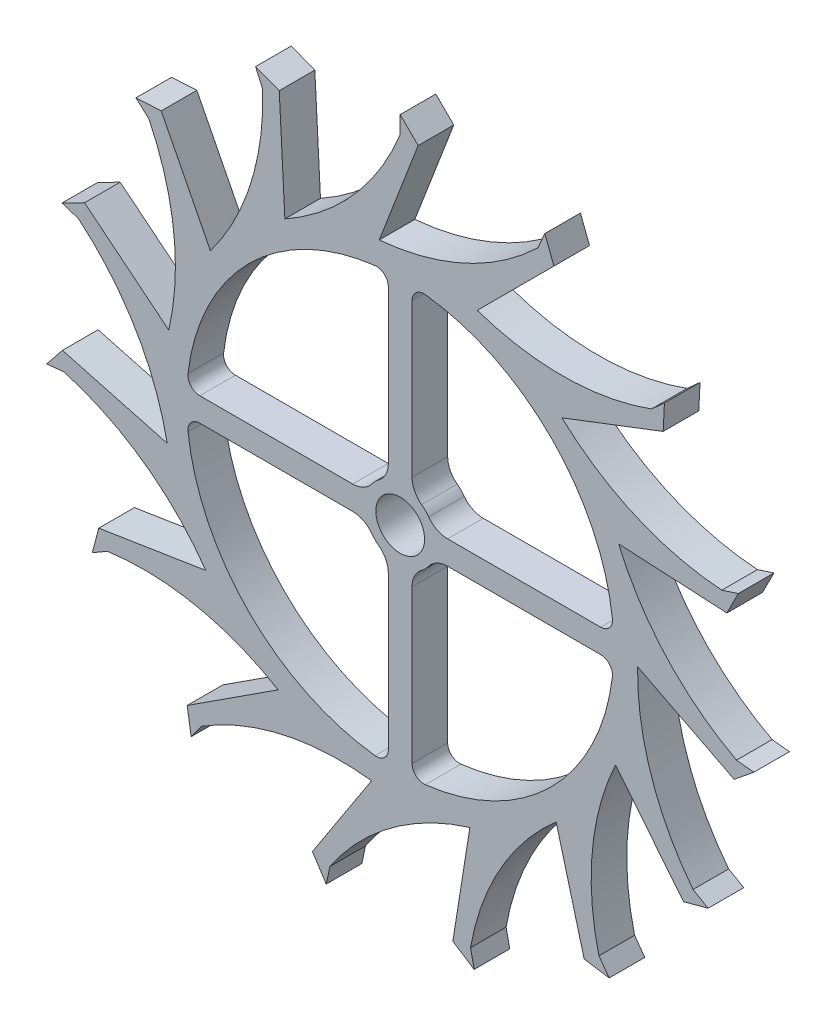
ISO-10303-21;
HEADER;
FILE_DESCRIPTION(('STEP AP214'),'2;1');
FILE_NAME('part.step','',(''),(''),'','','');
FILE_SCHEMA(('AUTOMOTIVE_DESIGN { 1 0 10303 214 1 1 1 1 }'));
ENDSEC;
DATA;
#1=APPLICATION_CONTEXT('core data for automotive mechanical design processes');
#2=APPLICATION_PROTOCOL_DEFINITION('international standard','automotive_design',2000,#1);
#3=PRODUCT_CONTEXT('',#1,'mechanical');
#4=PRODUCT('Part','Part','',(#3));
#5=PRODUCT_RELATED_PRODUCT_CATEGORY('part','',(#4));
#6=PRODUCT_DEFINITION_FORMATION('','',#4);
#7=PRODUCT_DEFINITION_CONTEXT('part definition',#1,'design');
#8=PRODUCT_DEFINITION('design','',#6,#7);
#9=PRODUCT_DEFINITION_SHAPE('','',#8);
#10=(LENGTH_UNIT() NAMED_UNIT(*) SI_UNIT(.MILLI.,.METRE.));
#11=(NAMED_UNIT(*) PLANE_ANGLE_UNIT() SI_UNIT($,.RADIAN.));
#12=(NAMED_UNIT(*) SI_UNIT($,.STERADIAN.) SOLID_ANGLE_UNIT());
#13=UNCERTAINTY_MEASURE_WITH_UNIT(LENGTH_MEASURE(1.E-05),#10,'distance_accuracy_value','');
#14=(GEOMETRIC_REPRESENTATION_CONTEXT(3) GLOBAL_UNCERTAINTY_ASSIGNED_CONTEXT((#13)) GLOBAL_UNIT_ASSIGNED_CONTEXT((#10,
#11,#12)) REPRESENTATION_CONTEXT('',''));
#15=CARTESIAN_POINT('',(0.,0.,0.));
#16=DIRECTION('',(0.,0.,1.));
#17=DIRECTION('',(1.,0.,0.));
#18=AXIS2_PLACEMENT_3D('',#15,#16,#17);
#19=CARTESIAN_POINT('',(3.78513411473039,9.90821677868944,0.));
#20=DIRECTION('',(-0.356865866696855,-0.934155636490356,0.));
#21=DIRECTION('',(0.934155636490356,-0.356865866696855,0.));
#22=AXIS2_PLACEMENT_3D('',#19,#20,#21);
#23=PLANE('',#22);
#24=DIRECTION('',(0.,0.,-1.));
#25=VECTOR('',#24,1.);
#26=CARTESIAN_POINT('',(-6.09126002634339,13.6811940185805,0.));
#27=LINE('',#26,#25);
#28=CARTESIAN_POINT('',(-6.09126002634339,13.6811940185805,1.5));
#29=VERTEX_POINT('',#28);
#30=CARTESIAN_POINT('',(-6.09126002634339,13.6811940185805,0.));
#31=VERTEX_POINT('',#30);
#32=EDGE_CURVE('E11',#29,#31,#27,.T.);
#33=ORIENTED_EDGE('',*,*,#32,.F.);
#34=DIRECTION('',(0.934155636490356,-0.356865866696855,0.));
#35=VECTOR('',#34,1.);
#36=CARTESIAN_POINT('',(3.78513411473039,9.90821677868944,1.5));
#37=LINE('',#36,#35);
#38=CARTESIAN_POINT('',(-5.0944749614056,13.3004024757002,1.5));
#39=VERTEX_POINT('',#38);
#40=EDGE_CURVE('E1322',#29,#39,#37,.T.);
#41=ORIENTED_EDGE('',*,*,#40,.T.);
#42=DIRECTION('',(0.,0.,1.));
#43=VECTOR('',#42,1.);
#44=CARTESIAN_POINT('',(-5.0944749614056,13.3004024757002,0.));
#45=LINE('',#44,#43);
#46=CARTESIAN_POINT('',(-5.0944749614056,13.3004024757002,0.));
#47=VERTEX_POINT('',#46);
#48=EDGE_CURVE('E1338',#47,#39,#45,.T.);
#49=ORIENTED_EDGE('',*,*,#48,.F.);
#50=DIRECTION('',(0.934155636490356,-0.356865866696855,0.));
#51=VECTOR('',#50,1.);
#52=CARTESIAN_POINT('',(3.78513411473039,9.90821677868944,0.));
#53=LINE('',#52,#51);
#54=EDGE_CURVE('E1327',#31,#47,#53,.T.);
#55=ORIENTED_EDGE('',*,*,#54,.F.);
#56=EDGE_LOOP('',(#33,#41,#49,#55));
#57=FACE_BOUND('',#56,.T.);
#58=ADVANCED_FACE('F36',(#57),#23,.F.);
#59=CARTESIAN_POINT('',(0.,0.,1.5));
#60=DIRECTION('',(0.,0.,1.));
#61=DIRECTION('',(1.,0.,0.));
#62=AXIS2_PLACEMENT_3D('',#59,#60,#61);
#63=PLANE('',#62);
#64=CARTESIAN_POINT('',(-1.49999999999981,-2.00000000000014,1.5));
#65=DIRECTION('',(0.,0.,1.));
#66=DIRECTION('',(-1.,0.,0.));
#67=AXIS2_PLACEMENT_3D('',#64,#65,#66);
#68=CIRCLE('',#67,1.);
#69=CARTESIAN_POINT('',(-0.49999999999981,-2.00000000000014,1.5));
#70=VERTEX_POINT('',#69);
#71=CARTESIAN_POINT('',(-0.899999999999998,-1.19999999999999,1.5));
#72=VERTEX_POINT('',#71);
#73=EDGE_CURVE('E51',#70,#72,#68,.T.);
#74=ORIENTED_EDGE('',*,*,#73,.F.);
#75=DIRECTION('',(0.,1.,0.));
#76=VECTOR('',#75,1.);
#77=CARTESIAN_POINT('',(-0.49999999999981,-2.00000000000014,1.5));
#78=LINE('',#77,#76);
#79=CARTESIAN_POINT('',(-0.499999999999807,-8.44097150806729,1.5));
#80=VERTEX_POINT('',#79);
#81=EDGE_CURVE('E810',#80,#70,#78,.T.);
#82=ORIENTED_EDGE('',*,*,#81,.F.);
#83=CARTESIAN_POINT('',(-0.999999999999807,-8.44097150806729,1.5));
#84=DIRECTION('',(0.,0.,1.));
#85=DIRECTION('',(-1.,0.,0.));
#86=AXIS2_PLACEMENT_3D('',#83,#84,#85);
#87=CIRCLE('',#86,0.5);
#88=CARTESIAN_POINT('',(-1.05882352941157,-8.93749924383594,1.5));
#89=VERTEX_POINT('',#88);
#90=EDGE_CURVE('E848',#89,#80,#87,.T.);
#91=ORIENTED_EDGE('',*,*,#90,.F.);
#92=CARTESIAN_POINT('',(0.,0.,1.5));
#93=DIRECTION('',(0.,0.,1.));
#94=DIRECTION('',(1.,0.,0.));
#95=AXIS2_PLACEMENT_3D('',#92,#93,#94);
#96=CIRCLE('',#95,9.0000000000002);
#97=CARTESIAN_POINT('',(-8.9374992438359,-1.05882352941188,1.5));
#98=VERTEX_POINT('',#97);
#99=EDGE_CURVE('E845',#98,#89,#96,.T.);
#100=ORIENTED_EDGE('',*,*,#99,.F.);
#101=CARTESIAN_POINT('',(-8.44097150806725,-1.00000000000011,1.5));
#102=DIRECTION('',(0.,0.,1.));
#103=DIRECTION('',(1.,0.,0.));
#104=AXIS2_PLACEMENT_3D('',#101,#102,#103);
#105=CIRCLE('',#104,0.500000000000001);
#106=CARTESIAN_POINT('',(-8.44097150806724,-0.500000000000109,1.5));
#107=VERTEX_POINT('',#106);
#108=EDGE_CURVE('E842',#107,#98,#105,.T.);
#109=ORIENTED_EDGE('',*,*,#108,.F.);
#110=DIRECTION('',(-1.,0.,0.));
#111=VECTOR('',#110,1.);
#112=CARTESIAN_POINT('',(-1.99999999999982,-0.500000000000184,1.5));
#113=LINE('',#112,#111);
#114=CARTESIAN_POINT('',(-1.99999999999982,-0.500000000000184,1.5));
#115=VERTEX_POINT('',#114);
#116=EDGE_CURVE('E839',#115,#107,#113,.T.);
#117=ORIENTED_EDGE('',*,*,#116,.F.);
#118=CARTESIAN_POINT('',(-1.99999999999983,-1.50000000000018,1.5));
#119=DIRECTION('',(0.,0.,1.));
#120=DIRECTION('',(1.,0.,0.));
#121=AXIS2_PLACEMENT_3D('',#118,#119,#120);
#122=CIRCLE('',#121,1.);
#123=CARTESIAN_POINT('',(-1.1999999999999,-0.900000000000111,1.5));
#124=VERTEX_POINT('',#123);
#125=EDGE_CURVE('E836',#124,#115,#122,.T.);
#126=ORIENTED_EDGE('',*,*,#125,.F.);
#127=CARTESIAN_POINT('',(0.,0.,1.5));
#128=DIRECTION('',(0.,0.,-1.));
#129=DIRECTION('',(1.,0.,0.));
#130=AXIS2_PLACEMENT_3D('',#127,#128,#129);
#131=CIRCLE('',#130,1.49999999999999);
#132=EDGE_CURVE('E833',#72,#124,#131,.T.);
#133=ORIENTED_EDGE('',*,*,#132,.F.);
#134=EDGE_LOOP('',(#74,#82,#91,#100,#109,#117,#126,#133));
#135=FACE_BOUND('',#134,.T.);
#136=CARTESIAN_POINT('',(2.00000000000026,-1.4999999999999,1.5));
#137=DIRECTION('',(0.,0.,1.));
#138=DIRECTION('',(1.,0.,0.));
#139=AXIS2_PLACEMENT_3D('',#136,#137,#138);
#140=CIRCLE('',#139,1.);
#141=CARTESIAN_POINT('',(2.00000000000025,-0.499999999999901,1.5));
#142=VERTEX_POINT('',#141);
#143=CARTESIAN_POINT('',(1.20000000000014,-0.899999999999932,1.5));
#144=VERTEX_POINT('',#143);
#145=EDGE_CURVE('E59',#142,#144,#140,.T.);
#146=ORIENTED_EDGE('',*,*,#145,.F.);
#147=DIRECTION('',(-1.,0.,0.));
#148=VECTOR('',#147,1.);
#149=CARTESIAN_POINT('',(2.00000000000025,-0.499999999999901,1.5));
#150=LINE('',#149,#148);
#151=CARTESIAN_POINT('',(8.44097150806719,-0.49999999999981,1.5));
#152=VERTEX_POINT('',#151);
#153=EDGE_CURVE('E748',#152,#142,#150,.T.);
#154=ORIENTED_EDGE('',*,*,#153,.F.);
#155=CARTESIAN_POINT('',(8.4409715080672,-0.999999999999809,1.5));
#156=DIRECTION('',(0.,0.,1.));
#157=DIRECTION('',(-1.,0.,0.));
#158=AXIS2_PLACEMENT_3D('',#155,#156,#157);
#159=CIRCLE('',#158,0.5);
#160=CARTESIAN_POINT('',(8.93749924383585,-1.05882352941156,1.5));
#161=VERTEX_POINT('',#160);
#162=EDGE_CURVE('E787',#161,#152,#159,.T.);
#163=ORIENTED_EDGE('',*,*,#162,.F.);
#164=CARTESIAN_POINT('',(0.,0.,1.5));
#165=DIRECTION('',(0.,0.,1.));
#166=DIRECTION('',(1.,0.,0.));
#167=AXIS2_PLACEMENT_3D('',#164,#165,#166);
#168=CIRCLE('',#167,9.00000000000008);
#169=CARTESIAN_POINT('',(1.05882352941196,-8.93749924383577,1.5));
#170=VERTEX_POINT('',#169);
#171=EDGE_CURVE('E784',#170,#161,#168,.T.);
#172=ORIENTED_EDGE('',*,*,#171,.F.);
#173=CARTESIAN_POINT('',(1.00000000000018,-8.4409715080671,1.5));
#174=DIRECTION('',(0.,0.,1.));
#175=DIRECTION('',(1.,0.,0.));
#176=AXIS2_PLACEMENT_3D('',#173,#174,#175);
#177=CIRCLE('',#176,0.5);
#178=CARTESIAN_POINT('',(0.500000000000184,-8.4409715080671,1.5));
#179=VERTEX_POINT('',#178);
#180=EDGE_CURVE('E781',#179,#170,#177,.T.);
#181=ORIENTED_EDGE('',*,*,#180,.F.);
#182=DIRECTION('',(0.,-1.,0.));
#183=VECTOR('',#182,1.);
#184=CARTESIAN_POINT('',(0.500000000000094,-1.99999999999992,1.5));
#185=LINE('',#184,#183);
#186=CARTESIAN_POINT('',(0.500000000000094,-1.99999999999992,1.5));
#187=VERTEX_POINT('',#186);
#188=EDGE_CURVE('E778',#187,#179,#185,.T.);
#189=ORIENTED_EDGE('',*,*,#188,.F.);
#190=CARTESIAN_POINT('',(1.50000000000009,-1.99999999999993,1.5));
#191=DIRECTION('',(0.,0.,1.));
#192=DIRECTION('',(1.,0.,0.));
#193=AXIS2_PLACEMENT_3D('',#190,#191,#192);
#194=CIRCLE('',#193,1.);
#195=CARTESIAN_POINT('',(0.900000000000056,-1.19999999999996,1.5));
#196=VERTEX_POINT('',#195);
#197=EDGE_CURVE('E775',#196,#187,#194,.T.);
#198=ORIENTED_EDGE('',*,*,#197,.F.);
#199=CARTESIAN_POINT('',(0.,0.,1.5));
#200=DIRECTION('',(0.,0.,-1.));
#201=DIRECTION('',(1.,0.,0.));
#202=AXIS2_PLACEMENT_3D('',#199,#200,#201);
#203=CIRCLE('',#202,1.50000000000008);
#204=EDGE_CURVE('E771',#144,#196,#203,.T.);
#205=ORIENTED_EDGE('',*,*,#204,.F.);
#206=EDGE_LOOP('',(#146,#154,#163,#172,#181,#189,#198,#205));
#207=FACE_BOUND('',#206,.T.);
#208=CARTESIAN_POINT('',(1.4999999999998,2.00000000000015,1.5));
#209=DIRECTION('',(0.,0.,1.));
#210=DIRECTION('',(-1.,0.,0.));
#211=AXIS2_PLACEMENT_3D('',#208,#209,#210);
#212=CIRCLE('',#211,1.);
#213=CARTESIAN_POINT('',(0.499999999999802,2.00000000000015,1.5));
#214=VERTEX_POINT('',#213);
#215=CARTESIAN_POINT('',(0.899999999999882,1.20000000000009,1.5));
#216=VERTEX_POINT('',#215);
#217=EDGE_CURVE('E706',#214,#216,#212,.T.);
#218=ORIENTED_EDGE('',*,*,#217,.F.);
#219=DIRECTION('',(0.,-1.,0.));
#220=VECTOR('',#219,1.);
#221=CARTESIAN_POINT('',(0.499999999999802,2.00000000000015,1.5));
#222=LINE('',#221,#220);
#223=CARTESIAN_POINT('',(0.499999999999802,8.4409715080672,1.5));
#224=VERTEX_POINT('',#223);
#225=EDGE_CURVE('E684',#224,#214,#222,.T.);
#226=ORIENTED_EDGE('',*,*,#225,.F.);
#227=CARTESIAN_POINT('',(0.999999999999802,8.4409715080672,1.5));
#228=DIRECTION('',(0.,0.,1.));
#229=DIRECTION('',(-1.,0.,0.));
#230=AXIS2_PLACEMENT_3D('',#227,#228,#229);
#231=CIRCLE('',#230,0.5);
#232=CARTESIAN_POINT('',(1.05882352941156,8.9374992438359,1.5));
#233=VERTEX_POINT('',#232);
#234=EDGE_CURVE('E724',#233,#224,#231,.T.);
#235=ORIENTED_EDGE('',*,*,#234,.F.);
#236=CARTESIAN_POINT('',(0.,0.,1.5));
#237=DIRECTION('',(0.,0.,1.));
#238=DIRECTION('',(1.,0.,0.));
#239=AXIS2_PLACEMENT_3D('',#236,#237,#238);
#240=CIRCLE('',#239,9.00000000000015);
#241=CARTESIAN_POINT('',(8.9374992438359,1.05882352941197,1.5));
#242=VERTEX_POINT('',#241);
#243=EDGE_CURVE('E721',#242,#233,#240,.T.);
#244=ORIENTED_EDGE('',*,*,#243,.F.);
#245=CARTESIAN_POINT('',(8.44097150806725,1.00000000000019,1.5));
#246=DIRECTION('',(0.,0.,1.));
#247=DIRECTION('',(1.,0.,0.));
#248=AXIS2_PLACEMENT_3D('',#245,#246,#247);
#249=CIRCLE('',#248,0.5);
#250=CARTESIAN_POINT('',(8.44097150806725,0.500000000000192,1.5));
#251=VERTEX_POINT('',#250);
#252=EDGE_CURVE('E718',#251,#242,#249,.T.);
#253=ORIENTED_EDGE('',*,*,#252,.F.);
#254=DIRECTION('',(1.,0.,0.));
#255=VECTOR('',#254,1.);
#256=CARTESIAN_POINT('',(1.99999999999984,0.50000000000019,1.5));
#257=LINE('',#256,#255);
#258=CARTESIAN_POINT('',(1.99999999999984,0.500000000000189,1.5));
#259=VERTEX_POINT('',#258);
#260=EDGE_CURVE('E715',#259,#251,#257,.T.);
#261=ORIENTED_EDGE('',*,*,#260,.F.);
#262=CARTESIAN_POINT('',(1.99999999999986,1.50000000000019,1.5));
#263=DIRECTION('',(0.,0.,1.));
#264=DIRECTION('',(1.,0.,0.));
#265=AXIS2_PLACEMENT_3D('',#262,#263,#264);
#266=CIRCLE('',#265,1.);
#267=CARTESIAN_POINT('',(1.19999999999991,0.900000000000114,1.5));
#268=VERTEX_POINT('',#267);
#269=EDGE_CURVE('E712',#268,#259,#266,.T.);
#270=ORIENTED_EDGE('',*,*,#269,.F.);
#271=CARTESIAN_POINT('',(0.,0.,1.5));
#272=DIRECTION('',(0.,0.,-1.));
#273=DIRECTION('',(1.,0.,0.));
#274=AXIS2_PLACEMENT_3D('',#271,#272,#273);
#275=CIRCLE('',#274,1.5);
#276=EDGE_CURVE('E708',#216,#268,#275,.T.);
#277=ORIENTED_EDGE('',*,*,#276,.F.);
#278=EDGE_LOOP('',(#218,#226,#235,#244,#253,#261,#270,#277));
#279=FACE_BOUND('',#278,.T.);
#280=CARTESIAN_POINT('',(-1.99999999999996,1.49999999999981,1.5));
#281=DIRECTION('',(0.,0.,1.));
#282=DIRECTION('',(1.,0.,0.));
#283=AXIS2_PLACEMENT_3D('',#280,#281,#282);
#284=CIRCLE('',#283,1.);
#285=CARTESIAN_POINT('',(-1.99999999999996,0.499999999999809,1.5));
#286=VERTEX_POINT('',#285);
#287=CARTESIAN_POINT('',(-1.19999999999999,0.899999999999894,1.5));
#288=VERTEX_POINT('',#287);
#289=EDGE_CURVE('E611',#286,#288,#284,.T.);
#290=ORIENTED_EDGE('',*,*,#289,.F.);
#291=DIRECTION('',(1.,0.,0.));
#292=VECTOR('',#291,1.);
#293=CARTESIAN_POINT('',(-1.99999999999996,0.499999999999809,1.5));
#294=LINE('',#293,#292);
#295=CARTESIAN_POINT('',(-8.4409715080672,0.499999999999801,1.5));
#296=VERTEX_POINT('',#295);
#297=EDGE_CURVE('E629',#296,#286,#294,.T.);
#298=ORIENTED_EDGE('',*,*,#297,.F.);
#299=CARTESIAN_POINT('',(-8.4409715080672,0.999999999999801,1.5));
#300=DIRECTION('',(0.,0.,1.));
#301=DIRECTION('',(-1.,0.,0.));
#302=AXIS2_PLACEMENT_3D('',#299,#300,#301);
#303=CIRCLE('',#302,0.500000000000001);
#304=CARTESIAN_POINT('',(-8.93749924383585,1.05882352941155,1.5));
#305=VERTEX_POINT('',#304);
#306=EDGE_CURVE('E632',#305,#296,#303,.T.);
#307=ORIENTED_EDGE('',*,*,#306,.F.);
#308=CARTESIAN_POINT('',(0.,0.,1.5));
#309=DIRECTION('',(0.,0.,1.));
#310=DIRECTION('',(1.,0.,0.));
#311=AXIS2_PLACEMENT_3D('',#308,#309,#310);
#312=CIRCLE('',#311,9.00000000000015);
#313=CARTESIAN_POINT('',(-1.05882352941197,8.93749924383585,1.5));
#314=VERTEX_POINT('',#313);
#315=EDGE_CURVE('E661',#314,#305,#312,.T.);
#316=ORIENTED_EDGE('',*,*,#315,.F.);
#317=CARTESIAN_POINT('',(-1.0000000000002,8.44097150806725,1.5));
#318=DIRECTION('',(0.,0.,1.));
#319=DIRECTION('',(1.,0.,0.));
#320=AXIS2_PLACEMENT_3D('',#317,#318,#319);
#321=CIRCLE('',#320,0.499999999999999);
#322=CARTESIAN_POINT('',(-0.500000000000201,8.44097150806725,1.5));
#323=VERTEX_POINT('',#322);
#324=EDGE_CURVE('E658',#323,#314,#321,.T.);
#325=ORIENTED_EDGE('',*,*,#324,.F.);
#326=DIRECTION('',(0.,1.,0.));
#327=VECTOR('',#326,1.);
#328=CARTESIAN_POINT('',(-0.500000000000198,1.99999999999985,1.5));
#329=LINE('',#328,#327);
#330=CARTESIAN_POINT('',(-0.500000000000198,1.99999999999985,1.5));
#331=VERTEX_POINT('',#330);
#332=EDGE_CURVE('E655',#331,#323,#329,.T.);
#333=ORIENTED_EDGE('',*,*,#332,.F.);
#334=CARTESIAN_POINT('',(-1.5000000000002,1.99999999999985,1.5));
#335=DIRECTION('',(0.,0.,1.));
#336=DIRECTION('',(1.,0.,0.));
#337=AXIS2_PLACEMENT_3D('',#334,#335,#336);
#338=CIRCLE('',#337,1.);
#339=CARTESIAN_POINT('',(-0.900000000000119,1.19999999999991,1.5));
#340=VERTEX_POINT('',#339);
#341=EDGE_CURVE('E652',#340,#331,#338,.T.);
#342=ORIENTED_EDGE('',*,*,#341,.F.);
#343=CARTESIAN_POINT('',(0.,0.,1.5));
#344=DIRECTION('',(0.,0.,-1.));
#345=DIRECTION('',(1.,0.,0.));
#346=AXIS2_PLACEMENT_3D('',#343,#344,#345);
#347=CIRCLE('',#346,1.49999999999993);
#348=EDGE_CURVE('E649',#288,#340,#347,.T.);
#349=ORIENTED_EDGE('',*,*,#348,.F.);
#350=EDGE_LOOP('',(#290,#298,#307,#316,#325,#333,#342,#349));
#351=FACE_BOUND('',#350,.T.);
#352=CARTESIAN_POINT('',(0.,0.,1.5));
#353=DIRECTION('',(0.,0.,1.));
#354=DIRECTION('',(1.,0.,0.));
#355=AXIS2_PLACEMENT_3D('',#352,#353,#354);
#356=CIRCLE('',#355,1.02634427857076);
#357=CARTESIAN_POINT('',(1.02634427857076,0.,1.5));
#358=VERTEX_POINT('',#357);
#359=EDGE_CURVE('E668',#358,#358,#356,.T.);
#360=ORIENTED_EDGE('',*,*,#359,.F.);
#361=EDGE_LOOP('',(#360));
#362=FACE_BOUND('',#361,.T.);
#363=DIRECTION('',(0.708243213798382,-0.705968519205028,0.));
#364=VECTOR('',#363,1.);
#365=CARTESIAN_POINT('',(7.48792690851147,7.51205368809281,1.5));
#366=LINE('',#365,#364);
#367=CARTESIAN_POINT('',(0.,14.9759313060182,1.5));
#368=VERTEX_POINT('',#367);
#369=CARTESIAN_POINT('',(0.755726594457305,14.2226319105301,1.5));
#370=VERTEX_POINT('',#369);
#371=EDGE_CURVE('E1293',#368,#370,#366,.T.);
#372=ORIENTED_EDGE('',*,*,#371,.F.);
#373=DIRECTION('',(0.,-1.,0.));
#374=VECTOR('',#373,1.);
#375=CARTESIAN_POINT('',(0.,0.,1.5));
#376=LINE('',#375,#374);
#377=CARTESIAN_POINT('',(0.,14.2426957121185,1.5));
#378=VERTEX_POINT('',#377);
#379=EDGE_CURVE('E1335',#368,#378,#376,.T.);
#380=ORIENTED_EDGE('',*,*,#379,.T.);
#381=CARTESIAN_POINT('',(-10.1996637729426,18.3528235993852,1.5));
#382=DIRECTION('',(0.,0.,1.));
#383=DIRECTION('',(1.,0.,0.));
#384=AXIS2_PLACEMENT_3D('',#381,#382,#383);
#385=CIRCLE('',#384,10.9966491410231);
#386=CARTESIAN_POINT('',(-4.85775787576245,8.74083453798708,1.5));
#387=VERTEX_POINT('',#386);
#388=EDGE_CURVE('E1332',#387,#378,#385,.T.);
#389=ORIENTED_EDGE('',*,*,#388,.F.);
#390=DIRECTION('',(0.0518467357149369,-0.998655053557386,0.));
#391=VECTOR('',#390,1.);
#392=CARTESIAN_POINT('',(-4.39212558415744,-0.228024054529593,1.5));
#393=LINE('',#392,#391);
#394=EDGE_CURVE('E1314',#39,#387,#393,.T.);
#395=ORIENTED_EDGE('',*,*,#394,.F.);
#396=ORIENTED_EDGE('',*,*,#40,.F.);
#397=DIRECTION('',(0.406736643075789,-0.913545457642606,0.));
#398=VECTOR('',#397,1.);
#399=CARTESIAN_POINT('',(0.,0.,1.5));
#400=LINE('',#399,#398);
#401=CARTESIAN_POINT('',(-5.79302624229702,13.0113499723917,1.5));
#402=VERTEX_POINT('',#401);
#403=EDGE_CURVE('E891',#29,#402,#400,.T.);
#404=ORIENTED_EDGE('',*,*,#403,.T.);
#405=CARTESIAN_POINT('',(-16.7826223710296,12.617561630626,1.5));
#406=DIRECTION('',(0.,0.,1.));
#407=DIRECTION('',(0.913545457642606,0.406736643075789,0.));
#408=AXIS2_PLACEMENT_3D('',#405,#406,#407);
#409=CIRCLE('',#408,10.9966491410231);
#410=CARTESIAN_POINT('',(-7.99300033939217,6.00932155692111,1.5));
#411=VERTEX_POINT('',#410);
#412=EDGE_CURVE('E888',#411,#402,#409,.T.);
#413=ORIENTED_EDGE('',*,*,#412,.F.);
#414=DIRECTION('',(0.453553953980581,-0.891228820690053,0.));
#415=VECTOR('',#414,1.);
#416=CARTESIAN_POINT('',(-3.91966063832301,-1.99474875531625,1.5));
#417=LINE('',#416,#415);
#418=CARTESIAN_POINT('',(-10.0637955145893,10.0784126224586,1.5));
#419=VERTEX_POINT('',#418);
#420=EDGE_CURVE('E870',#419,#411,#417,.T.);
#421=ORIENTED_EDGE('',*,*,#420,.F.);
#422=DIRECTION('',(0.998544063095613,0.0539421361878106,0.));
#423=VECTOR('',#422,1.);
#424=CARTESIAN_POINT('',(-0.572142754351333,10.5911591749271,1.5));
#425=LINE('',#424,#423);
#426=CARTESIAN_POINT('',(-11.1292858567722,10.0208539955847,1.5));
#427=VERTEX_POINT('',#426);
#428=EDGE_CURVE('E877',#427,#419,#425,.T.);
#429=ORIENTED_EDGE('',*,*,#428,.F.);
#430=DIRECTION('',(0.743144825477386,-0.669130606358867,0.));
#431=VECTOR('',#430,1.);
#432=CARTESIAN_POINT('',(0.,0.,1.5));
#433=LINE('',#432,#431);
#434=CARTESIAN_POINT('',(-10.5843856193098,9.53022361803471,1.5));
#435=VERTEX_POINT('',#434);
#436=EDGE_CURVE('E920',#427,#435,#433,.T.);
#437=ORIENTED_EDGE('',*,*,#436,.T.);
#438=CARTESIAN_POINT('',(-20.463713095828,4.70060862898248,1.5));
#439=DIRECTION('',(0.,0.,1.));
#440=DIRECTION('',(0.669130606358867,0.743144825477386,0.));
#441=AXIS2_PLACEMENT_3D('',#438,#439,#440);
#442=CIRCLE('',#441,10.9966491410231);
#443=CARTESIAN_POINT('',(-9.74618043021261,2.23874228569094,1.5));
#444=VERTEX_POINT('',#443);
#445=EDGE_CURVE('E917',#444,#435,#442,.T.);
#446=ORIENTED_EDGE('',*,*,#445,.F.);
#447=DIRECTION('',(0.776837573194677,-0.629701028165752,0.));
#448=VECTOR('',#447,1.);
#449=CARTESIAN_POINT('',(-2.76945075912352,-3.41656327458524,1.5));
#450=LINE('',#449,#448);
#451=CARTESIAN_POINT('',(-13.2929943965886,5.11377366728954,1.5));
#452=VERTEX_POINT('',#451);
#453=EDGE_CURVE('E898',#452,#444,#450,.T.);
#454=ORIENTED_EDGE('',*,*,#453,.F.);
#455=DIRECTION('',(0.890275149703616,0.455423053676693,0.));
#456=VECTOR('',#455,1.);
#457=CARTESIAN_POINT('',(-4.8304909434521,9.44279393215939,1.5));
#458=LINE('',#457,#456);
#459=CARTESIAN_POINT('',(-14.2429570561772,4.62781728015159,1.5));
#460=VERTEX_POINT('',#459);
#461=EDGE_CURVE('E906',#460,#452,#458,.T.);
#462=ORIENTED_EDGE('',*,*,#461,.F.);
#463=DIRECTION('',(0.95105651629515,-0.309016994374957,0.));
#464=VECTOR('',#463,1.);
#465=CARTESIAN_POINT('',(0.,0.,1.5));
#466=LINE('',#465,#464);
#467=CARTESIAN_POINT('',(-13.5456085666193,4.40123502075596,1.5));
#468=VERTEX_POINT('',#467);
#469=EDGE_CURVE('E952',#460,#468,#466,.T.);
#470=ORIENTED_EDGE('',*,*,#469,.T.);
#471=CARTESIAN_POINT('',(-20.6064419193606,-4.02912230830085,1.5));
#472=DIRECTION('',(0.,0.,1.));
#473=DIRECTION('',(0.309016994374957,0.95105651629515,0.));
#474=AXIS2_PLACEMENT_3D('',#471,#472,#473);
#475=CIRCLE('',#474,10.9966491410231);
#476=CARTESIAN_POINT('',(-9.81415738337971,-1.91893586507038,1.5));
#477=VERTEX_POINT('',#476);
#478=EDGE_CURVE('E949',#477,#468,#475,.T.);
#479=ORIENTED_EDGE('',*,*,#478,.F.);
#480=DIRECTION('',(0.965798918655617,-0.259292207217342,0.));
#481=VECTOR('',#480,1.);
#482=CARTESIAN_POINT('',(-1.14037768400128,-4.2476229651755,1.5));
#483=LINE('',#482,#481);
#484=CARTESIAN_POINT('',(-14.2237137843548,-0.735083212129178,1.5));
#485=VERTEX_POINT('',#484);
#486=EDGE_CURVE('E933',#485,#477,#483,.T.);
#487=ORIENTED_EDGE('',*,*,#486,.F.);
#488=DIRECTION('',(0.628069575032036,0.778157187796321,0.));
#489=VECTOR('',#488,1.);
#490=CARTESIAN_POINT('',(-8.25360336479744,6.66168383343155,1.5));
#491=LINE('',#490,#489);
#492=CARTESIAN_POINT('',(-14.8938915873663,-1.56541108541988,1.5));
#493=VERTEX_POINT('',#492);
#494=EDGE_CURVE('E938',#493,#485,#491,.T.);
#495=ORIENTED_EDGE('',*,*,#494,.F.);
#496=DIRECTION('',(0.994521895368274,0.104528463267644,0.));
#497=VECTOR('',#496,1.);
#498=CARTESIAN_POINT('',(0.,0.,1.5));
#499=LINE('',#498,#497);
#500=CARTESIAN_POINT('',(-14.1646727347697,-1.48876709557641,1.5));
#501=VERTEX_POINT('',#500);
#502=EDGE_CURVE('E981',#493,#501,#499,.T.);
#503=ORIENTED_EDGE('',*,*,#502,.T.);
#504=CARTESIAN_POINT('',(-17.1861297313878,-12.0621813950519,1.5));
#505=DIRECTION('',(0.,0.,1.));
#506=DIRECTION('',(-0.104528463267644,0.994521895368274,0.));
#507=AXIS2_PLACEMENT_3D('',#504,#505,#506);
#508=CIRCLE('',#507,10.9966491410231);
#509=CARTESIAN_POINT('',(-8.18517736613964,-5.74481257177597,1.5));
#510=VERTEX_POINT('',#509);
#511=EDGE_CURVE('E978',#510,#501,#508,.T.);
#512=ORIENTED_EDGE('',*,*,#511,.F.);
#513=DIRECTION('',(0.987764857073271,0.155950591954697,0.));
#514=VECTOR('',#513,1.);
#515=CARTESIAN_POINT('',(0.685877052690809,-4.34423005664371,1.5));
#516=LINE('',#515,#514);
#517=CARTESIAN_POINT('',(-12.695023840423,-6.45683752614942,1.5));
#518=VERTEX_POINT('',#517);
#519=EDGE_CURVE('E959',#518,#510,#516,.T.);
#520=ORIENTED_EDGE('',*,*,#519,.F.);
#521=DIRECTION('',(0.257265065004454,0.966340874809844,0.));
#522=VECTOR('',#521,1.);
#523=CARTESIAN_POINT('',(-10.2495927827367,2.72870808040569,1.5));
#524=LINE('',#523,#522);
#525=CARTESIAN_POINT('',(-12.9695369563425,-7.487965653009,1.5));
#526=VERTEX_POINT('',#525);
#527=EDGE_CURVE('E967',#526,#518,#524,.T.);
#528=ORIENTED_EDGE('',*,*,#527,.F.);
#529=DIRECTION('',(0.866025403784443,0.499999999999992,0.));
#530=VECTOR('',#529,1.);
#531=CARTESIAN_POINT('',(0.,0.,1.5));
#532=LINE('',#531,#530);
#533=CARTESIAN_POINT('',(-12.3345363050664,-7.12134785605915,1.5));
#534=VERTEX_POINT('',#533);
#535=EDGE_CURVE('E1013',#526,#534,#532,.T.);
#536=ORIENTED_EDGE('',*,*,#535,.T.);
#537=CARTESIAN_POINT('',(-10.794179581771,-18.0095797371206,1.5));
#538=DIRECTION('',(0.,0.,1.));
#539=DIRECTION('',(-0.499999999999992,0.866025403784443,0.));
#540=AXIS2_PLACEMENT_3D('',#537,#538,#539);
#541=CIRCLE('',#540,10.9966491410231);
#542=CARTESIAN_POINT('',(-5.14090582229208,-8.57735899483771,1.5));
#543=VERTEX_POINT('',#542);
#544=EDGE_CURVE('E1010',#543,#534,#541,.T.);
#545=ORIENTED_EDGE('',*,*,#544,.F.);
#546=DIRECTION('',(0.838937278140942,0.544228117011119,0.));
#547=VECTOR('',#546,1.);
#548=CARTESIAN_POINT('',(2.39353741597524,-3.68968030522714,1.5));
#549=LINE('',#548,#547);
#550=CARTESIAN_POINT('',(-8.97124894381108,-11.062145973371,1.5));
#551=VERTEX_POINT('',#550);
#552=EDGE_CURVE('E994',#551,#543,#549,.T.);
#553=ORIENTED_EDGE('',*,*,#552,.F.);
#554=DIRECTION('',(-0.158022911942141,0.987435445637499,0.));
#555=VECTOR('',#554,1.);
#556=CARTESIAN_POINT('',(-10.4733344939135,-1.67608608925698,1.5));
#557=LINE('',#556,#555);
#558=CARTESIAN_POINT('',(-8.80263156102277,-12.1157829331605,1.5));
#559=VERTEX_POINT('',#558);
#560=EDGE_CURVE('E999',#559,#551,#557,.T.);
#561=ORIENTED_EDGE('',*,*,#560,.F.);
#562=DIRECTION('',(0.58778525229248,0.809016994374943,0.));
#563=VECTOR('',#562,1.);
#564=CARTESIAN_POINT('',(0.,0.,1.5));
#565=LINE('',#564,#563);
#566=CARTESIAN_POINT('',(-8.37164649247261,-11.522582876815,1.5));
#567=VERTEX_POINT('',#566);
#568=EDGE_CURVE('E1048',#559,#567,#565,.T.);
#569=ORIENTED_EDGE('',*,*,#568,.T.);
#570=CARTESIAN_POINT('',(-2.53581772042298,-20.8429581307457,1.5));
#571=DIRECTION('',(0.,0.,1.));
#572=DIRECTION('',(-0.809016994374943,0.58778525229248,0.));
#573=AXIS2_PLACEMENT_3D('',#570,#571,#572);
#574=CIRCLE('',#573,10.9966491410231);
#575=CARTESIAN_POINT('',(-1.20772495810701,-9.92680212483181,1.5));
#576=VERTEX_POINT('',#575);
#577=EDGE_CURVE('E1045',#576,#567,#574,.T.);
#578=ORIENTED_EDGE('',*,*,#577,.F.);
#579=DIRECTION('',(0.545049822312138,0.838403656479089,0.));
#580=VECTOR('',#579,1.);
#581=CARTESIAN_POINT('',(3.68733341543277,-2.39715130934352,1.5));
#582=LINE('',#581,#580);
#583=CARTESIAN_POINT('',(-3.69626360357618,-13.7547088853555,1.5));
#584=VERTEX_POINT('',#583);
#585=EDGE_CURVE('E1029',#584,#576,#582,.T.);
#586=ORIENTED_EDGE('',*,*,#585,.F.);
#587=DIRECTION('',(-0.545987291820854,0.837793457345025,0.));
#588=VECTOR('',#587,1.);
#589=CARTESIAN_POINT('',(-8.88614152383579,-5.79106974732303,1.5));
#590=LINE('',#589,#588);
#591=CARTESIAN_POINT('',(-3.11367119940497,-14.648671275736,1.5));
#592=VERTEX_POINT('',#591);
#593=EDGE_CURVE('E1034',#592,#584,#590,.T.);
#594=ORIENTED_EDGE('',*,*,#593,.F.);
#595=DIRECTION('',(0.207911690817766,0.978147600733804,0.));
#596=VECTOR('',#595,1.);
#597=CARTESIAN_POINT('',(0.,0.,1.5));
#598=LINE('',#597,#596);
#599=CARTESIAN_POINT('',(-2.96122294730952,-13.9314586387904,1.5));
#600=VERTEX_POINT('',#599);
#601=EDGE_CURVE('E1080',#592,#600,#598,.T.);
#602=ORIENTED_EDGE('',*,*,#601,.T.);
#603=CARTESIAN_POINT('',(6.16101006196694,-20.0723997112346,1.5));
#604=DIRECTION('',(0.,0.,1.));
#605=DIRECTION('',(-0.978147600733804,0.207911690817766,0.));
#606=AXIS2_PLACEMENT_3D('',#603,#604,#605);
#607=CIRCLE('',#606,10.9966491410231);
#608=CARTESIAN_POINT('',(2.93428252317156,-9.55981098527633,1.5));
#609=VERTEX_POINT('',#608);
#610=EDGE_CURVE('E1077',#609,#600,#607,.T.);
#611=ORIENTED_EDGE('',*,*,#610,.F.);
#612=DIRECTION('',(0.156918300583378,0.98761158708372,0.));
#613=VECTOR('',#612,1.);
#614=CARTESIAN_POINT('',(4.34355596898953,-0.690133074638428,1.5));
#615=LINE('',#614,#613);
#616=CARTESIAN_POINT('',(2.2178392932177,-14.0689576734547,1.5));
#617=VERTEX_POINT('',#616);
#618=EDGE_CURVE('E1061',#617,#609,#615,.T.);
#619=ORIENTED_EDGE('',*,*,#618,.F.);
#620=DIRECTION('',(-0.839545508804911,0.543289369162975,0.));
#621=VECTOR('',#620,1.);
#622=CARTESIAN_POINT('',(-5.76245395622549,-8.90472483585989,1.5));
#623=LINE('',#622,#621);
#624=CARTESIAN_POINT('',(3.11367119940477,-14.648671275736,1.5));
#625=VERTEX_POINT('',#624);
#626=EDGE_CURVE('E1066',#625,#617,#623,.T.);
#627=ORIENTED_EDGE('',*,*,#626,.F.);
#628=DIRECTION('',(-0.207911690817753,0.978147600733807,0.));
#629=VECTOR('',#628,1.);
#630=CARTESIAN_POINT('',(0.,0.,1.5));
#631=LINE('',#630,#629);
#632=CARTESIAN_POINT('',(2.96122294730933,-13.9314586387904,1.5));
#633=VERTEX_POINT('',#632);
#634=EDGE_CURVE('E1109',#625,#633,#631,.T.);
#635=ORIENTED_EDGE('',*,*,#634,.T.);
#636=CARTESIAN_POINT('',(13.7925432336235,-15.8311410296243,1.5));
#637=DIRECTION('',(0.,0.,1.));
#638=DIRECTION('',(-0.978147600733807,-0.207911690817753,0.));
#639=AXIS2_PLACEMENT_3D('',#636,#637,#638);
#640=CIRCLE('',#639,10.9966491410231);
#641=CARTESIAN_POINT('',(6.56892589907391,-7.53984167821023,1.5));
#642=VERTEX_POINT('',#641);
#643=EDGE_CURVE('E1106',#642,#633,#640,.T.);
#644=ORIENTED_EDGE('',*,*,#643,.F.);
#645=DIRECTION('',(-0.258345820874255,0.966052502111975,0.));
#646=VECTOR('',#645,1.);
#647=CARTESIAN_POINT('',(4.2487382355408,1.1362154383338,1.5));
#648=LINE('',#647,#646);
#649=CARTESIAN_POINT('',(7.7484576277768,-11.9505558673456,1.5));
#650=VERTEX_POINT('',#649);
#651=EDGE_CURVE('E1087',#650,#642,#648,.T.);
#652=ORIENTED_EDGE('',*,*,#651,.F.);
#653=DIRECTION('',(-0.98793868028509,0.154845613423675,0.));
#654=VECTOR('',#653,1.);
#655=CARTESIAN_POINT('',(-1.64238574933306,-10.4786721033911,1.5));
#656=LINE('',#655,#654);
#657=CARTESIAN_POINT('',(8.80263156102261,-12.1157829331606,1.5));
#658=VERTEX_POINT('',#657);
#659=EDGE_CURVE('E1095',#658,#650,#656,.T.);
#660=ORIENTED_EDGE('',*,*,#659,.F.);
#661=DIRECTION('',(-0.587785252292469,0.80901699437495,0.));
#662=VECTOR('',#661,1.);
#663=CARTESIAN_POINT('',(0.,0.,1.5));
#664=LINE('',#663,#662);
#665=CARTESIAN_POINT('',(8.37164649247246,-11.5225828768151,1.5));
#666=VERTEX_POINT('',#665);
#667=EDGE_CURVE('E1141',#658,#666,#664,.T.);
#668=ORIENTED_EDGE('',*,*,#667,.T.);
#669=CARTESIAN_POINT('',(19.0392203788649,-8.85253424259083,1.5));
#670=DIRECTION('',(0.,0.,1.));
#671=DIRECTION('',(-0.80901699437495,-0.587785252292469,0.));
#672=AXIS2_PLACEMENT_3D('',#669,#670,#671);
#673=CIRCLE('',#672,10.9966491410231);
#674=CARTESIAN_POINT('',(9.06774231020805,-4.2161652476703,1.5));
#675=VERTEX_POINT('',#674);
#676=EDGE_CURVE('E1138',#675,#666,#673,.T.);
#677=ORIENTED_EDGE('',*,*,#676,.F.);
#678=DIRECTION('',(-0.628939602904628,0.777454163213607,0.));
#679=VECTOR('',#678,1.);
#680=CARTESIAN_POINT('',(3.41927506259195,2.76610197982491,1.5));
#681=LINE('',#680,#679);
#682=CARTESIAN_POINT('',(11.9392972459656,-7.76579438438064,1.5));
#683=VERTEX_POINT('',#682);
#684=EDGE_CURVE('E1122',#683,#675,#681,.T.);
#685=ORIENTED_EDGE('',*,*,#684,.F.);
#686=DIRECTION('',(-0.965508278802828,-0.260372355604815,0.));
#687=VECTOR('',#686,1.);
#688=CARTESIAN_POINT('',(2.76166587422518,-10.2407617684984,1.5));
#689=LINE('',#688,#687);
#690=CARTESIAN_POINT('',(12.9695369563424,-7.48796565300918,1.5));
#691=VERTEX_POINT('',#690);
#692=EDGE_CURVE('E1127',#691,#683,#689,.T.);
#693=ORIENTED_EDGE('',*,*,#692,.F.);
#694=DIRECTION('',(-0.866025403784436,0.500000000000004,0.));
#695=VECTOR('',#694,1.);
#696=CARTESIAN_POINT('',(0.,0.,1.5));
#697=LINE('',#696,#695);
#698=CARTESIAN_POINT('',(12.3345363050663,-7.12134785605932,1.5));
#699=VERTEX_POINT('',#698);
#700=EDGE_CURVE('E1173',#691,#699,#697,.T.);
#701=ORIENTED_EDGE('',*,*,#700,.T.);
#702=CARTESIAN_POINT('',(20.9938433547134,-0.343243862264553,1.5));
#703=DIRECTION('',(0.,0.,1.));
#704=DIRECTION('',(-0.500000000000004,-0.866025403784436,0.));
#705=AXIS2_PLACEMENT_3D('',#702,#703,#704);
#706=CIRCLE('',#705,10.9966491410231);
#707=CARTESIAN_POINT('',(9.99866369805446,-0.163475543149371,1.5));
#708=VERTEX_POINT('',#707);
#709=EDGE_CURVE('E1170',#708,#699,#706,.T.);
#710=ORIENTED_EDGE('',*,*,#709,.F.);
#711=DIRECTION('',(-0.890784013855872,0.454426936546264,0.));
#712=VECTOR('',#711,1.);
#713=CARTESIAN_POINT('',(1.99858816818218,3.9177043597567,1.5));
#714=LINE('',#713,#712);
#715=CARTESIAN_POINT('',(14.0657239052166,-2.23825650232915,1.5));
#716=VERTEX_POINT('',#715);
#717=EDGE_CURVE('E1154',#716,#708,#714,.T.);
#718=ORIENTED_EDGE('',*,*,#717,.F.);
#719=DIRECTION('',(-0.776132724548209,-0.630569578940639,0.));
#720=VECTOR('',#719,1.);
#721=CARTESIAN_POINT('',(6.68820037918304,-8.23213068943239,1.5));
#722=LINE('',#721,#720);
#723=CARTESIAN_POINT('',(14.8938915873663,-1.56541108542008,1.5));
#724=VERTEX_POINT('',#723);
#725=EDGE_CURVE('E1159',#724,#716,#722,.T.);
#726=ORIENTED_EDGE('',*,*,#725,.F.);
#727=DIRECTION('',(-0.994521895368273,0.104528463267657,0.));
#728=VECTOR('',#727,1.);
#729=CARTESIAN_POINT('',(0.,0.,1.5));
#730=LINE('',#729,#728);
#731=CARTESIAN_POINT('',(14.1646727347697,-1.4887670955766,1.5));
#732=VERTEX_POINT('',#731);
#733=EDGE_CURVE('E1205',#724,#732,#730,.T.);
#734=ORIENTED_EDGE('',*,*,#733,.T.);
#735=CARTESIAN_POINT('',(19.3184400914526,8.22539650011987,1.5));
#736=DIRECTION('',(0.,0.,1.));
#737=DIRECTION('',(-0.104528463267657,-0.994521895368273,0.));
#738=AXIS2_PLACEMENT_3D('',#735,#736,#737);
#739=CIRCLE('',#738,10.9966491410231);
#740=CARTESIAN_POINT('',(9.20072529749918,3.91748056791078,1.5));
#741=VERTEX_POINT('',#740);
#742=EDGE_CURVE('E1202',#741,#732,#739,.T.);
#743=ORIENTED_EDGE('',*,*,#742,.F.);
#744=DIRECTION('',(-0.998603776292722,0.0528251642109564,0.));
#745=VECTOR('',#744,1.);
#746=CARTESIAN_POINT('',(0.232327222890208,4.39190006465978,1.5));
#747=LINE('',#746,#745);
#748=CARTESIAN_POINT('',(13.7600591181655,3.67629626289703,1.5));
#749=VERTEX_POINT('',#748);
#750=EDGE_CURVE('E1186',#749,#741,#747,.T.);
#751=ORIENTED_EDGE('',*,*,#750,.F.);
#752=DIRECTION('',(-0.452556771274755,-0.891735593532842,0.));
#753=VECTOR('',#752,1.);
#754=CARTESIAN_POINT('',(9.4582842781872,-4.800089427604,1.5));
#755=LINE('',#754,#753);
#756=CARTESIAN_POINT('',(14.2429570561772,4.6278172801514,1.5));
#757=VERTEX_POINT('',#756);
#758=EDGE_CURVE('E1191',#757,#749,#755,.T.);
#759=ORIENTED_EDGE('',*,*,#758,.F.);
#760=DIRECTION('',(-0.951056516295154,-0.309016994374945,0.));
#761=VECTOR('',#760,1.);
#762=CARTESIAN_POINT('',(0.,0.,1.5));
#763=LINE('',#762,#761);
#764=CARTESIAN_POINT('',(13.5456085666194,4.40123502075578,1.5));
#765=VERTEX_POINT('',#764);
#766=EDGE_CURVE('E1234',#757,#765,#763,.T.);
#767=ORIENTED_EDGE('',*,*,#766,.T.);
#768=CARTESIAN_POINT('',(14.302703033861,15.3717910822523,1.5));
#769=DIRECTION('',(0.,0.,1.));
#770=DIRECTION('',(0.309016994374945,-0.951056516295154,0.));
#771=AXIS2_PLACEMENT_3D('',#768,#769,#770);
#772=CIRCLE('',#771,10.9966491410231);
#773=CARTESIAN_POINT('',(6.81189790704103,7.32106869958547,1.5));
#774=VERTEX_POINT('',#773);
#775=EDGE_CURVE('E1231',#774,#765,#772,.T.);
#776=ORIENTED_EDGE('',*,*,#775,.F.);
#777=DIRECTION('',(-0.933755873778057,-0.357910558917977,0.));
#778=VECTOR('',#777,1.);
#779=CARTESIAN_POINT('',(-1.57410520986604,4.10669634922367,1.5));
#780=LINE('',#779,#778);
#781=CARTESIAN_POINT('',(11.0751551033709,8.95518400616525,1.5));
#782=VERTEX_POINT('',#781);
#783=EDGE_CURVE('E1212',#782,#774,#780,.T.);
#784=ORIENTED_EDGE('',*,*,#783,.F.);
#785=DIRECTION('',(-0.0507296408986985,-0.998712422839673,0.));
#786=VECTOR('',#785,1.);
#787=CARTESIAN_POINT('',(10.5929448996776,-0.538069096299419,1.5));
#788=LINE('',#787,#786);
#789=CARTESIAN_POINT('',(11.1292858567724,10.0208539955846,1.5));
#790=VERTEX_POINT('',#789);
#791=EDGE_CURVE('E1220',#790,#782,#788,.T.);
#792=ORIENTED_EDGE('',*,*,#791,.F.);
#793=DIRECTION('',(-0.743144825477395,-0.669130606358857,0.));
#794=VECTOR('',#793,1.);
#795=CARTESIAN_POINT('',(0.,0.,1.5));
#796=LINE('',#795,#794);
#797=CARTESIAN_POINT('',(10.58438561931,9.53022361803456,1.5));
#798=VERTEX_POINT('',#797);
#799=EDGE_CURVE('E1266',#790,#798,#796,.T.);
#800=ORIENTED_EDGE('',*,*,#799,.T.);
#801=CARTESIAN_POINT('',(6.81389868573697,19.8602633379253,1.5));
#802=DIRECTION('',(0.,0.,1.));
#803=DIRECTION('',(0.669130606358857,-0.743144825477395,0.));
#804=AXIS2_PLACEMENT_3D('',#801,#802,#803);
#805=CIRCLE('',#804,10.9966491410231);
#806=CARTESIAN_POINT('',(3.24523148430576,9.45877754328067,1.5));
#807=VERTEX_POINT('',#806);
#808=EDGE_CURVE('E1263',#807,#798,#805,.T.);
#809=ORIENTED_EDGE('',*,*,#808,.F.);
#810=DIRECTION('',(-0.70745309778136,-0.70676029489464,0.));
#811=VECTOR('',#810,1.);
#812=CARTESIAN_POINT('',(-3.10836055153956,3.11140752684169,1.5));
#813=LINE('',#812,#811);
#814=CARTESIAN_POINT('',(6.47525615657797,12.6856390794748,1.5));
#815=VERTEX_POINT('',#814);
#816=EDGE_CURVE('E1247',#815,#807,#813,.T.);
#817=ORIENTED_EDGE('',*,*,#816,.F.);
#818=DIRECTION('',(0.359869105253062,-0.933002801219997,0.));
#819=VECTOR('',#818,1.);
#820=CARTESIAN_POINT('',(9.89598911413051,3.81698826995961,1.5));
#821=LINE('',#820,#819);
#822=CARTESIAN_POINT('',(6.09126002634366,13.6811940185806,1.5));
#823=VERTEX_POINT('',#822);
#824=EDGE_CURVE('E1252',#823,#815,#821,.T.);
#825=ORIENTED_EDGE('',*,*,#824,.F.);
#826=DIRECTION('',(-0.406736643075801,-0.913545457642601,0.));
#827=VECTOR('',#826,1.);
#828=CARTESIAN_POINT('',(0.,0.,1.5));
#829=LINE('',#828,#827);
#830=CARTESIAN_POINT('',(5.7930262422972,13.0113499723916,1.5));
#831=VERTEX_POINT('',#830);
#832=EDGE_CURVE('E1307',#823,#831,#829,.T.);
#833=ORIENTED_EDGE('',*,*,#832,.T.);
#834=CARTESIAN_POINT('',(-1.85309064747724,20.9147156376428,1.5));
#835=DIRECTION('',(0.,0.,1.));
#836=DIRECTION('',(0.913545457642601,-0.406736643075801,0.));
#837=AXIS2_PLACEMENT_3D('',#834,#835,#836);
#838=CIRCLE('',#837,10.9966491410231);
#839=CARTESIAN_POINT('',(-0.882564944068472,9.96097781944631,1.5));
#840=VERTEX_POINT('',#839);
#841=EDGE_CURVE('E1304',#840,#831,#838,.T.);
#842=ORIENTED_EDGE('',*,*,#841,.F.);
#843=DIRECTION('',(-0.358825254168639,-0.93340475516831,0.));
#844=VECTOR('',#843,1.);
#845=CARTESIAN_POINT('',(-4.10515211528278,1.57812807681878,1.5));
#846=LINE('',#845,#844);
#847=EDGE_CURVE('E1288',#370,#840,#846,.T.);
#848=ORIENTED_EDGE('',*,*,#847,.F.);
#849=EDGE_LOOP('',(#372,#380,#389,#395,#396,#404,#413,#421,#429,#437,#446,#454,#462,#470,#479,
#487,#495,#503,#512,#520,#528,#536,#545,#553,#561,#569,#578,#586,#594,#602,#611,#619,#627,#635,
#644,#652,#660,#668,#677,#685,#693,#701,#710,#718,#726,#734,#743,#751,#759,#767,#776,#784,#792,
#800,#809,#817,#825,#833,#842,#848));
#850=FACE_BOUND('',#849,.T.);
#851=ADVANCED_FACE('F1353',(#135,#207,#279,#351,#362,#850),#63,.T.);
#852=CARTESIAN_POINT('',(0.,0.,0.));
#853=DIRECTION('',(0.,0.,1.));
#854=DIRECTION('',(1.,0.,0.));
#855=AXIS2_PLACEMENT_3D('',#852,#853,#854);
#856=PLANE('',#855);
#857=DIRECTION('',(0.,1.,0.));
#858=VECTOR('',#857,1.);
#859=CARTESIAN_POINT('',(-0.49999999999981,-2.00000000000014,0.));
#860=LINE('',#859,#858);
#861=CARTESIAN_POINT('',(-0.499999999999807,-8.44097150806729,0.));
#862=VERTEX_POINT('',#861);
#863=CARTESIAN_POINT('',(-0.49999999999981,-2.00000000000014,0.));
#864=VERTEX_POINT('',#863);
#865=EDGE_CURVE('E828',#862,#864,#860,.T.);
#866=ORIENTED_EDGE('',*,*,#865,.T.);
#867=CARTESIAN_POINT('',(-1.49999999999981,-2.00000000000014,0.));
#868=DIRECTION('',(0.,0.,1.));
#869=DIRECTION('',(-1.,0.,0.));
#870=AXIS2_PLACEMENT_3D('',#867,#868,#869);
#871=CIRCLE('',#870,1.);
#872=CARTESIAN_POINT('',(-0.899999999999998,-1.19999999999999,0.));
#873=VERTEX_POINT('',#872);
#874=EDGE_CURVE('E806',#864,#873,#871,.T.);
#875=ORIENTED_EDGE('',*,*,#874,.T.);
#876=CARTESIAN_POINT('',(0.,0.,0.));
#877=DIRECTION('',(0.,0.,-1.));
#878=DIRECTION('',(1.,0.,0.));
#879=AXIS2_PLACEMENT_3D('',#876,#877,#878);
#880=CIRCLE('',#879,1.49999999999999);
#881=CARTESIAN_POINT('',(-1.1999999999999,-0.900000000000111,0.));
#882=VERTEX_POINT('',#881);
#883=EDGE_CURVE('E809',#873,#882,#880,.T.);
#884=ORIENTED_EDGE('',*,*,#883,.T.);
#885=CARTESIAN_POINT('',(-1.99999999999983,-1.50000000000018,0.));
#886=DIRECTION('',(0.,0.,1.));
#887=DIRECTION('',(1.,0.,0.));
#888=AXIS2_PLACEMENT_3D('',#885,#886,#887);
#889=CIRCLE('',#888,1.);
#890=CARTESIAN_POINT('',(-1.99999999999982,-0.500000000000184,0.));
#891=VERTEX_POINT('',#890);
#892=EDGE_CURVE('E813',#882,#891,#889,.T.);
#893=ORIENTED_EDGE('',*,*,#892,.T.);
#894=DIRECTION('',(-1.,0.,0.));
#895=VECTOR('',#894,1.);
#896=CARTESIAN_POINT('',(-1.99999999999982,-0.500000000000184,0.));
#897=LINE('',#896,#895);
#898=CARTESIAN_POINT('',(-8.44097150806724,-0.500000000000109,0.));
#899=VERTEX_POINT('',#898);
#900=EDGE_CURVE('E816',#891,#899,#897,.T.);
#901=ORIENTED_EDGE('',*,*,#900,.T.);
#902=CARTESIAN_POINT('',(-8.44097150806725,-1.00000000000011,0.));
#903=DIRECTION('',(0.,0.,1.));
#904=DIRECTION('',(1.,0.,0.));
#905=AXIS2_PLACEMENT_3D('',#902,#903,#904);
#906=CIRCLE('',#905,0.500000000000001);
#907=CARTESIAN_POINT('',(-8.9374992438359,-1.05882352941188,0.));
#908=VERTEX_POINT('',#907);
#909=EDGE_CURVE('E819',#899,#908,#906,.T.);
#910=ORIENTED_EDGE('',*,*,#909,.T.);
#911=CARTESIAN_POINT('',(0.,0.,0.));
#912=DIRECTION('',(0.,0.,1.));
#913=DIRECTION('',(1.,0.,0.));
#914=AXIS2_PLACEMENT_3D('',#911,#912,#913);
#915=CIRCLE('',#914,9.0000000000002);
#916=CARTESIAN_POINT('',(-1.05882352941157,-8.93749924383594,0.));
#917=VERTEX_POINT('',#916);
#918=EDGE_CURVE('E822',#908,#917,#915,.T.);
#919=ORIENTED_EDGE('',*,*,#918,.T.);
#920=CARTESIAN_POINT('',(-0.999999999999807,-8.44097150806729,0.));
#921=DIRECTION('',(0.,0.,1.));
#922=DIRECTION('',(-1.,0.,0.));
#923=AXIS2_PLACEMENT_3D('',#920,#921,#922);
#924=CIRCLE('',#923,0.5);
#925=EDGE_CURVE('E825',#917,#862,#924,.T.);
#926=ORIENTED_EDGE('',*,*,#925,.T.);
#927=EDGE_LOOP('',(#866,#875,#884,#893,#901,#910,#919,#926));
#928=FACE_BOUND('',#927,.T.);
#929=DIRECTION('',(-1.,0.,0.));
#930=VECTOR('',#929,1.);
#931=CARTESIAN_POINT('',(2.00000000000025,-0.499999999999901,0.));
#932=LINE('',#931,#930);
#933=CARTESIAN_POINT('',(8.44097150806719,-0.49999999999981,0.));
#934=VERTEX_POINT('',#933);
#935=CARTESIAN_POINT('',(2.00000000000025,-0.499999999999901,0.));
#936=VERTEX_POINT('',#935);
#937=EDGE_CURVE('E766',#934,#936,#932,.T.);
#938=ORIENTED_EDGE('',*,*,#937,.T.);
#939=CARTESIAN_POINT('',(2.00000000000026,-1.4999999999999,0.));
#940=DIRECTION('',(0.,0.,1.));
#941=DIRECTION('',(1.,0.,0.));
#942=AXIS2_PLACEMENT_3D('',#939,#940,#941);
#943=CIRCLE('',#942,1.);
#944=CARTESIAN_POINT('',(1.20000000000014,-0.899999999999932,0.));
#945=VERTEX_POINT('',#944);
#946=EDGE_CURVE('E744',#936,#945,#943,.T.);
#947=ORIENTED_EDGE('',*,*,#946,.T.);
#948=CARTESIAN_POINT('',(0.,0.,0.));
#949=DIRECTION('',(0.,0.,-1.));
#950=DIRECTION('',(1.,0.,0.));
#951=AXIS2_PLACEMENT_3D('',#948,#949,#950);
#952=CIRCLE('',#951,1.50000000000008);
#953=CARTESIAN_POINT('',(0.900000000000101,-1.20000000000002,0.));
#954=VERTEX_POINT('',#953);
#955=EDGE_CURVE('E747',#945,#954,#952,.T.);
#956=ORIENTED_EDGE('',*,*,#955,.T.);
#957=CARTESIAN_POINT('',(1.50000000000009,-1.99999999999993,0.));
#958=DIRECTION('',(0.,0.,1.));
#959=DIRECTION('',(1.,0.,0.));
#960=AXIS2_PLACEMENT_3D('',#957,#958,#959);
#961=CIRCLE('',#960,1.);
#962=CARTESIAN_POINT('',(0.500000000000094,-1.99999999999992,0.));
#963=VERTEX_POINT('',#962);
#964=EDGE_CURVE('E751',#954,#963,#961,.T.);
#965=ORIENTED_EDGE('',*,*,#964,.T.);
#966=DIRECTION('',(0.,-1.,0.));
#967=VECTOR('',#966,1.);
#968=CARTESIAN_POINT('',(0.500000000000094,-1.99999999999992,0.));
#969=LINE('',#968,#967);
#970=CARTESIAN_POINT('',(0.500000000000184,-8.4409715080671,0.));
#971=VERTEX_POINT('',#970);
#972=EDGE_CURVE('E754',#963,#971,#969,.T.);
#973=ORIENTED_EDGE('',*,*,#972,.T.);
#974=CARTESIAN_POINT('',(1.00000000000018,-8.4409715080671,0.));
#975=DIRECTION('',(0.,0.,1.));
#976=DIRECTION('',(1.,0.,0.));
#977=AXIS2_PLACEMENT_3D('',#974,#975,#976);
#978=CIRCLE('',#977,0.5);
#979=CARTESIAN_POINT('',(1.05882352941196,-8.93749924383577,0.));
#980=VERTEX_POINT('',#979);
#981=EDGE_CURVE('E757',#971,#980,#978,.T.);
#982=ORIENTED_EDGE('',*,*,#981,.T.);
#983=CARTESIAN_POINT('',(0.,0.,0.));
#984=DIRECTION('',(0.,0.,1.));
#985=DIRECTION('',(1.,0.,0.));
#986=AXIS2_PLACEMENT_3D('',#983,#984,#985);
#987=CIRCLE('',#986,9.00000000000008);
#988=CARTESIAN_POINT('',(8.93749924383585,-1.05882352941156,0.));
#989=VERTEX_POINT('',#988);
#990=EDGE_CURVE('E760',#980,#989,#987,.T.);
#991=ORIENTED_EDGE('',*,*,#990,.T.);
#992=CARTESIAN_POINT('',(8.4409715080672,-0.999999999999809,0.));
#993=DIRECTION('',(0.,0.,1.));
#994=DIRECTION('',(-1.,0.,0.));
#995=AXIS2_PLACEMENT_3D('',#992,#993,#994);
#996=CIRCLE('',#995,0.5);
#997=EDGE_CURVE('E763',#989,#934,#996,.T.);
#998=ORIENTED_EDGE('',*,*,#997,.T.);
#999=EDGE_LOOP('',(#938,#947,#956,#965,#973,#982,#991,#998));
#1000=FACE_BOUND('',#999,.T.);
#1001=DIRECTION('',(0.,-1.,0.));
#1002=VECTOR('',#1001,1.);
#1003=CARTESIAN_POINT('',(0.499999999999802,2.00000000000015,0.));
#1004=LINE('',#1003,#1002);
#1005=CARTESIAN_POINT('',(0.499999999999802,8.4409715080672,0.));
#1006=VERTEX_POINT('',#1005);
#1007=CARTESIAN_POINT('',(0.499999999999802,2.00000000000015,0.));
#1008=VERTEX_POINT('',#1007);
#1009=EDGE_CURVE('E702',#1006,#1008,#1004,.T.);
#1010=ORIENTED_EDGE('',*,*,#1009,.T.);
#1011=CARTESIAN_POINT('',(1.4999999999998,2.00000000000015,0.));
#1012=DIRECTION('',(0.,0.,1.));
#1013=DIRECTION('',(-1.,0.,0.));
#1014=AXIS2_PLACEMENT_3D('',#1011,#1012,#1013);
#1015=CIRCLE('',#1014,1.);
#1016=CARTESIAN_POINT('',(0.899999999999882,1.20000000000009,0.));
#1017=VERTEX_POINT('',#1016);
#1018=EDGE_CURVE('E680',#1008,#1017,#1015,.T.);
#1019=ORIENTED_EDGE('',*,*,#1018,.T.);
#1020=CARTESIAN_POINT('',(0.,0.,0.));
#1021=DIRECTION('',(0.,0.,-1.));
#1022=DIRECTION('',(1.,0.,0.));
#1023=AXIS2_PLACEMENT_3D('',#1020,#1021,#1022);
#1024=CIRCLE('',#1023,1.5);
#1025=CARTESIAN_POINT('',(1.19999999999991,0.900000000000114,0.));
#1026=VERTEX_POINT('',#1025);
#1027=EDGE_CURVE('E683',#1017,#1026,#1024,.T.);
#1028=ORIENTED_EDGE('',*,*,#1027,.T.);
#1029=CARTESIAN_POINT('',(1.99999999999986,1.50000000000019,0.));
#1030=DIRECTION('',(0.,0.,1.));
#1031=DIRECTION('',(1.,0.,0.));
#1032=AXIS2_PLACEMENT_3D('',#1029,#1030,#1031);
#1033=CIRCLE('',#1032,1.);
#1034=CARTESIAN_POINT('',(1.99999999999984,0.500000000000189,0.));
#1035=VERTEX_POINT('',#1034);
#1036=EDGE_CURVE('E687',#1026,#1035,#1033,.T.);
#1037=ORIENTED_EDGE('',*,*,#1036,.T.);
#1038=DIRECTION('',(1.,0.,0.));
#1039=VECTOR('',#1038,1.);
#1040=CARTESIAN_POINT('',(1.99999999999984,0.50000000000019,0.));
#1041=LINE('',#1040,#1039);
#1042=CARTESIAN_POINT('',(8.44097150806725,0.500000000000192,0.));
#1043=VERTEX_POINT('',#1042);
#1044=EDGE_CURVE('E690',#1035,#1043,#1041,.T.);
#1045=ORIENTED_EDGE('',*,*,#1044,.T.);
#1046=CARTESIAN_POINT('',(8.44097150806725,1.00000000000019,0.));
#1047=DIRECTION('',(0.,0.,1.));
#1048=DIRECTION('',(1.,0.,0.));
#1049=AXIS2_PLACEMENT_3D('',#1046,#1047,#1048);
#1050=CIRCLE('',#1049,0.5);
#1051=CARTESIAN_POINT('',(8.9374992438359,1.05882352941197,0.));
#1052=VERTEX_POINT('',#1051);
#1053=EDGE_CURVE('E693',#1043,#1052,#1050,.T.);
#1054=ORIENTED_EDGE('',*,*,#1053,.T.);
#1055=CARTESIAN_POINT('',(0.,0.,0.));
#1056=DIRECTION('',(0.,0.,1.));
#1057=DIRECTION('',(1.,0.,0.));
#1058=AXIS2_PLACEMENT_3D('',#1055,#1056,#1057);
#1059=CIRCLE('',#1058,9.00000000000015);
#1060=CARTESIAN_POINT('',(1.05882352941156,8.9374992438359,0.));
#1061=VERTEX_POINT('',#1060);
#1062=EDGE_CURVE('E696',#1052,#1061,#1059,.T.);
#1063=ORIENTED_EDGE('',*,*,#1062,.T.);
#1064=CARTESIAN_POINT('',(0.999999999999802,8.4409715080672,0.));
#1065=DIRECTION('',(0.,0.,1.));
#1066=DIRECTION('',(-1.,0.,0.));
#1067=AXIS2_PLACEMENT_3D('',#1064,#1065,#1066);
#1068=CIRCLE('',#1067,0.5);
#1069=EDGE_CURVE('E699',#1061,#1006,#1068,.T.);
#1070=ORIENTED_EDGE('',*,*,#1069,.T.);
#1071=EDGE_LOOP('',(#1010,#1019,#1028,#1037,#1045,#1054,#1063,#1070));
#1072=FACE_BOUND('',#1071,.T.);
#1073=DIRECTION('',(1.,0.,0.));
#1074=VECTOR('',#1073,1.);
#1075=CARTESIAN_POINT('',(-1.99999999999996,0.499999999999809,0.));
#1076=LINE('',#1075,#1074);
#1077=CARTESIAN_POINT('',(-8.4409715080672,0.499999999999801,0.));
#1078=VERTEX_POINT('',#1077);
#1079=CARTESIAN_POINT('',(-1.99999999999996,0.499999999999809,0.));
#1080=VERTEX_POINT('',#1079);
#1081=EDGE_CURVE('E616',#1078,#1080,#1076,.T.);
#1082=ORIENTED_EDGE('',*,*,#1081,.T.);
#1083=CARTESIAN_POINT('',(-1.99999999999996,1.49999999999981,0.));
#1084=DIRECTION('',(0.,0.,1.));
#1085=DIRECTION('',(1.,0.,0.));
#1086=AXIS2_PLACEMENT_3D('',#1083,#1084,#1085);
#1087=CIRCLE('',#1086,1.);
#1088=CARTESIAN_POINT('',(-1.19999999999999,0.899999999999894,0.));
#1089=VERTEX_POINT('',#1088);
#1090=EDGE_CURVE('E608',#1080,#1089,#1087,.T.);
#1091=ORIENTED_EDGE('',*,*,#1090,.T.);
#1092=CARTESIAN_POINT('',(0.,0.,0.));
#1093=DIRECTION('',(0.,0.,-1.));
#1094=DIRECTION('',(1.,0.,0.));
#1095=AXIS2_PLACEMENT_3D('',#1092,#1093,#1094);
#1096=CIRCLE('',#1095,1.49999999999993);
#1097=CARTESIAN_POINT('',(-0.900000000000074,1.19999999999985,0.));
#1098=VERTEX_POINT('',#1097);
#1099=EDGE_CURVE('E620',#1089,#1098,#1096,.T.);
#1100=ORIENTED_EDGE('',*,*,#1099,.T.);
#1101=CARTESIAN_POINT('',(-1.5000000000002,1.99999999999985,0.));
#1102=DIRECTION('',(0.,0.,1.));
#1103=DIRECTION('',(1.,0.,0.));
#1104=AXIS2_PLACEMENT_3D('',#1101,#1102,#1103);
#1105=CIRCLE('',#1104,1.);
#1106=CARTESIAN_POINT('',(-0.500000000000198,1.99999999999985,0.));
#1107=VERTEX_POINT('',#1106);
#1108=EDGE_CURVE('E624',#1098,#1107,#1105,.T.);
#1109=ORIENTED_EDGE('',*,*,#1108,.T.);
#1110=DIRECTION('',(0.,1.,0.));
#1111=VECTOR('',#1110,1.);
#1112=CARTESIAN_POINT('',(-0.500000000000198,1.99999999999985,0.));
#1113=LINE('',#1112,#1111);
#1114=CARTESIAN_POINT('',(-0.500000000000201,8.44097150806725,0.));
#1115=VERTEX_POINT('',#1114);
#1116=EDGE_CURVE('E636',#1107,#1115,#1113,.T.);
#1117=ORIENTED_EDGE('',*,*,#1116,.T.);
#1118=CARTESIAN_POINT('',(-1.0000000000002,8.44097150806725,0.));
#1119=DIRECTION('',(0.,0.,1.));
#1120=DIRECTION('',(1.,0.,0.));
#1121=AXIS2_PLACEMENT_3D('',#1118,#1119,#1120);
#1122=CIRCLE('',#1121,0.499999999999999);
#1123=CARTESIAN_POINT('',(-1.05882352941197,8.93749924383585,0.));
#1124=VERTEX_POINT('',#1123);
#1125=EDGE_CURVE('E639',#1115,#1124,#1122,.T.);
#1126=ORIENTED_EDGE('',*,*,#1125,.T.);
#1127=CARTESIAN_POINT('',(0.,0.,0.));
#1128=DIRECTION('',(0.,0.,1.));
#1129=DIRECTION('',(1.,0.,0.));
#1130=AXIS2_PLACEMENT_3D('',#1127,#1128,#1129);
#1131=CIRCLE('',#1130,9.00000000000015);
#1132=CARTESIAN_POINT('',(-8.93749924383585,1.05882352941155,0.));
#1133=VERTEX_POINT('',#1132);
#1134=EDGE_CURVE('E642',#1124,#1133,#1131,.T.);
#1135=ORIENTED_EDGE('',*,*,#1134,.T.);
#1136=CARTESIAN_POINT('',(-8.4409715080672,0.999999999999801,0.));
#1137=DIRECTION('',(0.,0.,1.));
#1138=DIRECTION('',(-1.,0.,0.));
#1139=AXIS2_PLACEMENT_3D('',#1136,#1137,#1138);
#1140=CIRCLE('',#1139,0.500000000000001);
#1141=EDGE_CURVE('E645',#1133,#1078,#1140,.T.);
#1142=ORIENTED_EDGE('',*,*,#1141,.T.);
#1143=EDGE_LOOP('',(#1082,#1091,#1100,#1109,#1117,#1126,#1135,#1142));
#1144=FACE_BOUND('',#1143,.T.);
#1145=CARTESIAN_POINT('',(0.,0.,0.));
#1146=DIRECTION('',(0.,0.,1.));
#1147=DIRECTION('',(1.,0.,0.));
#1148=AXIS2_PLACEMENT_3D('',#1145,#1146,#1147);
#1149=CIRCLE('',#1148,1.02634427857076);
#1150=CARTESIAN_POINT('',(1.02634427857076,0.,0.));
#1151=VERTEX_POINT('',#1150);
#1152=EDGE_CURVE('E867',#1151,#1151,#1149,.T.);
#1153=ORIENTED_EDGE('',*,*,#1152,.T.);
#1154=EDGE_LOOP('',(#1153));
#1155=FACE_BOUND('',#1154,.T.);
#1156=DIRECTION('',(0.,-1.,0.));
#1157=VECTOR('',#1156,1.);
#1158=CARTESIAN_POINT('',(0.,0.,0.));
#1159=LINE('',#1158,#1157);
#1160=CARTESIAN_POINT('',(0.,14.9759313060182,0.));
#1161=VERTEX_POINT('',#1160);
#1162=CARTESIAN_POINT('',(0.,14.2426957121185,0.));
#1163=VERTEX_POINT('',#1162);
#1164=EDGE_CURVE('E1325',#1161,#1163,#1159,.T.);
#1165=ORIENTED_EDGE('',*,*,#1164,.F.);
#1166=DIRECTION('',(0.708243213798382,-0.705968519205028,0.));
#1167=VECTOR('',#1166,1.);
#1168=CARTESIAN_POINT('',(7.48792690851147,7.51205368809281,0.));
#1169=LINE('',#1168,#1167);
#1170=CARTESIAN_POINT('',(0.755726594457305,14.2226319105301,0.));
#1171=VERTEX_POINT('',#1170);
#1172=EDGE_CURVE('E1298',#1161,#1171,#1169,.T.);
#1173=ORIENTED_EDGE('',*,*,#1172,.T.);
#1174=DIRECTION('',(-0.358825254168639,-0.93340475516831,0.));
#1175=VECTOR('',#1174,1.);
#1176=CARTESIAN_POINT('',(-4.10515211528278,1.57812807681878,0.));
#1177=LINE('',#1176,#1175);
#1178=CARTESIAN_POINT('',(-0.882564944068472,9.96097781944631,0.));
#1179=VERTEX_POINT('',#1178);
#1180=EDGE_CURVE('E1289',#1171,#1179,#1177,.T.);
#1181=ORIENTED_EDGE('',*,*,#1180,.T.);
#1182=CARTESIAN_POINT('',(-1.85309064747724,20.9147156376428,0.));
#1183=DIRECTION('',(0.,0.,1.));
#1184=DIRECTION('',(0.913545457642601,-0.406736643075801,0.));
#1185=AXIS2_PLACEMENT_3D('',#1182,#1183,#1184);
#1186=CIRCLE('',#1185,10.9966491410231);
#1187=CARTESIAN_POINT('',(5.7930262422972,13.0113499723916,0.));
#1188=VERTEX_POINT('',#1187);
#1189=EDGE_CURVE('E1292',#1179,#1188,#1186,.T.);
#1190=ORIENTED_EDGE('',*,*,#1189,.T.);
#1191=DIRECTION('',(-0.406736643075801,-0.913545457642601,0.));
#1192=VECTOR('',#1191,1.);
#1193=CARTESIAN_POINT('',(0.,0.,0.));
#1194=LINE('',#1193,#1192);
#1195=CARTESIAN_POINT('',(6.09126002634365,13.6811940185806,0.));
#1196=VERTEX_POINT('',#1195);
#1197=EDGE_CURVE('E1296',#1196,#1188,#1194,.T.);
#1198=ORIENTED_EDGE('',*,*,#1197,.F.);
#1199=DIRECTION('',(0.359869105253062,-0.933002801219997,0.));
#1200=VECTOR('',#1199,1.);
#1201=CARTESIAN_POINT('',(9.89598911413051,3.81698826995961,0.));
#1202=LINE('',#1201,#1200);
#1203=CARTESIAN_POINT('',(6.47525615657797,12.6856390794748,0.));
#1204=VERTEX_POINT('',#1203);
#1205=EDGE_CURVE('E1257',#1196,#1204,#1202,.T.);
#1206=ORIENTED_EDGE('',*,*,#1205,.T.);
#1207=DIRECTION('',(-0.70745309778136,-0.70676029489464,0.));
#1208=VECTOR('',#1207,1.);
#1209=CARTESIAN_POINT('',(-3.10836055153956,3.11140752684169,0.));
#1210=LINE('',#1209,#1208);
#1211=CARTESIAN_POINT('',(3.24523148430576,9.45877754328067,0.));
#1212=VERTEX_POINT('',#1211);
#1213=EDGE_CURVE('E1248',#1204,#1212,#1210,.T.);
#1214=ORIENTED_EDGE('',*,*,#1213,.T.);
#1215=CARTESIAN_POINT('',(6.81389868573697,19.8602633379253,0.));
#1216=DIRECTION('',(0.,0.,1.));
#1217=DIRECTION('',(0.669130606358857,-0.743144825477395,0.));
#1218=AXIS2_PLACEMENT_3D('',#1215,#1216,#1217);
#1219=CIRCLE('',#1218,10.9966491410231);
#1220=CARTESIAN_POINT('',(10.58438561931,9.53022361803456,0.));
#1221=VERTEX_POINT('',#1220);
#1222=EDGE_CURVE('E1251',#1212,#1221,#1219,.T.);
#1223=ORIENTED_EDGE('',*,*,#1222,.T.);
#1224=DIRECTION('',(-0.743144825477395,-0.669130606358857,0.));
#1225=VECTOR('',#1224,1.);
#1226=CARTESIAN_POINT('',(0.,0.,0.));
#1227=LINE('',#1226,#1225);
#1228=CARTESIAN_POINT('',(11.1292858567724,10.0208539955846,0.));
#1229=VERTEX_POINT('',#1228);
#1230=EDGE_CURVE('E1255',#1229,#1221,#1227,.T.);
#1231=ORIENTED_EDGE('',*,*,#1230,.F.);
#1232=DIRECTION('',(-0.0507296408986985,-0.998712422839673,0.));
#1233=VECTOR('',#1232,1.);
#1234=CARTESIAN_POINT('',(10.5929448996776,-0.538069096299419,0.));
#1235=LINE('',#1234,#1233);
#1236=CARTESIAN_POINT('',(11.0751551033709,8.95518400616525,0.));
#1237=VERTEX_POINT('',#1236);
#1238=EDGE_CURVE('E1225',#1229,#1237,#1235,.T.);
#1239=ORIENTED_EDGE('',*,*,#1238,.T.);
#1240=DIRECTION('',(-0.933755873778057,-0.357910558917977,0.));
#1241=VECTOR('',#1240,1.);
#1242=CARTESIAN_POINT('',(-1.57410520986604,4.10669634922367,0.));
#1243=LINE('',#1242,#1241);
#1244=CARTESIAN_POINT('',(6.81189790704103,7.32106869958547,0.));
#1245=VERTEX_POINT('',#1244);
#1246=EDGE_CURVE('E1216',#1237,#1245,#1243,.T.);
#1247=ORIENTED_EDGE('',*,*,#1246,.T.);
#1248=CARTESIAN_POINT('',(14.302703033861,15.3717910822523,0.));
#1249=DIRECTION('',(0.,0.,1.));
#1250=DIRECTION('',(0.309016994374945,-0.951056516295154,0.));
#1251=AXIS2_PLACEMENT_3D('',#1248,#1249,#1250);
#1252=CIRCLE('',#1251,10.9966491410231);
#1253=CARTESIAN_POINT('',(13.5456085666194,4.40123502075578,0.));
#1254=VERTEX_POINT('',#1253);
#1255=EDGE_CURVE('E1219',#1245,#1254,#1252,.T.);
#1256=ORIENTED_EDGE('',*,*,#1255,.T.);
#1257=DIRECTION('',(-0.951056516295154,-0.309016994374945,0.));
#1258=VECTOR('',#1257,1.);
#1259=CARTESIAN_POINT('',(0.,0.,0.));
#1260=LINE('',#1259,#1258);
#1261=CARTESIAN_POINT('',(14.2429570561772,4.6278172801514,0.));
#1262=VERTEX_POINT('',#1261);
#1263=EDGE_CURVE('E1223',#1262,#1254,#1260,.T.);
#1264=ORIENTED_EDGE('',*,*,#1263,.F.);
#1265=DIRECTION('',(-0.452556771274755,-0.891735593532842,0.));
#1266=VECTOR('',#1265,1.);
#1267=CARTESIAN_POINT('',(9.4582842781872,-4.800089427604,0.));
#1268=LINE('',#1267,#1266);
#1269=CARTESIAN_POINT('',(13.7600591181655,3.67629626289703,0.));
#1270=VERTEX_POINT('',#1269);
#1271=EDGE_CURVE('E1196',#1262,#1270,#1268,.T.);
#1272=ORIENTED_EDGE('',*,*,#1271,.T.);
#1273=DIRECTION('',(-0.998603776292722,0.0528251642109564,0.));
#1274=VECTOR('',#1273,1.);
#1275=CARTESIAN_POINT('',(0.232327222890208,4.39190006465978,0.));
#1276=LINE('',#1275,#1274);
#1277=CARTESIAN_POINT('',(9.20072529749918,3.91748056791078,0.));
#1278=VERTEX_POINT('',#1277);
#1279=EDGE_CURVE('E1187',#1270,#1278,#1276,.T.);
#1280=ORIENTED_EDGE('',*,*,#1279,.T.);
#1281=CARTESIAN_POINT('',(19.3184400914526,8.22539650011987,0.));
#1282=DIRECTION('',(0.,0.,1.));
#1283=DIRECTION('',(-0.104528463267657,-0.994521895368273,0.));
#1284=AXIS2_PLACEMENT_3D('',#1281,#1282,#1283);
#1285=CIRCLE('',#1284,10.9966491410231);
#1286=CARTESIAN_POINT('',(14.1646727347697,-1.4887670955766,0.));
#1287=VERTEX_POINT('',#1286);
#1288=EDGE_CURVE('E1190',#1278,#1287,#1285,.T.);
#1289=ORIENTED_EDGE('',*,*,#1288,.T.);
#1290=DIRECTION('',(-0.994521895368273,0.104528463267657,0.));
#1291=VECTOR('',#1290,1.);
#1292=CARTESIAN_POINT('',(0.,0.,0.));
#1293=LINE('',#1292,#1291);
#1294=CARTESIAN_POINT('',(14.8938915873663,-1.56541108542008,0.));
#1295=VERTEX_POINT('',#1294);
#1296=EDGE_CURVE('E1194',#1295,#1287,#1293,.T.);
#1297=ORIENTED_EDGE('',*,*,#1296,.F.);
#1298=DIRECTION('',(-0.776132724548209,-0.630569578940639,0.));
#1299=VECTOR('',#1298,1.);
#1300=CARTESIAN_POINT('',(6.68820037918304,-8.23213068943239,0.));
#1301=LINE('',#1300,#1299);
#1302=CARTESIAN_POINT('',(14.0657239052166,-2.23825650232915,0.));
#1303=VERTEX_POINT('',#1302);
#1304=EDGE_CURVE('E1164',#1295,#1303,#1301,.T.);
#1305=ORIENTED_EDGE('',*,*,#1304,.T.);
#1306=DIRECTION('',(-0.890784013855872,0.454426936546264,0.));
#1307=VECTOR('',#1306,1.);
#1308=CARTESIAN_POINT('',(1.99858816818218,3.9177043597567,0.));
#1309=LINE('',#1308,#1307);
#1310=CARTESIAN_POINT('',(9.99866369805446,-0.163475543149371,0.));
#1311=VERTEX_POINT('',#1310);
#1312=EDGE_CURVE('E1155',#1303,#1311,#1309,.T.);
#1313=ORIENTED_EDGE('',*,*,#1312,.T.);
#1314=CARTESIAN_POINT('',(20.9938433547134,-0.343243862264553,0.));
#1315=DIRECTION('',(0.,0.,1.));
#1316=DIRECTION('',(-0.500000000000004,-0.866025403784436,0.));
#1317=AXIS2_PLACEMENT_3D('',#1314,#1315,#1316);
#1318=CIRCLE('',#1317,10.9966491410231);
#1319=CARTESIAN_POINT('',(12.3345363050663,-7.12134785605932,0.));
#1320=VERTEX_POINT('',#1319);
#1321=EDGE_CURVE('E1158',#1311,#1320,#1318,.T.);
#1322=ORIENTED_EDGE('',*,*,#1321,.T.);
#1323=DIRECTION('',(-0.866025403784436,0.500000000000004,0.));
#1324=VECTOR('',#1323,1.);
#1325=CARTESIAN_POINT('',(0.,0.,0.));
#1326=LINE('',#1325,#1324);
#1327=CARTESIAN_POINT('',(12.9695369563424,-7.48796565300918,0.));
#1328=VERTEX_POINT('',#1327);
#1329=EDGE_CURVE('E1162',#1328,#1320,#1326,.T.);
#1330=ORIENTED_EDGE('',*,*,#1329,.F.);
#1331=DIRECTION('',(-0.965508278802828,-0.260372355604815,0.));
#1332=VECTOR('',#1331,1.);
#1333=CARTESIAN_POINT('',(2.76166587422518,-10.2407617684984,0.));
#1334=LINE('',#1333,#1332);
#1335=CARTESIAN_POINT('',(11.9392972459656,-7.76579438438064,0.));
#1336=VERTEX_POINT('',#1335);
#1337=EDGE_CURVE('E1132',#1328,#1336,#1334,.T.);
#1338=ORIENTED_EDGE('',*,*,#1337,.T.);
#1339=DIRECTION('',(-0.628939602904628,0.777454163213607,0.));
#1340=VECTOR('',#1339,1.);
#1341=CARTESIAN_POINT('',(3.41927506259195,2.76610197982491,0.));
#1342=LINE('',#1341,#1340);
#1343=CARTESIAN_POINT('',(9.06774231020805,-4.2161652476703,0.));
#1344=VERTEX_POINT('',#1343);
#1345=EDGE_CURVE('E1123',#1336,#1344,#1342,.T.);
#1346=ORIENTED_EDGE('',*,*,#1345,.T.);
#1347=CARTESIAN_POINT('',(19.0392203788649,-8.85253424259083,0.));
#1348=DIRECTION('',(0.,0.,1.));
#1349=DIRECTION('',(-0.80901699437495,-0.587785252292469,0.));
#1350=AXIS2_PLACEMENT_3D('',#1347,#1348,#1349);
#1351=CIRCLE('',#1350,10.9966491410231);
#1352=CARTESIAN_POINT('',(8.37164649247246,-11.5225828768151,0.));
#1353=VERTEX_POINT('',#1352);
#1354=EDGE_CURVE('E1126',#1344,#1353,#1351,.T.);
#1355=ORIENTED_EDGE('',*,*,#1354,.T.);
#1356=DIRECTION('',(-0.587785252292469,0.80901699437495,0.));
#1357=VECTOR('',#1356,1.);
#1358=CARTESIAN_POINT('',(0.,0.,0.));
#1359=LINE('',#1358,#1357);
#1360=CARTESIAN_POINT('',(8.80263156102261,-12.1157829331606,0.));
#1361=VERTEX_POINT('',#1360);
#1362=EDGE_CURVE('E1130',#1361,#1353,#1359,.T.);
#1363=ORIENTED_EDGE('',*,*,#1362,.F.);
#1364=DIRECTION('',(-0.98793868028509,0.154845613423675,0.));
#1365=VECTOR('',#1364,1.);
#1366=CARTESIAN_POINT('',(-1.64238574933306,-10.4786721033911,0.));
#1367=LINE('',#1366,#1365);
#1368=CARTESIAN_POINT('',(7.7484576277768,-11.9505558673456,0.));
#1369=VERTEX_POINT('',#1368);
#1370=EDGE_CURVE('E1100',#1361,#1369,#1367,.T.);
#1371=ORIENTED_EDGE('',*,*,#1370,.T.);
#1372=DIRECTION('',(-0.258345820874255,0.966052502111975,0.));
#1373=VECTOR('',#1372,1.);
#1374=CARTESIAN_POINT('',(4.2487382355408,1.1362154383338,0.));
#1375=LINE('',#1374,#1373);
#1376=CARTESIAN_POINT('',(6.56892589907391,-7.53984167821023,0.));
#1377=VERTEX_POINT('',#1376);
#1378=EDGE_CURVE('E1091',#1369,#1377,#1375,.T.);
#1379=ORIENTED_EDGE('',*,*,#1378,.T.);
#1380=CARTESIAN_POINT('',(13.7925432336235,-15.8311410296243,0.));
#1381=DIRECTION('',(0.,0.,1.));
#1382=DIRECTION('',(-0.978147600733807,-0.207911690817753,0.));
#1383=AXIS2_PLACEMENT_3D('',#1380,#1381,#1382);
#1384=CIRCLE('',#1383,10.9966491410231);
#1385=CARTESIAN_POINT('',(2.96122294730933,-13.9314586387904,0.));
#1386=VERTEX_POINT('',#1385);
#1387=EDGE_CURVE('E1094',#1377,#1386,#1384,.T.);
#1388=ORIENTED_EDGE('',*,*,#1387,.T.);
#1389=DIRECTION('',(-0.207911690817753,0.978147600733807,0.));
#1390=VECTOR('',#1389,1.);
#1391=CARTESIAN_POINT('',(0.,0.,0.));
#1392=LINE('',#1391,#1390);
#1393=CARTESIAN_POINT('',(3.11367119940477,-14.648671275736,0.));
#1394=VERTEX_POINT('',#1393);
#1395=EDGE_CURVE('E1098',#1394,#1386,#1392,.T.);
#1396=ORIENTED_EDGE('',*,*,#1395,.F.);
#1397=DIRECTION('',(-0.839545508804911,0.543289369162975,0.));
#1398=VECTOR('',#1397,1.);
#1399=CARTESIAN_POINT('',(-5.76245395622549,-8.90472483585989,0.));
#1400=LINE('',#1399,#1398);
#1401=CARTESIAN_POINT('',(2.2178392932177,-14.0689576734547,0.));
#1402=VERTEX_POINT('',#1401);
#1403=EDGE_CURVE('E1071',#1394,#1402,#1400,.T.);
#1404=ORIENTED_EDGE('',*,*,#1403,.T.);
#1405=DIRECTION('',(0.156918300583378,0.98761158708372,0.));
#1406=VECTOR('',#1405,1.);
#1407=CARTESIAN_POINT('',(4.34355596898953,-0.690133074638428,0.));
#1408=LINE('',#1407,#1406);
#1409=CARTESIAN_POINT('',(2.93428252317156,-9.55981098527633,0.));
#1410=VERTEX_POINT('',#1409);
#1411=EDGE_CURVE('E1062',#1402,#1410,#1408,.T.);
#1412=ORIENTED_EDGE('',*,*,#1411,.T.);
#1413=CARTESIAN_POINT('',(6.16101006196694,-20.0723997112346,0.));
#1414=DIRECTION('',(0.,0.,1.));
#1415=DIRECTION('',(-0.978147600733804,0.207911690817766,0.));
#1416=AXIS2_PLACEMENT_3D('',#1413,#1414,#1415);
#1417=CIRCLE('',#1416,10.9966491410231);
#1418=CARTESIAN_POINT('',(-2.96122294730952,-13.9314586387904,0.));
#1419=VERTEX_POINT('',#1418);
#1420=EDGE_CURVE('E1065',#1410,#1419,#1417,.T.);
#1421=ORIENTED_EDGE('',*,*,#1420,.T.);
#1422=DIRECTION('',(0.207911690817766,0.978147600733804,0.));
#1423=VECTOR('',#1422,1.);
#1424=CARTESIAN_POINT('',(0.,0.,0.));
#1425=LINE('',#1424,#1423);
#1426=CARTESIAN_POINT('',(-3.11367119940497,-14.648671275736,0.));
#1427=VERTEX_POINT('',#1426);
#1428=EDGE_CURVE('E1069',#1427,#1419,#1425,.T.);
#1429=ORIENTED_EDGE('',*,*,#1428,.F.);
#1430=DIRECTION('',(-0.545987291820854,0.837793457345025,0.));
#1431=VECTOR('',#1430,1.);
#1432=CARTESIAN_POINT('',(-8.88614152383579,-5.79106974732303,0.));
#1433=LINE('',#1432,#1431);
#1434=CARTESIAN_POINT('',(-3.69626360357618,-13.7547088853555,0.));
#1435=VERTEX_POINT('',#1434);
#1436=EDGE_CURVE('E1039',#1427,#1435,#1433,.T.);
#1437=ORIENTED_EDGE('',*,*,#1436,.T.);
#1438=DIRECTION('',(0.545049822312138,0.838403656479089,0.));
#1439=VECTOR('',#1438,1.);
#1440=CARTESIAN_POINT('',(3.68733341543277,-2.39715130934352,0.));
#1441=LINE('',#1440,#1439);
#1442=CARTESIAN_POINT('',(-1.20772495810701,-9.92680212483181,0.));
#1443=VERTEX_POINT('',#1442);
#1444=EDGE_CURVE('E1030',#1435,#1443,#1441,.T.);
#1445=ORIENTED_EDGE('',*,*,#1444,.T.);
#1446=CARTESIAN_POINT('',(-2.53581772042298,-20.8429581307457,0.));
#1447=DIRECTION('',(0.,0.,1.));
#1448=DIRECTION('',(-0.809016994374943,0.58778525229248,0.));
#1449=AXIS2_PLACEMENT_3D('',#1446,#1447,#1448);
#1450=CIRCLE('',#1449,10.9966491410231);
#1451=CARTESIAN_POINT('',(-8.37164649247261,-11.522582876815,0.));
#1452=VERTEX_POINT('',#1451);
#1453=EDGE_CURVE('E1033',#1443,#1452,#1450,.T.);
#1454=ORIENTED_EDGE('',*,*,#1453,.T.);
#1455=DIRECTION('',(0.58778525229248,0.809016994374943,0.));
#1456=VECTOR('',#1455,1.);
#1457=CARTESIAN_POINT('',(0.,0.,0.));
#1458=LINE('',#1457,#1456);
#1459=CARTESIAN_POINT('',(-8.80263156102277,-12.1157829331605,0.));
#1460=VERTEX_POINT('',#1459);
#1461=EDGE_CURVE('E1037',#1460,#1452,#1458,.T.);
#1462=ORIENTED_EDGE('',*,*,#1461,.F.);
#1463=DIRECTION('',(-0.158022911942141,0.987435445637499,0.));
#1464=VECTOR('',#1463,1.);
#1465=CARTESIAN_POINT('',(-10.4733344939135,-1.67608608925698,0.));
#1466=LINE('',#1465,#1464);
#1467=CARTESIAN_POINT('',(-8.97124894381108,-11.062145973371,0.));
#1468=VERTEX_POINT('',#1467);
#1469=EDGE_CURVE('E1004',#1460,#1468,#1466,.T.);
#1470=ORIENTED_EDGE('',*,*,#1469,.T.);
#1471=DIRECTION('',(0.838937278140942,0.544228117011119,0.));
#1472=VECTOR('',#1471,1.);
#1473=CARTESIAN_POINT('',(2.39353741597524,-3.68968030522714,0.));
#1474=LINE('',#1473,#1472);
#1475=CARTESIAN_POINT('',(-5.14090582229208,-8.57735899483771,0.));
#1476=VERTEX_POINT('',#1475);
#1477=EDGE_CURVE('E995',#1468,#1476,#1474,.T.);
#1478=ORIENTED_EDGE('',*,*,#1477,.T.);
#1479=CARTESIAN_POINT('',(-10.794179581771,-18.0095797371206,0.));
#1480=DIRECTION('',(0.,0.,1.));
#1481=DIRECTION('',(-0.499999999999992,0.866025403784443,0.));
#1482=AXIS2_PLACEMENT_3D('',#1479,#1480,#1481);
#1483=CIRCLE('',#1482,10.9966491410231);
#1484=CARTESIAN_POINT('',(-12.3345363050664,-7.12134785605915,0.));
#1485=VERTEX_POINT('',#1484);
#1486=EDGE_CURVE('E998',#1476,#1485,#1483,.T.);
#1487=ORIENTED_EDGE('',*,*,#1486,.T.);
#1488=DIRECTION('',(0.866025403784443,0.499999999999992,0.));
#1489=VECTOR('',#1488,1.);
#1490=CARTESIAN_POINT('',(0.,0.,0.));
#1491=LINE('',#1490,#1489);
#1492=CARTESIAN_POINT('',(-12.9695369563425,-7.487965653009,0.));
#1493=VERTEX_POINT('',#1492);
#1494=EDGE_CURVE('E1002',#1493,#1485,#1491,.T.);
#1495=ORIENTED_EDGE('',*,*,#1494,.F.);
#1496=DIRECTION('',(0.257265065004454,0.966340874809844,0.));
#1497=VECTOR('',#1496,1.);
#1498=CARTESIAN_POINT('',(-10.2495927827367,2.72870808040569,0.));
#1499=LINE('',#1498,#1497);
#1500=CARTESIAN_POINT('',(-12.695023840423,-6.45683752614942,0.));
#1501=VERTEX_POINT('',#1500);
#1502=EDGE_CURVE('E972',#1493,#1501,#1499,.T.);
#1503=ORIENTED_EDGE('',*,*,#1502,.T.);
#1504=DIRECTION('',(0.987764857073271,0.155950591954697,0.));
#1505=VECTOR('',#1504,1.);
#1506=CARTESIAN_POINT('',(0.685877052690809,-4.34423005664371,0.));
#1507=LINE('',#1506,#1505);
#1508=CARTESIAN_POINT('',(-8.18517736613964,-5.74481257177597,0.));
#1509=VERTEX_POINT('',#1508);
#1510=EDGE_CURVE('E963',#1501,#1509,#1507,.T.);
#1511=ORIENTED_EDGE('',*,*,#1510,.T.);
#1512=CARTESIAN_POINT('',(-17.1861297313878,-12.0621813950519,0.));
#1513=DIRECTION('',(0.,0.,1.));
#1514=DIRECTION('',(-0.104528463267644,0.994521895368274,0.));
#1515=AXIS2_PLACEMENT_3D('',#1512,#1513,#1514);
#1516=CIRCLE('',#1515,10.9966491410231);
#1517=CARTESIAN_POINT('',(-14.1646727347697,-1.48876709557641,0.));
#1518=VERTEX_POINT('',#1517);
#1519=EDGE_CURVE('E966',#1509,#1518,#1516,.T.);
#1520=ORIENTED_EDGE('',*,*,#1519,.T.);
#1521=DIRECTION('',(0.994521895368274,0.104528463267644,0.));
#1522=VECTOR('',#1521,1.);
#1523=CARTESIAN_POINT('',(0.,0.,0.));
#1524=LINE('',#1523,#1522);
#1525=CARTESIAN_POINT('',(-14.8938915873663,-1.56541108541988,0.));
#1526=VERTEX_POINT('',#1525);
#1527=EDGE_CURVE('E970',#1526,#1518,#1524,.T.);
#1528=ORIENTED_EDGE('',*,*,#1527,.F.);
#1529=DIRECTION('',(0.628069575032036,0.778157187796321,0.));
#1530=VECTOR('',#1529,1.);
#1531=CARTESIAN_POINT('',(-8.25360336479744,6.66168383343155,0.));
#1532=LINE('',#1531,#1530);
#1533=CARTESIAN_POINT('',(-14.2237137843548,-0.735083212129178,0.));
#1534=VERTEX_POINT('',#1533);
#1535=EDGE_CURVE('E943',#1526,#1534,#1532,.T.);
#1536=ORIENTED_EDGE('',*,*,#1535,.T.);
#1537=DIRECTION('',(0.965798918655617,-0.259292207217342,0.));
#1538=VECTOR('',#1537,1.);
#1539=CARTESIAN_POINT('',(-1.14037768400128,-4.2476229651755,0.));
#1540=LINE('',#1539,#1538);
#1541=CARTESIAN_POINT('',(-9.81415738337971,-1.91893586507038,0.));
#1542=VERTEX_POINT('',#1541);
#1543=EDGE_CURVE('E934',#1534,#1542,#1540,.T.);
#1544=ORIENTED_EDGE('',*,*,#1543,.T.);
#1545=CARTESIAN_POINT('',(-20.6064419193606,-4.02912230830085,0.));
#1546=DIRECTION('',(0.,0.,1.));
#1547=DIRECTION('',(0.309016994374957,0.95105651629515,0.));
#1548=AXIS2_PLACEMENT_3D('',#1545,#1546,#1547);
#1549=CIRCLE('',#1548,10.9966491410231);
#1550=CARTESIAN_POINT('',(-13.5456085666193,4.40123502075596,0.));
#1551=VERTEX_POINT('',#1550);
#1552=EDGE_CURVE('E937',#1542,#1551,#1549,.T.);
#1553=ORIENTED_EDGE('',*,*,#1552,.T.);
#1554=DIRECTION('',(0.95105651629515,-0.309016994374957,0.));
#1555=VECTOR('',#1554,1.);
#1556=CARTESIAN_POINT('',(0.,0.,0.));
#1557=LINE('',#1556,#1555);
#1558=CARTESIAN_POINT('',(-14.2429570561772,4.62781728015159,0.));
#1559=VERTEX_POINT('',#1558);
#1560=EDGE_CURVE('E941',#1559,#1551,#1557,.T.);
#1561=ORIENTED_EDGE('',*,*,#1560,.F.);
#1562=DIRECTION('',(0.890275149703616,0.455423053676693,0.));
#1563=VECTOR('',#1562,1.);
#1564=CARTESIAN_POINT('',(-4.8304909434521,9.44279393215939,0.));
#1565=LINE('',#1564,#1563);
#1566=CARTESIAN_POINT('',(-13.2929943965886,5.11377366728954,0.));
#1567=VERTEX_POINT('',#1566);
#1568=EDGE_CURVE('E911',#1559,#1567,#1565,.T.);
#1569=ORIENTED_EDGE('',*,*,#1568,.T.);
#1570=DIRECTION('',(0.776837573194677,-0.629701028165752,0.));
#1571=VECTOR('',#1570,1.);
#1572=CARTESIAN_POINT('',(-2.76945075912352,-3.41656327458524,0.));
#1573=LINE('',#1572,#1571);
#1574=CARTESIAN_POINT('',(-9.74618043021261,2.23874228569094,0.));
#1575=VERTEX_POINT('',#1574);
#1576=EDGE_CURVE('E902',#1567,#1575,#1573,.T.);
#1577=ORIENTED_EDGE('',*,*,#1576,.T.);
#1578=CARTESIAN_POINT('',(-20.463713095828,4.70060862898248,0.));
#1579=DIRECTION('',(0.,0.,1.));
#1580=DIRECTION('',(0.669130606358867,0.743144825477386,0.));
#1581=AXIS2_PLACEMENT_3D('',#1578,#1579,#1580);
#1582=CIRCLE('',#1581,10.9966491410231);
#1583=CARTESIAN_POINT('',(-10.5843856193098,9.53022361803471,0.));
#1584=VERTEX_POINT('',#1583);
#1585=EDGE_CURVE('E905',#1575,#1584,#1582,.T.);
#1586=ORIENTED_EDGE('',*,*,#1585,.T.);
#1587=DIRECTION('',(0.743144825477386,-0.669130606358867,0.));
#1588=VECTOR('',#1587,1.);
#1589=CARTESIAN_POINT('',(0.,0.,0.));
#1590=LINE('',#1589,#1588);
#1591=CARTESIAN_POINT('',(-11.1292858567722,10.0208539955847,0.));
#1592=VERTEX_POINT('',#1591);
#1593=EDGE_CURVE('E909',#1592,#1584,#1590,.T.);
#1594=ORIENTED_EDGE('',*,*,#1593,.F.);
#1595=DIRECTION('',(0.998544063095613,0.0539421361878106,0.));
#1596=VECTOR('',#1595,1.);
#1597=CARTESIAN_POINT('',(-0.572142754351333,10.5911591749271,0.));
#1598=LINE('',#1597,#1596);
#1599=CARTESIAN_POINT('',(-10.0637955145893,10.0784126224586,0.));
#1600=VERTEX_POINT('',#1599);
#1601=EDGE_CURVE('E882',#1592,#1600,#1598,.T.);
#1602=ORIENTED_EDGE('',*,*,#1601,.T.);
#1603=DIRECTION('',(0.453553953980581,-0.891228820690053,0.));
#1604=VECTOR('',#1603,1.);
#1605=CARTESIAN_POINT('',(-3.91966063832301,-1.99474875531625,0.));
#1606=LINE('',#1605,#1604);
#1607=CARTESIAN_POINT('',(-7.99300033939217,6.00932155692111,0.));
#1608=VERTEX_POINT('',#1607);
#1609=EDGE_CURVE('E873',#1600,#1608,#1606,.T.);
#1610=ORIENTED_EDGE('',*,*,#1609,.T.);
#1611=CARTESIAN_POINT('',(-16.7826223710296,12.617561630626,0.));
#1612=DIRECTION('',(0.,0.,1.));
#1613=DIRECTION('',(0.913545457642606,0.406736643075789,0.));
#1614=AXIS2_PLACEMENT_3D('',#1611,#1612,#1613);
#1615=CIRCLE('',#1614,10.9966491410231);
#1616=CARTESIAN_POINT('',(-5.79302624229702,13.0113499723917,0.));
#1617=VERTEX_POINT('',#1616);
#1618=EDGE_CURVE('E876',#1608,#1617,#1615,.T.);
#1619=ORIENTED_EDGE('',*,*,#1618,.T.);
#1620=DIRECTION('',(0.406736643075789,-0.913545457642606,0.));
#1621=VECTOR('',#1620,1.);
#1622=CARTESIAN_POINT('',(0.,0.,0.));
#1623=LINE('',#1622,#1621);
#1624=EDGE_CURVE('E880',#31,#1617,#1623,.T.);
#1625=ORIENTED_EDGE('',*,*,#1624,.F.);
#1626=ORIENTED_EDGE('',*,*,#54,.T.);
#1627=DIRECTION('',(0.0518467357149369,-0.998655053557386,0.));
#1628=VECTOR('',#1627,1.);
#1629=CARTESIAN_POINT('',(-4.39212558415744,-0.228024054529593,0.));
#1630=LINE('',#1629,#1628);
#1631=CARTESIAN_POINT('',(-4.85775787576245,8.74083453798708,0.));
#1632=VERTEX_POINT('',#1631);
#1633=EDGE_CURVE('E1318',#47,#1632,#1630,.T.);
#1634=ORIENTED_EDGE('',*,*,#1633,.T.);
#1635=CARTESIAN_POINT('',(-10.1996637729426,18.3528235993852,0.));
#1636=DIRECTION('',(0.,0.,1.));
#1637=DIRECTION('',(1.,0.,0.));
#1638=AXIS2_PLACEMENT_3D('',#1635,#1636,#1637);
#1639=CIRCLE('',#1638,10.9966491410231);
#1640=EDGE_CURVE('E1321',#1632,#1163,#1639,.T.);
#1641=ORIENTED_EDGE('',*,*,#1640,.T.);
#1642=EDGE_LOOP('',(#1165,#1173,#1181,#1190,#1198,#1206,#1214,#1223,#1231,#1239,#1247,#1256,
#1264,#1272,#1280,#1289,#1297,#1305,#1313,#1322,#1330,#1338,#1346,#1355,#1363,#1371,#1379,#1388,
#1396,#1404,#1412,#1421,#1429,#1437,#1445,#1454,#1462,#1470,#1478,#1487,#1495,#1503,#1511,#1520,
#1528,#1536,#1544,#1553,#1561,#1569,#1577,#1586,#1594,#1602,#1610,#1619,#1625,#1626,#1634,#1641));
#1643=FACE_BOUND('',#1642,.T.);
#1644=ADVANCED_FACE('F38',(#928,#1000,#1072,#1144,#1155,#1643),#856,.F.);
#1645=CARTESIAN_POINT('',(-4.39212558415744,-0.228024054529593,0.));
#1646=DIRECTION('',(-0.998655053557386,-0.0518467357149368,0.));
#1647=DIRECTION('',(0.0518467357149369,-0.998655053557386,0.));
#1648=AXIS2_PLACEMENT_3D('',#1645,#1646,#1647);
#1649=PLANE('',#1648);
#1650=ORIENTED_EDGE('',*,*,#394,.T.);
#1651=DIRECTION('',(0.,0.,1.));
#1652=VECTOR('',#1651,1.);
#1653=CARTESIAN_POINT('',(-4.85775787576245,8.74083453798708,0.));
#1654=LINE('',#1653,#1652);
#1655=EDGE_CURVE('E1329',#1632,#387,#1654,.T.);
#1656=ORIENTED_EDGE('',*,*,#1655,.F.);
#1657=ORIENTED_EDGE('',*,*,#1633,.F.);
#1658=ORIENTED_EDGE('',*,*,#48,.T.);
#1659=EDGE_LOOP('',(#1650,#1656,#1657,#1658));
#1660=FACE_BOUND('',#1659,.T.);
#1661=ADVANCED_FACE('F1364',(#1660),#1649,.F.);
#1662=CARTESIAN_POINT('',(0.,0.,0.));
#1663=DIRECTION('',(-1.,0.,0.));
#1664=DIRECTION('',(0.,0.,1.));
#1665=AXIS2_PLACEMENT_3D('',#1662,#1663,#1664);
#1666=PLANE('',#1665);
#1667=DIRECTION('',(0.,0.,1.));
#1668=VECTOR('',#1667,1.);
#1669=CARTESIAN_POINT('',(0.,14.9759313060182,0.));
#1670=LINE('',#1669,#1668);
#1671=EDGE_CURVE('E44',#1161,#368,#1670,.T.);
#1672=ORIENTED_EDGE('',*,*,#1671,.F.);
#1673=ORIENTED_EDGE('',*,*,#1164,.T.);
#1674=DIRECTION('',(0.,0.,1.));
#1675=VECTOR('',#1674,1.);
#1676=CARTESIAN_POINT('',(0.,14.2426957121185,0.));
#1677=LINE('',#1676,#1675);
#1678=EDGE_CURVE('E1341',#1163,#378,#1677,.T.);
#1679=ORIENTED_EDGE('',*,*,#1678,.T.);
#1680=ORIENTED_EDGE('',*,*,#379,.F.);
#1681=EDGE_LOOP('',(#1672,#1673,#1679,#1680));
#1682=FACE_BOUND('',#1681,.T.);
#1683=ADVANCED_FACE('F1356',(#1682),#1666,.T.);
#1684=CARTESIAN_POINT('',(-10.1996637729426,18.3528235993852,0.));
#1685=DIRECTION('',(0.,0.,1.));
#1686=DIRECTION('',(1.,0.,0.));
#1687=AXIS2_PLACEMENT_3D('',#1684,#1685,#1686);
#1688=CYLINDRICAL_SURFACE('',#1687,10.9966491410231);
#1689=ORIENTED_EDGE('',*,*,#388,.T.);
#1690=ORIENTED_EDGE('',*,*,#1678,.F.);
#1691=ORIENTED_EDGE('',*,*,#1640,.F.);
#1692=ORIENTED_EDGE('',*,*,#1655,.T.);
#1693=EDGE_LOOP('',(#1689,#1690,#1691,#1692));
#1694=FACE_BOUND('',#1693,.T.);
#1695=ADVANCED_FACE('F1360',(#1694),#1688,.F.);
#1696=CARTESIAN_POINT('',(0.,0.,0.));
#1697=DIRECTION('',(-0.913545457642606,-0.406736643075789,0.));
#1698=DIRECTION('',(0.406736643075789,-0.913545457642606,0.));
#1699=AXIS2_PLACEMENT_3D('',#1696,#1697,#1698);
#1700=PLANE('',#1699);
#1701=ORIENTED_EDGE('',*,*,#32,.T.);
#1702=ORIENTED_EDGE('',*,*,#1624,.T.);
#1703=DIRECTION('',(0.,0.,1.));
#1704=VECTOR('',#1703,1.);
#1705=CARTESIAN_POINT('',(-5.79302624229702,13.0113499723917,0.));
#1706=LINE('',#1705,#1704);
#1707=EDGE_CURVE('E899',#1617,#402,#1706,.T.);
#1708=ORIENTED_EDGE('',*,*,#1707,.T.);
#1709=ORIENTED_EDGE('',*,*,#403,.F.);
#1710=EDGE_LOOP('',(#1701,#1702,#1708,#1709));
#1711=FACE_BOUND('',#1710,.T.);
#1712=ADVANCED_FACE('F1372',(#1711),#1700,.T.);
#1713=CARTESIAN_POINT('',(-4.10515211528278,1.57812807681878,0.));
#1714=DIRECTION('',(-0.933404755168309,0.358825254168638,0.));
#1715=DIRECTION('',(-0.358825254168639,-0.93340475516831,0.));
#1716=AXIS2_PLACEMENT_3D('',#1713,#1714,#1715);
#1717=PLANE('',#1716);
#1718=ORIENTED_EDGE('',*,*,#847,.T.);
#1719=DIRECTION('',(0.,0.,1.));
#1720=VECTOR('',#1719,1.);
#1721=CARTESIAN_POINT('',(-0.882564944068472,9.96097781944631,0.));
#1722=LINE('',#1721,#1720);
#1723=EDGE_CURVE('E1301',#1179,#840,#1722,.T.);
#1724=ORIENTED_EDGE('',*,*,#1723,.F.);
#1725=ORIENTED_EDGE('',*,*,#1180,.F.);
#1726=DIRECTION('',(0.,0.,1.));
#1727=VECTOR('',#1726,1.);
#1728=CARTESIAN_POINT('',(0.755726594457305,14.2226319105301,0.));
#1729=LINE('',#1728,#1727);
#1730=EDGE_CURVE('E1311',#1171,#370,#1729,.T.);
#1731=ORIENTED_EDGE('',*,*,#1730,.T.);
#1732=EDGE_LOOP('',(#1718,#1724,#1725,#1731));
#1733=FACE_BOUND('',#1732,.T.);
#1734=ADVANCED_FACE('F1588',(#1733),#1717,.F.);
#1735=CARTESIAN_POINT('',(7.48792690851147,7.51205368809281,0.));
#1736=DIRECTION('',(-0.705968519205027,-0.708243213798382,0.));
#1737=DIRECTION('',(0.708243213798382,-0.705968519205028,0.));
#1738=AXIS2_PLACEMENT_3D('',#1735,#1736,#1737);
#1739=PLANE('',#1738);
#1740=ORIENTED_EDGE('',*,*,#1671,.T.);
#1741=ORIENTED_EDGE('',*,*,#371,.T.);
#1742=ORIENTED_EDGE('',*,*,#1730,.F.);
#1743=ORIENTED_EDGE('',*,*,#1172,.F.);
#1744=EDGE_LOOP('',(#1740,#1741,#1742,#1743));
#1745=FACE_BOUND('',#1744,.T.);
#1746=ADVANCED_FACE('F1347',(#1745),#1739,.F.);
#1747=CARTESIAN_POINT('',(0.,0.,0.));
#1748=DIRECTION('',(-0.9135454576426,0.406736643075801,0.));
#1749=DIRECTION('',(-0.406736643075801,-0.913545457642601,0.));
#1750=AXIS2_PLACEMENT_3D('',#1747,#1748,#1749);
#1751=PLANE('',#1750);
#1752=ORIENTED_EDGE('',*,*,#1197,.T.);
#1753=DIRECTION('',(0.,0.,1.));
#1754=VECTOR('',#1753,1.);
#1755=CARTESIAN_POINT('',(5.7930262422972,13.0113499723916,0.));
#1756=LINE('',#1755,#1754);
#1757=EDGE_CURVE('E1315',#1188,#831,#1756,.T.);
#1758=ORIENTED_EDGE('',*,*,#1757,.T.);
#1759=ORIENTED_EDGE('',*,*,#832,.F.);
#1760=DIRECTION('',(0.,0.,1.));
#1761=VECTOR('',#1760,1.);
#1762=CARTESIAN_POINT('',(6.09126002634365,13.6811940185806,0.));
#1763=LINE('',#1762,#1761);
#1764=EDGE_CURVE('E1285',#1196,#823,#1763,.T.);
#1765=ORIENTED_EDGE('',*,*,#1764,.F.);
#1766=EDGE_LOOP('',(#1752,#1758,#1759,#1765));
#1767=FACE_BOUND('',#1766,.T.);
#1768=ADVANCED_FACE('F1581',(#1767),#1751,.T.);
#1769=CARTESIAN_POINT('',(-1.85309064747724,20.9147156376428,0.));
#1770=DIRECTION('',(0.,0.,1.));
#1771=DIRECTION('',(1.,0.,0.));
#1772=AXIS2_PLACEMENT_3D('',#1769,#1770,#1771);
#1773=CYLINDRICAL_SURFACE('',#1772,10.9966491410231);
#1774=ORIENTED_EDGE('',*,*,#841,.T.);
#1775=ORIENTED_EDGE('',*,*,#1757,.F.);
#1776=ORIENTED_EDGE('',*,*,#1189,.F.);
#1777=ORIENTED_EDGE('',*,*,#1723,.T.);
#1778=EDGE_LOOP('',(#1774,#1775,#1776,#1777));
#1779=FACE_BOUND('',#1778,.T.);
#1780=ADVANCED_FACE('F1584',(#1779),#1773,.F.);
#1781=CARTESIAN_POINT('',(9.89598911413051,3.81698826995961,0.));
#1782=DIRECTION('',(-0.933002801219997,-0.359869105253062,0.));
#1783=DIRECTION('',(0.359869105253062,-0.933002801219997,0.));
#1784=AXIS2_PLACEMENT_3D('',#1781,#1782,#1783);
#1785=PLANE('',#1784);
#1786=ORIENTED_EDGE('',*,*,#1764,.T.);
#1787=ORIENTED_EDGE('',*,*,#824,.T.);
#1788=DIRECTION('',(0.,0.,1.));
#1789=VECTOR('',#1788,1.);
#1790=CARTESIAN_POINT('',(6.47525615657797,12.6856390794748,0.));
#1791=LINE('',#1790,#1789);
#1792=EDGE_CURVE('E1270',#1204,#815,#1791,.T.);
#1793=ORIENTED_EDGE('',*,*,#1792,.F.);
#1794=ORIENTED_EDGE('',*,*,#1205,.F.);
#1795=EDGE_LOOP('',(#1786,#1787,#1793,#1794));
#1796=FACE_BOUND('',#1795,.T.);
#1797=ADVANCED_FACE('F1578',(#1796),#1785,.F.);
#1798=CARTESIAN_POINT('',(-3.10836055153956,3.11140752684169,0.));
#1799=DIRECTION('',(-0.70676029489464,0.707453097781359,0.));
#1800=DIRECTION('',(-0.70745309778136,-0.70676029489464,0.));
#1801=AXIS2_PLACEMENT_3D('',#1798,#1799,#1800);
#1802=PLANE('',#1801);
#1803=ORIENTED_EDGE('',*,*,#816,.T.);
#1804=DIRECTION('',(0.,0.,1.));
#1805=VECTOR('',#1804,1.);
#1806=CARTESIAN_POINT('',(3.24523148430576,9.45877754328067,0.));
#1807=LINE('',#1806,#1805);
#1808=EDGE_CURVE('E1260',#1212,#807,#1807,.T.);
#1809=ORIENTED_EDGE('',*,*,#1808,.F.);
#1810=ORIENTED_EDGE('',*,*,#1213,.F.);
#1811=ORIENTED_EDGE('',*,*,#1792,.T.);
#1812=EDGE_LOOP('',(#1803,#1809,#1810,#1811));
#1813=FACE_BOUND('',#1812,.T.);
#1814=ADVANCED_FACE('F1574',(#1813),#1802,.F.);
#1815=CARTESIAN_POINT('',(0.,0.,0.));
#1816=DIRECTION('',(-0.669130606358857,0.743144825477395,0.));
#1817=DIRECTION('',(-0.743144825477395,-0.669130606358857,0.));
#1818=AXIS2_PLACEMENT_3D('',#1815,#1816,#1817);
#1819=PLANE('',#1818);
#1820=ORIENTED_EDGE('',*,*,#1230,.T.);
#1821=DIRECTION('',(0.,0.,1.));
#1822=VECTOR('',#1821,1.);
#1823=CARTESIAN_POINT('',(10.58438561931,9.53022361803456,0.));
#1824=LINE('',#1823,#1822);
#1825=EDGE_CURVE('E1274',#1221,#798,#1824,.T.);
#1826=ORIENTED_EDGE('',*,*,#1825,.T.);
#1827=ORIENTED_EDGE('',*,*,#799,.F.);
#1828=DIRECTION('',(0.,0.,1.));
#1829=VECTOR('',#1828,1.);
#1830=CARTESIAN_POINT('',(11.1292858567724,10.0208539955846,0.));
#1831=LINE('',#1830,#1829);
#1832=EDGE_CURVE('E1241',#1229,#790,#1831,.T.);
#1833=ORIENTED_EDGE('',*,*,#1832,.F.);
#1834=EDGE_LOOP('',(#1820,#1826,#1827,#1833));
#1835=FACE_BOUND('',#1834,.T.);
#1836=ADVANCED_FACE('F1566',(#1835),#1819,.T.);
#1837=CARTESIAN_POINT('',(6.81389868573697,19.8602633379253,0.));
#1838=DIRECTION('',(0.,0.,1.));
#1839=DIRECTION('',(1.,0.,0.));
#1840=AXIS2_PLACEMENT_3D('',#1837,#1838,#1839);
#1841=CYLINDRICAL_SURFACE('',#1840,10.9966491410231);
#1842=ORIENTED_EDGE('',*,*,#808,.T.);
#1843=ORIENTED_EDGE('',*,*,#1825,.F.);
#1844=ORIENTED_EDGE('',*,*,#1222,.F.);
#1845=ORIENTED_EDGE('',*,*,#1808,.T.);
#1846=EDGE_LOOP('',(#1842,#1843,#1844,#1845));
#1847=FACE_BOUND('',#1846,.T.);
#1848=ADVANCED_FACE('F1570',(#1847),#1841,.F.);
#1849=CARTESIAN_POINT('',(10.5929448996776,-0.538069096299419,0.));
#1850=DIRECTION('',(-0.998712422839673,0.0507296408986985,0.));
#1851=DIRECTION('',(-0.0507296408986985,-0.998712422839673,0.));
#1852=AXIS2_PLACEMENT_3D('',#1849,#1850,#1851);
#1853=PLANE('',#1852);
#1854=ORIENTED_EDGE('',*,*,#1832,.T.);
#1855=ORIENTED_EDGE('',*,*,#791,.T.);
#1856=DIRECTION('',(0.,0.,1.));
#1857=VECTOR('',#1856,1.);
#1858=CARTESIAN_POINT('',(11.0751551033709,8.95518400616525,0.));
#1859=LINE('',#1858,#1857);
#1860=EDGE_CURVE('E1238',#1237,#782,#1859,.T.);
#1861=ORIENTED_EDGE('',*,*,#1860,.F.);
#1862=ORIENTED_EDGE('',*,*,#1238,.F.);
#1863=EDGE_LOOP('',(#1854,#1855,#1861,#1862));
#1864=FACE_BOUND('',#1863,.T.);
#1865=ADVANCED_FACE('F1562',(#1864),#1853,.F.);
#1866=CARTESIAN_POINT('',(-1.57410520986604,4.10669634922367,0.));
#1867=DIRECTION('',(-0.357910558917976,0.933755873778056,0.));
#1868=DIRECTION('',(-0.933755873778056,-0.357910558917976,0.));
#1869=AXIS2_PLACEMENT_3D('',#1866,#1867,#1868);
#1870=PLANE('',#1869);
#1871=ORIENTED_EDGE('',*,*,#783,.T.);
#1872=DIRECTION('',(0.,0.,1.));
#1873=VECTOR('',#1872,1.);
#1874=CARTESIAN_POINT('',(6.81189790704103,7.32106869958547,0.));
#1875=LINE('',#1874,#1873);
#1876=EDGE_CURVE('E1228',#1245,#774,#1875,.T.);
#1877=ORIENTED_EDGE('',*,*,#1876,.F.);
#1878=ORIENTED_EDGE('',*,*,#1246,.F.);
#1879=ORIENTED_EDGE('',*,*,#1860,.T.);
#1880=EDGE_LOOP('',(#1871,#1877,#1878,#1879));
#1881=FACE_BOUND('',#1880,.T.);
#1882=ADVANCED_FACE('F1558',(#1881),#1870,.F.);
#1883=CARTESIAN_POINT('',(0.,0.,0.));
#1884=DIRECTION('',(-0.309016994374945,0.951056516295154,0.));
#1885=DIRECTION('',(-0.951056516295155,-0.309016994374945,0.));
#1886=AXIS2_PLACEMENT_3D('',#1883,#1884,#1885);
#1887=PLANE('',#1886);
#1888=ORIENTED_EDGE('',*,*,#1263,.T.);
#1889=DIRECTION('',(0.,0.,1.));
#1890=VECTOR('',#1889,1.);
#1891=CARTESIAN_POINT('',(13.5456085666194,4.40123502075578,0.));
#1892=LINE('',#1891,#1890);
#1893=EDGE_CURVE('E1242',#1254,#765,#1892,.T.);
#1894=ORIENTED_EDGE('',*,*,#1893,.T.);
#1895=ORIENTED_EDGE('',*,*,#766,.F.);
#1896=DIRECTION('',(0.,0.,1.));
#1897=VECTOR('',#1896,1.);
#1898=CARTESIAN_POINT('',(14.2429570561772,4.6278172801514,0.));
#1899=LINE('',#1898,#1897);
#1900=EDGE_CURVE('E1273',#1262,#757,#1899,.T.);
#1901=ORIENTED_EDGE('',*,*,#1900,.F.);
#1902=EDGE_LOOP('',(#1888,#1894,#1895,#1901));
#1903=FACE_BOUND('',#1902,.T.);
#1904=ADVANCED_FACE('F1551',(#1903),#1887,.T.);
#1905=CARTESIAN_POINT('',(14.302703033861,15.3717910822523,0.));
#1906=DIRECTION('',(0.,0.,1.));
#1907=DIRECTION('',(1.,0.,0.));
#1908=AXIS2_PLACEMENT_3D('',#1905,#1906,#1907);
#1909=CYLINDRICAL_SURFACE('',#1908,10.9966491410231);
#1910=ORIENTED_EDGE('',*,*,#775,.T.);
#1911=ORIENTED_EDGE('',*,*,#1893,.F.);
#1912=ORIENTED_EDGE('',*,*,#1255,.F.);
#1913=ORIENTED_EDGE('',*,*,#1876,.T.);
#1914=EDGE_LOOP('',(#1910,#1911,#1912,#1913));
#1915=FACE_BOUND('',#1914,.T.);
#1916=ADVANCED_FACE('F1555',(#1915),#1909,.F.);
#1917=CARTESIAN_POINT('',(9.4582842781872,-4.800089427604,0.));
#1918=DIRECTION('',(-0.891735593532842,0.452556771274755,0.));
#1919=DIRECTION('',(-0.452556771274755,-0.891735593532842,0.));
#1920=AXIS2_PLACEMENT_3D('',#1917,#1918,#1919);
#1921=PLANE('',#1920);
#1922=ORIENTED_EDGE('',*,*,#1900,.T.);
#1923=ORIENTED_EDGE('',*,*,#758,.T.);
#1924=DIRECTION('',(0.,0.,1.));
#1925=VECTOR('',#1924,1.);
#1926=CARTESIAN_POINT('',(13.7600591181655,3.67629626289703,0.));
#1927=LINE('',#1926,#1925);
#1928=EDGE_CURVE('E1209',#1270,#749,#1927,.T.);
#1929=ORIENTED_EDGE('',*,*,#1928,.F.);
#1930=ORIENTED_EDGE('',*,*,#1271,.F.);
#1931=EDGE_LOOP('',(#1922,#1923,#1929,#1930));
#1932=FACE_BOUND('',#1931,.T.);
#1933=ADVANCED_FACE('F1546',(#1932),#1921,.F.);
#1934=CARTESIAN_POINT('',(0.232327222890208,4.39190006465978,0.));
#1935=DIRECTION('',(0.0528251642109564,0.998603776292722,0.));
#1936=DIRECTION('',(-0.998603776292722,0.0528251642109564,0.));
#1937=AXIS2_PLACEMENT_3D('',#1934,#1935,#1936);
#1938=PLANE('',#1937);
#1939=ORIENTED_EDGE('',*,*,#750,.T.);
#1940=DIRECTION('',(0.,0.,1.));
#1941=VECTOR('',#1940,1.);
#1942=CARTESIAN_POINT('',(9.20072529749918,3.91748056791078,0.));
#1943=LINE('',#1942,#1941);
#1944=EDGE_CURVE('E1199',#1278,#741,#1943,.T.);
#1945=ORIENTED_EDGE('',*,*,#1944,.F.);
#1946=ORIENTED_EDGE('',*,*,#1279,.F.);
#1947=ORIENTED_EDGE('',*,*,#1928,.T.);
#1948=EDGE_LOOP('',(#1939,#1945,#1946,#1947));
#1949=FACE_BOUND('',#1948,.T.);
#1950=ADVANCED_FACE('F1543',(#1949),#1938,.F.);
#1951=CARTESIAN_POINT('',(0.,0.,0.));
#1952=DIRECTION('',(0.104528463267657,0.994521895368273,0.));
#1953=DIRECTION('',(-0.994521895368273,0.104528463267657,0.));
#1954=AXIS2_PLACEMENT_3D('',#1951,#1952,#1953);
#1955=PLANE('',#1954);
#1956=ORIENTED_EDGE('',*,*,#1296,.T.);
#1957=DIRECTION('',(0.,0.,1.));
#1958=VECTOR('',#1957,1.);
#1959=CARTESIAN_POINT('',(14.1646727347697,-1.4887670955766,0.));
#1960=LINE('',#1959,#1958);
#1961=EDGE_CURVE('E1213',#1287,#732,#1960,.T.);
#1962=ORIENTED_EDGE('',*,*,#1961,.T.);
#1963=ORIENTED_EDGE('',*,*,#733,.F.);
#1964=DIRECTION('',(0.,0.,1.));
#1965=VECTOR('',#1964,1.);
#1966=CARTESIAN_POINT('',(14.8938915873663,-1.56541108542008,0.));
#1967=LINE('',#1966,#1965);
#1968=EDGE_CURVE('E1180',#1295,#724,#1967,.T.);
#1969=ORIENTED_EDGE('',*,*,#1968,.F.);
#1970=EDGE_LOOP('',(#1956,#1962,#1963,#1969));
#1971=FACE_BOUND('',#1970,.T.);
#1972=ADVANCED_FACE('F1533',(#1971),#1955,.T.);
#1973=CARTESIAN_POINT('',(19.3184400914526,8.22539650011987,0.));
#1974=DIRECTION('',(0.,0.,1.));
#1975=DIRECTION('',(1.,0.,0.));
#1976=AXIS2_PLACEMENT_3D('',#1973,#1974,#1975);
#1977=CYLINDRICAL_SURFACE('',#1976,10.9966491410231);
#1978=ORIENTED_EDGE('',*,*,#742,.T.);
#1979=ORIENTED_EDGE('',*,*,#1961,.F.);
#1980=ORIENTED_EDGE('',*,*,#1288,.F.);
#1981=ORIENTED_EDGE('',*,*,#1944,.T.);
#1982=EDGE_LOOP('',(#1978,#1979,#1980,#1981));
#1983=FACE_BOUND('',#1982,.T.);
#1984=ADVANCED_FACE('F1539',(#1983),#1977,.F.);
#1985=CARTESIAN_POINT('',(6.68820037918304,-8.23213068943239,0.));
#1986=DIRECTION('',(-0.630569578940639,0.776132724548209,0.));
#1987=DIRECTION('',(-0.776132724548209,-0.630569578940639,0.));
#1988=AXIS2_PLACEMENT_3D('',#1985,#1986,#1987);
#1989=PLANE('',#1988);
#1990=ORIENTED_EDGE('',*,*,#1968,.T.);
#1991=ORIENTED_EDGE('',*,*,#725,.T.);
#1992=DIRECTION('',(0.,0.,1.));
#1993=VECTOR('',#1992,1.);
#1994=CARTESIAN_POINT('',(14.0657239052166,-2.23825650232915,0.));
#1995=LINE('',#1994,#1993);
#1996=EDGE_CURVE('E1177',#1303,#716,#1995,.T.);
#1997=ORIENTED_EDGE('',*,*,#1996,.F.);
#1998=ORIENTED_EDGE('',*,*,#1304,.F.);
#1999=EDGE_LOOP('',(#1990,#1991,#1997,#1998));
#2000=FACE_BOUND('',#1999,.T.);
#2001=ADVANCED_FACE('F1530',(#2000),#1989,.F.);
#2002=CARTESIAN_POINT('',(1.99858816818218,3.9177043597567,0.));
#2003=DIRECTION('',(0.454426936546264,0.890784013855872,0.));
#2004=DIRECTION('',(-0.890784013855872,0.454426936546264,0.));
#2005=AXIS2_PLACEMENT_3D('',#2002,#2003,#2004);
#2006=PLANE('',#2005);
#2007=ORIENTED_EDGE('',*,*,#717,.T.);
#2008=DIRECTION('',(0.,0.,1.));
#2009=VECTOR('',#2008,1.);
#2010=CARTESIAN_POINT('',(9.99866369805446,-0.163475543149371,0.));
#2011=LINE('',#2010,#2009);
#2012=EDGE_CURVE('E1167',#1311,#708,#2011,.T.);
#2013=ORIENTED_EDGE('',*,*,#2012,.F.);
#2014=ORIENTED_EDGE('',*,*,#1312,.F.);
#2015=ORIENTED_EDGE('',*,*,#1996,.T.);
#2016=EDGE_LOOP('',(#2007,#2013,#2014,#2015));
#2017=FACE_BOUND('',#2016,.T.);
#2018=ADVANCED_FACE('F1526',(#2017),#2006,.F.);
#2019=CARTESIAN_POINT('',(0.,0.,0.));
#2020=DIRECTION('',(0.500000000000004,0.866025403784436,0.));
#2021=DIRECTION('',(-0.866025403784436,0.500000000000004,0.));
#2022=AXIS2_PLACEMENT_3D('',#2019,#2020,#2021);
#2023=PLANE('',#2022);
#2024=ORIENTED_EDGE('',*,*,#1329,.T.);
#2025=DIRECTION('',(0.,0.,1.));
#2026=VECTOR('',#2025,1.);
#2027=CARTESIAN_POINT('',(12.3345363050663,-7.12134785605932,0.));
#2028=LINE('',#2027,#2026);
#2029=EDGE_CURVE('E1181',#1320,#699,#2028,.T.);
#2030=ORIENTED_EDGE('',*,*,#2029,.T.);
#2031=ORIENTED_EDGE('',*,*,#700,.F.);
#2032=DIRECTION('',(0.,0.,1.));
#2033=VECTOR('',#2032,1.);
#2034=CARTESIAN_POINT('',(12.9695369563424,-7.48796565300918,0.));
#2035=LINE('',#2034,#2033);
#2036=EDGE_CURVE('E1279',#1328,#691,#2035,.T.);
#2037=ORIENTED_EDGE('',*,*,#2036,.F.);
#2038=EDGE_LOOP('',(#2024,#2030,#2031,#2037));
#2039=FACE_BOUND('',#2038,.T.);
#2040=ADVANCED_FACE('F1518',(#2039),#2023,.T.);
#2041=CARTESIAN_POINT('',(20.9938433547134,-0.343243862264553,0.));
#2042=DIRECTION('',(0.,0.,1.));
#2043=DIRECTION('',(1.,0.,0.));
#2044=AXIS2_PLACEMENT_3D('',#2041,#2042,#2043);
#2045=CYLINDRICAL_SURFACE('',#2044,10.9966491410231);
#2046=ORIENTED_EDGE('',*,*,#709,.T.);
#2047=ORIENTED_EDGE('',*,*,#2029,.F.);
#2048=ORIENTED_EDGE('',*,*,#1321,.F.);
#2049=ORIENTED_EDGE('',*,*,#2012,.T.);
#2050=EDGE_LOOP('',(#2046,#2047,#2048,#2049));
#2051=FACE_BOUND('',#2050,.T.);
#2052=ADVANCED_FACE('F1522',(#2051),#2045,.F.);
#2053=CARTESIAN_POINT('',(2.76166587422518,-10.2407617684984,0.));
#2054=DIRECTION('',(-0.260372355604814,0.965508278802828,0.));
#2055=DIRECTION('',(-0.965508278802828,-0.260372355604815,0.));
#2056=AXIS2_PLACEMENT_3D('',#2053,#2054,#2055);
#2057=PLANE('',#2056);
#2058=ORIENTED_EDGE('',*,*,#2036,.T.);
#2059=ORIENTED_EDGE('',*,*,#692,.T.);
#2060=DIRECTION('',(0.,0.,1.));
#2061=VECTOR('',#2060,1.);
#2062=CARTESIAN_POINT('',(11.9392972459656,-7.76579438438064,0.));
#2063=LINE('',#2062,#2061);
#2064=EDGE_CURVE('E1145',#1336,#683,#2063,.T.);
#2065=ORIENTED_EDGE('',*,*,#2064,.F.);
#2066=ORIENTED_EDGE('',*,*,#1337,.F.);
#2067=EDGE_LOOP('',(#2058,#2059,#2065,#2066));
#2068=FACE_BOUND('',#2067,.T.);
#2069=ADVANCED_FACE('F1514',(#2068),#2057,.F.);
#2070=CARTESIAN_POINT('',(3.41927506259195,2.76610197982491,0.));
#2071=DIRECTION('',(0.777454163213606,0.628939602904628,0.));
#2072=DIRECTION('',(-0.628939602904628,0.777454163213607,0.));
#2073=AXIS2_PLACEMENT_3D('',#2070,#2071,#2072);
#2074=PLANE('',#2073);
#2075=ORIENTED_EDGE('',*,*,#684,.T.);
#2076=DIRECTION('',(0.,0.,1.));
#2077=VECTOR('',#2076,1.);
#2078=CARTESIAN_POINT('',(9.06774231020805,-4.2161652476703,0.));
#2079=LINE('',#2078,#2077);
#2080=EDGE_CURVE('E1135',#1344,#675,#2079,.T.);
#2081=ORIENTED_EDGE('',*,*,#2080,.F.);
#2082=ORIENTED_EDGE('',*,*,#1345,.F.);
#2083=ORIENTED_EDGE('',*,*,#2064,.T.);
#2084=EDGE_LOOP('',(#2075,#2081,#2082,#2083));
#2085=FACE_BOUND('',#2084,.T.);
#2086=ADVANCED_FACE('F1510',(#2085),#2074,.F.);
#2087=CARTESIAN_POINT('',(0.,0.,0.));
#2088=DIRECTION('',(0.80901699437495,0.587785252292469,0.));
#2089=DIRECTION('',(-0.587785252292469,0.80901699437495,0.));
#2090=AXIS2_PLACEMENT_3D('',#2087,#2088,#2089);
#2091=PLANE('',#2090);
#2092=ORIENTED_EDGE('',*,*,#1362,.T.);
#2093=DIRECTION('',(0.,0.,1.));
#2094=VECTOR('',#2093,1.);
#2095=CARTESIAN_POINT('',(8.37164649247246,-11.5225828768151,0.));
#2096=LINE('',#2095,#2094);
#2097=EDGE_CURVE('E1149',#1353,#666,#2096,.T.);
#2098=ORIENTED_EDGE('',*,*,#2097,.T.);
#2099=ORIENTED_EDGE('',*,*,#667,.F.);
#2100=DIRECTION('',(0.,0.,1.));
#2101=VECTOR('',#2100,1.);
#2102=CARTESIAN_POINT('',(8.80263156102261,-12.1157829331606,0.));
#2103=LINE('',#2102,#2101);
#2104=EDGE_CURVE('E1116',#1361,#658,#2103,.T.);
#2105=ORIENTED_EDGE('',*,*,#2104,.F.);
#2106=EDGE_LOOP('',(#2092,#2098,#2099,#2105));
#2107=FACE_BOUND('',#2106,.T.);
#2108=ADVANCED_FACE('F1503',(#2107),#2091,.T.);
#2109=CARTESIAN_POINT('',(19.0392203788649,-8.85253424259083,0.));
#2110=DIRECTION('',(0.,0.,1.));
#2111=DIRECTION('',(1.,0.,0.));
#2112=AXIS2_PLACEMENT_3D('',#2109,#2110,#2111);
#2113=CYLINDRICAL_SURFACE('',#2112,10.9966491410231);
#2114=ORIENTED_EDGE('',*,*,#676,.T.);
#2115=ORIENTED_EDGE('',*,*,#2097,.F.);
#2116=ORIENTED_EDGE('',*,*,#1354,.F.);
#2117=ORIENTED_EDGE('',*,*,#2080,.T.);
#2118=EDGE_LOOP('',(#2114,#2115,#2116,#2117));
#2119=FACE_BOUND('',#2118,.T.);
#2120=ADVANCED_FACE('F1507',(#2119),#2113,.F.);
#2121=CARTESIAN_POINT('',(-1.64238574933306,-10.4786721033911,0.));
#2122=DIRECTION('',(0.154845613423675,0.98793868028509,0.));
#2123=DIRECTION('',(-0.98793868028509,0.154845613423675,0.));
#2124=AXIS2_PLACEMENT_3D('',#2121,#2122,#2123);
#2125=PLANE('',#2124);
#2126=ORIENTED_EDGE('',*,*,#2104,.T.);
#2127=ORIENTED_EDGE('',*,*,#659,.T.);
#2128=DIRECTION('',(0.,0.,1.));
#2129=VECTOR('',#2128,1.);
#2130=CARTESIAN_POINT('',(7.7484576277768,-11.9505558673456,0.));
#2131=LINE('',#2130,#2129);
#2132=EDGE_CURVE('E1113',#1369,#650,#2131,.T.);
#2133=ORIENTED_EDGE('',*,*,#2132,.F.);
#2134=ORIENTED_EDGE('',*,*,#1370,.F.);
#2135=EDGE_LOOP('',(#2126,#2127,#2133,#2134));
#2136=FACE_BOUND('',#2135,.T.);
#2137=ADVANCED_FACE('F1498',(#2136),#2125,.F.);
#2138=CARTESIAN_POINT('',(4.2487382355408,1.1362154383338,0.));
#2139=DIRECTION('',(0.966052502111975,0.258345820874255,0.));
#2140=DIRECTION('',(-0.258345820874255,0.966052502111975,0.));
#2141=AXIS2_PLACEMENT_3D('',#2138,#2139,#2140);
#2142=PLANE('',#2141);
#2143=ORIENTED_EDGE('',*,*,#651,.T.);
#2144=DIRECTION('',(0.,0.,1.));
#2145=VECTOR('',#2144,1.);
#2146=CARTESIAN_POINT('',(6.56892589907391,-7.53984167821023,0.));
#2147=LINE('',#2146,#2145);
#2148=EDGE_CURVE('E1103',#1377,#642,#2147,.T.);
#2149=ORIENTED_EDGE('',*,*,#2148,.F.);
#2150=ORIENTED_EDGE('',*,*,#1378,.F.);
#2151=ORIENTED_EDGE('',*,*,#2132,.T.);
#2152=EDGE_LOOP('',(#2143,#2149,#2150,#2151));
#2153=FACE_BOUND('',#2152,.T.);
#2154=ADVANCED_FACE('F1495',(#2153),#2142,.F.);
#2155=CARTESIAN_POINT('',(0.,0.,0.));
#2156=DIRECTION('',(0.978147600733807,0.207911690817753,0.));
#2157=DIRECTION('',(-0.207911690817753,0.978147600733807,0.));
#2158=AXIS2_PLACEMENT_3D('',#2155,#2156,#2157);
#2159=PLANE('',#2158);
#2160=ORIENTED_EDGE('',*,*,#1395,.T.);
#2161=DIRECTION('',(0.,0.,1.));
#2162=VECTOR('',#2161,1.);
#2163=CARTESIAN_POINT('',(2.96122294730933,-13.9314586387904,0.));
#2164=LINE('',#2163,#2162);
#2165=EDGE_CURVE('E1117',#1386,#633,#2164,.T.);
#2166=ORIENTED_EDGE('',*,*,#2165,.T.);
#2167=ORIENTED_EDGE('',*,*,#634,.F.);
#2168=DIRECTION('',(0.,0.,1.));
#2169=VECTOR('',#2168,1.);
#2170=CARTESIAN_POINT('',(3.11367119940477,-14.648671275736,0.));
#2171=LINE('',#2170,#2169);
#2172=EDGE_CURVE('E1148',#1394,#625,#2171,.T.);
#2173=ORIENTED_EDGE('',*,*,#2172,.F.);
#2174=EDGE_LOOP('',(#2160,#2166,#2167,#2173));
#2175=FACE_BOUND('',#2174,.T.);
#2176=ADVANCED_FACE('F1485',(#2175),#2159,.T.);
#2177=CARTESIAN_POINT('',(13.7925432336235,-15.8311410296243,0.));
#2178=DIRECTION('',(0.,0.,1.));
#2179=DIRECTION('',(1.,0.,0.));
#2180=AXIS2_PLACEMENT_3D('',#2177,#2178,#2179);
#2181=CYLINDRICAL_SURFACE('',#2180,10.9966491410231);
#2182=ORIENTED_EDGE('',*,*,#643,.T.);
#2183=ORIENTED_EDGE('',*,*,#2165,.F.);
#2184=ORIENTED_EDGE('',*,*,#1387,.F.);
#2185=ORIENTED_EDGE('',*,*,#2148,.T.);
#2186=EDGE_LOOP('',(#2182,#2183,#2184,#2185));
#2187=FACE_BOUND('',#2186,.T.);
#2188=ADVANCED_FACE('F1491',(#2187),#2181,.F.);
#2189=CARTESIAN_POINT('',(-5.76245395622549,-8.90472483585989,0.));
#2190=DIRECTION('',(0.543289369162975,0.839545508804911,0.));
#2191=DIRECTION('',(-0.839545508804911,0.543289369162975,0.));
#2192=AXIS2_PLACEMENT_3D('',#2189,#2190,#2191);
#2193=PLANE('',#2192);
#2194=ORIENTED_EDGE('',*,*,#2172,.T.);
#2195=ORIENTED_EDGE('',*,*,#626,.T.);
#2196=DIRECTION('',(0.,0.,1.));
#2197=VECTOR('',#2196,1.);
#2198=CARTESIAN_POINT('',(2.2178392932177,-14.0689576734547,0.));
#2199=LINE('',#2198,#2197);
#2200=EDGE_CURVE('E1084',#1402,#617,#2199,.T.);
#2201=ORIENTED_EDGE('',*,*,#2200,.F.);
#2202=ORIENTED_EDGE('',*,*,#1403,.F.);
#2203=EDGE_LOOP('',(#2194,#2195,#2201,#2202));
#2204=FACE_BOUND('',#2203,.T.);
#2205=ADVANCED_FACE('F1482',(#2204),#2193,.F.);
#2206=CARTESIAN_POINT('',(4.34355596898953,-0.690133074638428,0.));
#2207=DIRECTION('',(0.98761158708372,-0.156918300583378,0.));
#2208=DIRECTION('',(0.156918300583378,0.98761158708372,0.));
#2209=AXIS2_PLACEMENT_3D('',#2206,#2207,#2208);
#2210=PLANE('',#2209);
#2211=ORIENTED_EDGE('',*,*,#618,.T.);
#2212=DIRECTION('',(0.,0.,1.));
#2213=VECTOR('',#2212,1.);
#2214=CARTESIAN_POINT('',(2.93428252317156,-9.55981098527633,0.));
#2215=LINE('',#2214,#2213);
#2216=EDGE_CURVE('E1074',#1410,#609,#2215,.T.);
#2217=ORIENTED_EDGE('',*,*,#2216,.F.);
#2218=ORIENTED_EDGE('',*,*,#1411,.F.);
#2219=ORIENTED_EDGE('',*,*,#2200,.T.);
#2220=EDGE_LOOP('',(#2211,#2217,#2218,#2219));
#2221=FACE_BOUND('',#2220,.T.);
#2222=ADVANCED_FACE('F1478',(#2221),#2210,.F.);
#2223=CARTESIAN_POINT('',(0.,0.,0.));
#2224=DIRECTION('',(0.978147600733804,-0.207911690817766,0.));
#2225=DIRECTION('',(0.207911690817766,0.978147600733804,0.));
#2226=AXIS2_PLACEMENT_3D('',#2223,#2224,#2225);
#2227=PLANE('',#2226);
#2228=ORIENTED_EDGE('',*,*,#1428,.T.);
#2229=DIRECTION('',(0.,0.,1.));
#2230=VECTOR('',#2229,1.);
#2231=CARTESIAN_POINT('',(-2.96122294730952,-13.9314586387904,0.));
#2232=LINE('',#2231,#2230);
#2233=EDGE_CURVE('E1088',#1419,#600,#2232,.T.);
#2234=ORIENTED_EDGE('',*,*,#2233,.T.);
#2235=ORIENTED_EDGE('',*,*,#601,.F.);
#2236=DIRECTION('',(0.,0.,1.));
#2237=VECTOR('',#2236,1.);
#2238=CARTESIAN_POINT('',(-3.11367119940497,-14.648671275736,0.));
#2239=LINE('',#2238,#2237);
#2240=EDGE_CURVE('E1055',#1427,#592,#2239,.T.);
#2241=ORIENTED_EDGE('',*,*,#2240,.F.);
#2242=EDGE_LOOP('',(#2228,#2234,#2235,#2241));
#2243=FACE_BOUND('',#2242,.T.);
#2244=ADVANCED_FACE('F1470',(#2243),#2227,.T.);
#2245=CARTESIAN_POINT('',(6.16101006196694,-20.0723997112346,0.));
#2246=DIRECTION('',(0.,0.,1.));
#2247=DIRECTION('',(1.,0.,0.));
#2248=AXIS2_PLACEMENT_3D('',#2245,#2246,#2247);
#2249=CYLINDRICAL_SURFACE('',#2248,10.9966491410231);
#2250=ORIENTED_EDGE('',*,*,#610,.T.);
#2251=ORIENTED_EDGE('',*,*,#2233,.F.);
#2252=ORIENTED_EDGE('',*,*,#1420,.F.);
#2253=ORIENTED_EDGE('',*,*,#2216,.T.);
#2254=EDGE_LOOP('',(#2250,#2251,#2252,#2253));
#2255=FACE_BOUND('',#2254,.T.);
#2256=ADVANCED_FACE('F1474',(#2255),#2249,.F.);
#2257=CARTESIAN_POINT('',(-8.88614152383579,-5.79106974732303,0.));
#2258=DIRECTION('',(0.837793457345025,0.545987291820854,0.));
#2259=DIRECTION('',(-0.545987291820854,0.837793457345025,0.));
#2260=AXIS2_PLACEMENT_3D('',#2257,#2258,#2259);
#2261=PLANE('',#2260);
#2262=ORIENTED_EDGE('',*,*,#2240,.T.);
#2263=ORIENTED_EDGE('',*,*,#593,.T.);
#2264=DIRECTION('',(0.,0.,1.));
#2265=VECTOR('',#2264,1.);
#2266=CARTESIAN_POINT('',(-3.69626360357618,-13.7547088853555,0.));
#2267=LINE('',#2266,#2265);
#2268=EDGE_CURVE('E1052',#1435,#584,#2267,.T.);
#2269=ORIENTED_EDGE('',*,*,#2268,.F.);
#2270=ORIENTED_EDGE('',*,*,#1436,.F.);
#2271=EDGE_LOOP('',(#2262,#2263,#2269,#2270));
#2272=FACE_BOUND('',#2271,.T.);
#2273=ADVANCED_FACE('F1466',(#2272),#2261,.F.);
#2274=CARTESIAN_POINT('',(3.68733341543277,-2.39715130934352,0.));
#2275=DIRECTION('',(0.838403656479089,-0.545049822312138,0.));
#2276=DIRECTION('',(0.545049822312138,0.83840365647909,0.));
#2277=AXIS2_PLACEMENT_3D('',#2274,#2275,#2276);
#2278=PLANE('',#2277);
#2279=ORIENTED_EDGE('',*,*,#585,.T.);
#2280=DIRECTION('',(0.,0.,1.));
#2281=VECTOR('',#2280,1.);
#2282=CARTESIAN_POINT('',(-1.20772495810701,-9.92680212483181,0.));
#2283=LINE('',#2282,#2281);
#2284=EDGE_CURVE('E1042',#1443,#576,#2283,.T.);
#2285=ORIENTED_EDGE('',*,*,#2284,.F.);
#2286=ORIENTED_EDGE('',*,*,#1444,.F.);
#2287=ORIENTED_EDGE('',*,*,#2268,.T.);
#2288=EDGE_LOOP('',(#2279,#2285,#2286,#2287));
#2289=FACE_BOUND('',#2288,.T.);
#2290=ADVANCED_FACE('F1462',(#2289),#2278,.F.);
#2291=CARTESIAN_POINT('',(0.,0.,0.));
#2292=DIRECTION('',(0.809016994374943,-0.58778525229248,0.));
#2293=DIRECTION('',(0.58778525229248,0.809016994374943,0.));
#2294=AXIS2_PLACEMENT_3D('',#2291,#2292,#2293);
#2295=PLANE('',#2294);
#2296=ORIENTED_EDGE('',*,*,#1461,.T.);
#2297=DIRECTION('',(0.,0.,1.));
#2298=VECTOR('',#2297,1.);
#2299=CARTESIAN_POINT('',(-8.37164649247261,-11.522582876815,0.));
#2300=LINE('',#2299,#2298);
#2301=EDGE_CURVE('E1056',#1452,#567,#2300,.T.);
#2302=ORIENTED_EDGE('',*,*,#2301,.T.);
#2303=ORIENTED_EDGE('',*,*,#568,.F.);
#2304=DIRECTION('',(0.,0.,1.));
#2305=VECTOR('',#2304,1.);
#2306=CARTESIAN_POINT('',(-8.80263156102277,-12.1157829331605,0.));
#2307=LINE('',#2306,#2305);
#2308=EDGE_CURVE('E1282',#1460,#559,#2307,.T.);
#2309=ORIENTED_EDGE('',*,*,#2308,.F.);
#2310=EDGE_LOOP('',(#2296,#2302,#2303,#2309));
#2311=FACE_BOUND('',#2310,.T.);
#2312=ADVANCED_FACE('F1455',(#2311),#2295,.T.);
#2313=CARTESIAN_POINT('',(-2.53581772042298,-20.8429581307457,0.));
#2314=DIRECTION('',(0.,0.,1.));
#2315=DIRECTION('',(1.,0.,0.));
#2316=AXIS2_PLACEMENT_3D('',#2313,#2314,#2315);
#2317=CYLINDRICAL_SURFACE('',#2316,10.9966491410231);
#2318=ORIENTED_EDGE('',*,*,#577,.T.);
#2319=ORIENTED_EDGE('',*,*,#2301,.F.);
#2320=ORIENTED_EDGE('',*,*,#1453,.F.);
#2321=ORIENTED_EDGE('',*,*,#2284,.T.);
#2322=EDGE_LOOP('',(#2318,#2319,#2320,#2321));
#2323=FACE_BOUND('',#2322,.T.);
#2324=ADVANCED_FACE('F1459',(#2323),#2317,.F.);
#2325=CARTESIAN_POINT('',(-10.4733344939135,-1.67608608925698,0.));
#2326=DIRECTION('',(0.987435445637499,0.158022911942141,0.));
#2327=DIRECTION('',(-0.158022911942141,0.987435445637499,0.));
#2328=AXIS2_PLACEMENT_3D('',#2325,#2326,#2327);
#2329=PLANE('',#2328);
#2330=ORIENTED_EDGE('',*,*,#2308,.T.);
#2331=ORIENTED_EDGE('',*,*,#560,.T.);
#2332=DIRECTION('',(0.,0.,1.));
#2333=VECTOR('',#2332,1.);
#2334=CARTESIAN_POINT('',(-8.97124894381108,-11.062145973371,0.));
#2335=LINE('',#2334,#2333);
#2336=EDGE_CURVE('E1017',#1468,#551,#2335,.T.);
#2337=ORIENTED_EDGE('',*,*,#2336,.F.);
#2338=ORIENTED_EDGE('',*,*,#1469,.F.);
#2339=EDGE_LOOP('',(#2330,#2331,#2337,#2338));
#2340=FACE_BOUND('',#2339,.T.);
#2341=ADVANCED_FACE('F1450',(#2340),#2329,.F.);
#2342=CARTESIAN_POINT('',(2.39353741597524,-3.68968030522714,0.));
#2343=DIRECTION('',(0.544228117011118,-0.838937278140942,0.));
#2344=DIRECTION('',(0.838937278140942,0.544228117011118,0.));
#2345=AXIS2_PLACEMENT_3D('',#2342,#2343,#2344);
#2346=PLANE('',#2345);
#2347=ORIENTED_EDGE('',*,*,#552,.T.);
#2348=DIRECTION('',(0.,0.,1.));
#2349=VECTOR('',#2348,1.);
#2350=CARTESIAN_POINT('',(-5.14090582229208,-8.57735899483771,0.));
#2351=LINE('',#2350,#2349);
#2352=EDGE_CURVE('E1007',#1476,#543,#2351,.T.);
#2353=ORIENTED_EDGE('',*,*,#2352,.F.);
#2354=ORIENTED_EDGE('',*,*,#1477,.F.);
#2355=ORIENTED_EDGE('',*,*,#2336,.T.);
#2356=EDGE_LOOP('',(#2347,#2353,#2354,#2355));
#2357=FACE_BOUND('',#2356,.T.);
#2358=ADVANCED_FACE('F1447',(#2357),#2346,.F.);
#2359=CARTESIAN_POINT('',(0.,0.,0.));
#2360=DIRECTION('',(0.499999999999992,-0.866025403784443,0.));
#2361=DIRECTION('',(0.866025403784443,0.499999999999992,0.));
#2362=AXIS2_PLACEMENT_3D('',#2359,#2360,#2361);
#2363=PLANE('',#2362);
#2364=ORIENTED_EDGE('',*,*,#1494,.T.);
#2365=DIRECTION('',(0.,0.,1.));
#2366=VECTOR('',#2365,1.);
#2367=CARTESIAN_POINT('',(-12.3345363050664,-7.12134785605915,0.));
#2368=LINE('',#2367,#2366);
#2369=EDGE_CURVE('E1021',#1485,#534,#2368,.T.);
#2370=ORIENTED_EDGE('',*,*,#2369,.T.);
#2371=ORIENTED_EDGE('',*,*,#535,.F.);
#2372=DIRECTION('',(0.,0.,1.));
#2373=VECTOR('',#2372,1.);
#2374=CARTESIAN_POINT('',(-12.9695369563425,-7.487965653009,0.));
#2375=LINE('',#2374,#2373);
#2376=EDGE_CURVE('E988',#1493,#526,#2375,.T.);
#2377=ORIENTED_EDGE('',*,*,#2376,.F.);
#2378=EDGE_LOOP('',(#2364,#2370,#2371,#2377));
#2379=FACE_BOUND('',#2378,.T.);
#2380=ADVANCED_FACE('F1437',(#2379),#2363,.T.);
#2381=CARTESIAN_POINT('',(-10.794179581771,-18.0095797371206,0.));
#2382=DIRECTION('',(0.,0.,1.));
#2383=DIRECTION('',(1.,0.,0.));
#2384=AXIS2_PLACEMENT_3D('',#2381,#2382,#2383);
#2385=CYLINDRICAL_SURFACE('',#2384,10.9966491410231);
#2386=ORIENTED_EDGE('',*,*,#544,.T.);
#2387=ORIENTED_EDGE('',*,*,#2369,.F.);
#2388=ORIENTED_EDGE('',*,*,#1486,.F.);
#2389=ORIENTED_EDGE('',*,*,#2352,.T.);
#2390=EDGE_LOOP('',(#2386,#2387,#2388,#2389));
#2391=FACE_BOUND('',#2390,.T.);
#2392=ADVANCED_FACE('F1443',(#2391),#2385,.F.);
#2393=CARTESIAN_POINT('',(-10.2495927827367,2.72870808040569,0.));
#2394=DIRECTION('',(0.966340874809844,-0.257265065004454,0.));
#2395=DIRECTION('',(0.257265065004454,0.966340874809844,0.));
#2396=AXIS2_PLACEMENT_3D('',#2393,#2394,#2395);
#2397=PLANE('',#2396);
#2398=ORIENTED_EDGE('',*,*,#2376,.T.);
#2399=ORIENTED_EDGE('',*,*,#527,.T.);
#2400=DIRECTION('',(0.,0.,1.));
#2401=VECTOR('',#2400,1.);
#2402=CARTESIAN_POINT('',(-12.695023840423,-6.45683752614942,0.));
#2403=LINE('',#2402,#2401);
#2404=EDGE_CURVE('E985',#1501,#518,#2403,.T.);
#2405=ORIENTED_EDGE('',*,*,#2404,.F.);
#2406=ORIENTED_EDGE('',*,*,#1502,.F.);
#2407=EDGE_LOOP('',(#2398,#2399,#2405,#2406));
#2408=FACE_BOUND('',#2407,.T.);
#2409=ADVANCED_FACE('F1434',(#2408),#2397,.F.);
#2410=CARTESIAN_POINT('',(0.685877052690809,-4.34423005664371,0.));
#2411=DIRECTION('',(0.155950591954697,-0.987764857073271,0.));
#2412=DIRECTION('',(0.987764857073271,0.155950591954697,0.));
#2413=AXIS2_PLACEMENT_3D('',#2410,#2411,#2412);
#2414=PLANE('',#2413);
#2415=ORIENTED_EDGE('',*,*,#519,.T.);
#2416=DIRECTION('',(0.,0.,1.));
#2417=VECTOR('',#2416,1.);
#2418=CARTESIAN_POINT('',(-8.18517736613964,-5.74481257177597,0.));
#2419=LINE('',#2418,#2417);
#2420=EDGE_CURVE('E975',#1509,#510,#2419,.T.);
#2421=ORIENTED_EDGE('',*,*,#2420,.F.);
#2422=ORIENTED_EDGE('',*,*,#1510,.F.);
#2423=ORIENTED_EDGE('',*,*,#2404,.T.);
#2424=EDGE_LOOP('',(#2415,#2421,#2422,#2423));
#2425=FACE_BOUND('',#2424,.T.);
#2426=ADVANCED_FACE('F1430',(#2425),#2414,.F.);
#2427=CARTESIAN_POINT('',(0.,0.,0.));
#2428=DIRECTION('',(0.104528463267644,-0.994521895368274,0.));
#2429=DIRECTION('',(0.994521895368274,0.104528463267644,0.));
#2430=AXIS2_PLACEMENT_3D('',#2427,#2428,#2429);
#2431=PLANE('',#2430);
#2432=ORIENTED_EDGE('',*,*,#1527,.T.);
#2433=DIRECTION('',(0.,0.,1.));
#2434=VECTOR('',#2433,1.);
#2435=CARTESIAN_POINT('',(-14.1646727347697,-1.48876709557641,0.));
#2436=LINE('',#2435,#2434);
#2437=EDGE_CURVE('E989',#1518,#501,#2436,.T.);
#2438=ORIENTED_EDGE('',*,*,#2437,.T.);
#2439=ORIENTED_EDGE('',*,*,#502,.F.);
#2440=DIRECTION('',(0.,0.,1.));
#2441=VECTOR('',#2440,1.);
#2442=CARTESIAN_POINT('',(-14.8938915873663,-1.56541108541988,0.));
#2443=LINE('',#2442,#2441);
#2444=EDGE_CURVE('E1020',#1526,#493,#2443,.T.);
#2445=ORIENTED_EDGE('',*,*,#2444,.F.);
#2446=EDGE_LOOP('',(#2432,#2438,#2439,#2445));
#2447=FACE_BOUND('',#2446,.T.);
#2448=ADVANCED_FACE('F1422',(#2447),#2431,.T.);
#2449=CARTESIAN_POINT('',(-17.1861297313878,-12.0621813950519,0.));
#2450=DIRECTION('',(0.,0.,1.));
#2451=DIRECTION('',(1.,0.,0.));
#2452=AXIS2_PLACEMENT_3D('',#2449,#2450,#2451);
#2453=CYLINDRICAL_SURFACE('',#2452,10.9966491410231);
#2454=ORIENTED_EDGE('',*,*,#511,.T.);
#2455=ORIENTED_EDGE('',*,*,#2437,.F.);
#2456=ORIENTED_EDGE('',*,*,#1519,.F.);
#2457=ORIENTED_EDGE('',*,*,#2420,.T.);
#2458=EDGE_LOOP('',(#2454,#2455,#2456,#2457));
#2459=FACE_BOUND('',#2458,.T.);
#2460=ADVANCED_FACE('F1426',(#2459),#2453,.F.);
#2461=CARTESIAN_POINT('',(-8.25360336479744,6.66168383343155,0.));
#2462=DIRECTION('',(0.77815718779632,-0.628069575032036,0.));
#2463=DIRECTION('',(0.628069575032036,0.778157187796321,0.));
#2464=AXIS2_PLACEMENT_3D('',#2461,#2462,#2463);
#2465=PLANE('',#2464);
#2466=ORIENTED_EDGE('',*,*,#2444,.T.);
#2467=ORIENTED_EDGE('',*,*,#494,.T.);
#2468=DIRECTION('',(0.,0.,1.));
#2469=VECTOR('',#2468,1.);
#2470=CARTESIAN_POINT('',(-14.2237137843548,-0.735083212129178,0.));
#2471=LINE('',#2470,#2469);
#2472=EDGE_CURVE('E956',#1534,#485,#2471,.T.);
#2473=ORIENTED_EDGE('',*,*,#2472,.F.);
#2474=ORIENTED_EDGE('',*,*,#1535,.F.);
#2475=EDGE_LOOP('',(#2466,#2467,#2473,#2474));
#2476=FACE_BOUND('',#2475,.T.);
#2477=ADVANCED_FACE('F1418',(#2476),#2465,.F.);
#2478=CARTESIAN_POINT('',(-1.14037768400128,-4.2476229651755,0.));
#2479=DIRECTION('',(-0.259292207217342,-0.965798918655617,0.));
#2480=DIRECTION('',(0.965798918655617,-0.259292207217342,0.));
#2481=AXIS2_PLACEMENT_3D('',#2478,#2479,#2480);
#2482=PLANE('',#2481);
#2483=ORIENTED_EDGE('',*,*,#486,.T.);
#2484=DIRECTION('',(0.,0.,1.));
#2485=VECTOR('',#2484,1.);
#2486=CARTESIAN_POINT('',(-9.81415738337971,-1.91893586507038,0.));
#2487=LINE('',#2486,#2485);
#2488=EDGE_CURVE('E946',#1542,#477,#2487,.T.);
#2489=ORIENTED_EDGE('',*,*,#2488,.F.);
#2490=ORIENTED_EDGE('',*,*,#1543,.F.);
#2491=ORIENTED_EDGE('',*,*,#2472,.T.);
#2492=EDGE_LOOP('',(#2483,#2489,#2490,#2491));
#2493=FACE_BOUND('',#2492,.T.);
#2494=ADVANCED_FACE('F1414',(#2493),#2482,.F.);
#2495=CARTESIAN_POINT('',(0.,0.,0.));
#2496=DIRECTION('',(-0.309016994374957,-0.95105651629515,0.));
#2497=DIRECTION('',(0.95105651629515,-0.309016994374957,0.));
#2498=AXIS2_PLACEMENT_3D('',#2495,#2496,#2497);
#2499=PLANE('',#2498);
#2500=ORIENTED_EDGE('',*,*,#1560,.T.);
#2501=DIRECTION('',(0.,0.,1.));
#2502=VECTOR('',#2501,1.);
#2503=CARTESIAN_POINT('',(-13.5456085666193,4.40123502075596,0.));
#2504=LINE('',#2503,#2502);
#2505=EDGE_CURVE('E960',#1551,#468,#2504,.T.);
#2506=ORIENTED_EDGE('',*,*,#2505,.T.);
#2507=ORIENTED_EDGE('',*,*,#469,.F.);
#2508=DIRECTION('',(0.,0.,1.));
#2509=VECTOR('',#2508,1.);
#2510=CARTESIAN_POINT('',(-14.2429570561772,4.62781728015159,0.));
#2511=LINE('',#2510,#2509);
#2512=EDGE_CURVE('E927',#1559,#460,#2511,.T.);
#2513=ORIENTED_EDGE('',*,*,#2512,.F.);
#2514=EDGE_LOOP('',(#2500,#2506,#2507,#2513));
#2515=FACE_BOUND('',#2514,.T.);
#2516=ADVANCED_FACE('F1407',(#2515),#2499,.T.);
#2517=CARTESIAN_POINT('',(-20.6064419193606,-4.02912230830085,0.));
#2518=DIRECTION('',(0.,0.,1.));
#2519=DIRECTION('',(1.,0.,0.));
#2520=AXIS2_PLACEMENT_3D('',#2517,#2518,#2519);
#2521=CYLINDRICAL_SURFACE('',#2520,10.9966491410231);
#2522=ORIENTED_EDGE('',*,*,#478,.T.);
#2523=ORIENTED_EDGE('',*,*,#2505,.F.);
#2524=ORIENTED_EDGE('',*,*,#1552,.F.);
#2525=ORIENTED_EDGE('',*,*,#2488,.T.);
#2526=EDGE_LOOP('',(#2522,#2523,#2524,#2525));
#2527=FACE_BOUND('',#2526,.T.);
#2528=ADVANCED_FACE('F1411',(#2527),#2521,.F.);
#2529=CARTESIAN_POINT('',(-4.8304909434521,9.44279393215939,0.));
#2530=DIRECTION('',(0.455423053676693,-0.890275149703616,0.));
#2531=DIRECTION('',(0.890275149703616,0.455423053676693,0.));
#2532=AXIS2_PLACEMENT_3D('',#2529,#2530,#2531);
#2533=PLANE('',#2532);
#2534=ORIENTED_EDGE('',*,*,#2512,.T.);
#2535=ORIENTED_EDGE('',*,*,#461,.T.);
#2536=DIRECTION('',(0.,0.,1.));
#2537=VECTOR('',#2536,1.);
#2538=CARTESIAN_POINT('',(-13.2929943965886,5.11377366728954,0.));
#2539=LINE('',#2538,#2537);
#2540=EDGE_CURVE('E924',#1567,#452,#2539,.T.);
#2541=ORIENTED_EDGE('',*,*,#2540,.F.);
#2542=ORIENTED_EDGE('',*,*,#1568,.F.);
#2543=EDGE_LOOP('',(#2534,#2535,#2541,#2542));
#2544=FACE_BOUND('',#2543,.T.);
#2545=ADVANCED_FACE('F1402',(#2544),#2533,.F.);
#2546=CARTESIAN_POINT('',(-2.76945075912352,-3.41656327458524,0.));
#2547=DIRECTION('',(-0.629701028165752,-0.776837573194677,0.));
#2548=DIRECTION('',(0.776837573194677,-0.629701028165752,0.));
#2549=AXIS2_PLACEMENT_3D('',#2546,#2547,#2548);
#2550=PLANE('',#2549);
#2551=ORIENTED_EDGE('',*,*,#453,.T.);
#2552=DIRECTION('',(0.,0.,1.));
#2553=VECTOR('',#2552,1.);
#2554=CARTESIAN_POINT('',(-9.74618043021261,2.23874228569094,0.));
#2555=LINE('',#2554,#2553);
#2556=EDGE_CURVE('E914',#1575,#444,#2555,.T.);
#2557=ORIENTED_EDGE('',*,*,#2556,.F.);
#2558=ORIENTED_EDGE('',*,*,#1576,.F.);
#2559=ORIENTED_EDGE('',*,*,#2540,.T.);
#2560=EDGE_LOOP('',(#2551,#2557,#2558,#2559));
#2561=FACE_BOUND('',#2560,.T.);
#2562=ADVANCED_FACE('F1399',(#2561),#2550,.F.);
#2563=CARTESIAN_POINT('',(0.,0.,0.));
#2564=DIRECTION('',(-0.669130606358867,-0.743144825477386,0.));
#2565=DIRECTION('',(0.743144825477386,-0.669130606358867,0.));
#2566=AXIS2_PLACEMENT_3D('',#2563,#2564,#2565);
#2567=PLANE('',#2566);
#2568=ORIENTED_EDGE('',*,*,#1593,.T.);
#2569=DIRECTION('',(0.,0.,1.));
#2570=VECTOR('',#2569,1.);
#2571=CARTESIAN_POINT('',(-10.5843856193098,9.53022361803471,0.));
#2572=LINE('',#2571,#2570);
#2573=EDGE_CURVE('E928',#1584,#435,#2572,.T.);
#2574=ORIENTED_EDGE('',*,*,#2573,.T.);
#2575=ORIENTED_EDGE('',*,*,#436,.F.);
#2576=DIRECTION('',(0.,0.,1.));
#2577=VECTOR('',#2576,1.);
#2578=CARTESIAN_POINT('',(-11.1292858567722,10.0208539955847,0.));
#2579=LINE('',#2578,#2577);
#2580=EDGE_CURVE('E1026',#1592,#427,#2579,.T.);
#2581=ORIENTED_EDGE('',*,*,#2580,.F.);
#2582=EDGE_LOOP('',(#2568,#2574,#2575,#2581));
#2583=FACE_BOUND('',#2582,.T.);
#2584=ADVANCED_FACE('F1389',(#2583),#2567,.T.);
#2585=CARTESIAN_POINT('',(-20.463713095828,4.70060862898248,0.));
#2586=DIRECTION('',(0.,0.,1.));
#2587=DIRECTION('',(1.,0.,0.));
#2588=AXIS2_PLACEMENT_3D('',#2585,#2586,#2587);
#2589=CYLINDRICAL_SURFACE('',#2588,10.9966491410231);
#2590=ORIENTED_EDGE('',*,*,#445,.T.);
#2591=ORIENTED_EDGE('',*,*,#2573,.F.);
#2592=ORIENTED_EDGE('',*,*,#1585,.F.);
#2593=ORIENTED_EDGE('',*,*,#2556,.T.);
#2594=EDGE_LOOP('',(#2590,#2591,#2592,#2593));
#2595=FACE_BOUND('',#2594,.T.);
#2596=ADVANCED_FACE('F1395',(#2595),#2589,.F.);
#2597=CARTESIAN_POINT('',(-0.572142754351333,10.5911591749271,0.));
#2598=DIRECTION('',(0.0539421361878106,-0.998544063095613,0.));
#2599=DIRECTION('',(0.998544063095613,0.0539421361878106,0.));
#2600=AXIS2_PLACEMENT_3D('',#2597,#2598,#2599);
#2601=PLANE('',#2600);
#2602=ORIENTED_EDGE('',*,*,#2580,.T.);
#2603=ORIENTED_EDGE('',*,*,#428,.T.);
#2604=DIRECTION('',(0.,0.,1.));
#2605=VECTOR('',#2604,1.);
#2606=CARTESIAN_POINT('',(-10.0637955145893,10.0784126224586,0.));
#2607=LINE('',#2606,#2605);
#2608=EDGE_CURVE('E895',#1600,#419,#2607,.T.);
#2609=ORIENTED_EDGE('',*,*,#2608,.F.);
#2610=ORIENTED_EDGE('',*,*,#1601,.F.);
#2611=EDGE_LOOP('',(#2602,#2603,#2609,#2610));
#2612=FACE_BOUND('',#2611,.T.);
#2613=ADVANCED_FACE('F1386',(#2612),#2601,.F.);
#2614=CARTESIAN_POINT('',(-3.91966063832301,-1.99474875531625,0.));
#2615=DIRECTION('',(-0.891228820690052,-0.45355395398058,0.));
#2616=DIRECTION('',(0.45355395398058,-0.891228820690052,0.));
#2617=AXIS2_PLACEMENT_3D('',#2614,#2615,#2616);
#2618=PLANE('',#2617);
#2619=ORIENTED_EDGE('',*,*,#420,.T.);
#2620=DIRECTION('',(0.,0.,1.));
#2621=VECTOR('',#2620,1.);
#2622=CARTESIAN_POINT('',(-7.99300033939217,6.00932155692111,0.));
#2623=LINE('',#2622,#2621);
#2624=EDGE_CURVE('E885',#1608,#411,#2623,.T.);
#2625=ORIENTED_EDGE('',*,*,#2624,.F.);
#2626=ORIENTED_EDGE('',*,*,#1609,.F.);
#2627=ORIENTED_EDGE('',*,*,#2608,.T.);
#2628=EDGE_LOOP('',(#2619,#2625,#2626,#2627));
#2629=FACE_BOUND('',#2628,.T.);
#2630=ADVANCED_FACE('F1383',(#2629),#2618,.F.);
#2631=CARTESIAN_POINT('',(-16.7826223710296,12.617561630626,0.));
#2632=DIRECTION('',(0.,0.,1.));
#2633=DIRECTION('',(1.,0.,0.));
#2634=AXIS2_PLACEMENT_3D('',#2631,#2632,#2633);
#2635=CYLINDRICAL_SURFACE('',#2634,10.9966491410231);
#2636=ORIENTED_EDGE('',*,*,#412,.T.);
#2637=ORIENTED_EDGE('',*,*,#1707,.F.);
#2638=ORIENTED_EDGE('',*,*,#1618,.F.);
#2639=ORIENTED_EDGE('',*,*,#2624,.T.);
#2640=EDGE_LOOP('',(#2636,#2637,#2638,#2639));
#2641=FACE_BOUND('',#2640,.T.);
#2642=ADVANCED_FACE('F1378',(#2641),#2635,.F.);
#2643=CARTESIAN_POINT('',(0.,0.,0.));
#2644=DIRECTION('',(0.,0.,1.));
#2645=DIRECTION('',(1.,0.,0.));
#2646=AXIS2_PLACEMENT_3D('',#2643,#2644,#2645);
#2647=CYLINDRICAL_SURFACE('',#2646,1.02634427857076);
#2648=ORIENTED_EDGE('',*,*,#1152,.F.);
#2649=EDGE_LOOP('',(#2648));
#2650=FACE_BOUND('',#2649,.T.);
#2651=ORIENTED_EDGE('',*,*,#359,.T.);
#2652=EDGE_LOOP('',(#2651));
#2653=FACE_BOUND('',#2652,.T.);
#2654=ADVANCED_FACE('F1658',(#2650,#2653),#2647,.F.);
#2655=CARTESIAN_POINT('',(-1.99999999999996,1.49999999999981,0.));
#2656=DIRECTION('',(0.,0.,1.));
#2657=DIRECTION('',(1.,0.,0.));
#2658=AXIS2_PLACEMENT_3D('',#2655,#2656,#2657);
#2659=CYLINDRICAL_SURFACE('',#2658,1.);
#2660=ORIENTED_EDGE('',*,*,#289,.T.);
#2661=DIRECTION('',(0.,0.,1.));
#2662=VECTOR('',#2661,1.);
#2663=CARTESIAN_POINT('',(-1.19999999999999,0.899999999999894,0.));
#2664=LINE('',#2663,#2662);
#2665=EDGE_CURVE('E604',#1089,#288,#2664,.T.);
#2666=ORIENTED_EDGE('',*,*,#2665,.F.);
#2667=ORIENTED_EDGE('',*,*,#1090,.F.);
#2668=DIRECTION('',(0.,0.,1.));
#2669=VECTOR('',#2668,1.);
#2670=CARTESIAN_POINT('',(-1.99999999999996,0.499999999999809,0.));
#2671=LINE('',#2670,#2669);
#2672=EDGE_CURVE('E666',#1080,#286,#2671,.T.);
#2673=ORIENTED_EDGE('',*,*,#2672,.T.);
#2674=EDGE_LOOP('',(#2660,#2666,#2667,#2673));
#2675=FACE_BOUND('',#2674,.T.);
#2676=ADVANCED_FACE('F606',(#2675),#2659,.F.);
#2677=CARTESIAN_POINT('',(-1.99999999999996,0.499999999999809,0.));
#2678=DIRECTION('',(0.,-1.,0.));
#2679=DIRECTION('',(1.,0.,0.));
#2680=AXIS2_PLACEMENT_3D('',#2677,#2678,#2679);
#2681=PLANE('',#2680);
#2682=ORIENTED_EDGE('',*,*,#297,.T.);
#2683=ORIENTED_EDGE('',*,*,#2672,.F.);
#2684=ORIENTED_EDGE('',*,*,#1081,.F.);
#2685=DIRECTION('',(0.,0.,1.));
#2686=VECTOR('',#2685,1.);
#2687=CARTESIAN_POINT('',(-8.4409715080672,0.499999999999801,0.));
#2688=LINE('',#2687,#2686);
#2689=EDGE_CURVE('E669',#1078,#296,#2688,.T.);
#2690=ORIENTED_EDGE('',*,*,#2689,.T.);
#2691=EDGE_LOOP('',(#2682,#2683,#2684,#2690));
#2692=FACE_BOUND('',#2691,.T.);
#2693=ADVANCED_FACE('F1666',(#2692),#2681,.F.);
#2694=CARTESIAN_POINT('',(-8.4409715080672,0.999999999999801,0.));
#2695=DIRECTION('',(0.,0.,1.));
#2696=DIRECTION('',(1.,0.,0.));
#2697=AXIS2_PLACEMENT_3D('',#2694,#2695,#2696);
#2698=CYLINDRICAL_SURFACE('',#2697,0.500000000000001);
#2699=ORIENTED_EDGE('',*,*,#306,.T.);
#2700=ORIENTED_EDGE('',*,*,#2689,.F.);
#2701=ORIENTED_EDGE('',*,*,#1141,.F.);
#2702=DIRECTION('',(0.,0.,1.));
#2703=VECTOR('',#2702,1.);
#2704=CARTESIAN_POINT('',(-8.93749924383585,1.05882352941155,0.));
#2705=LINE('',#2704,#2703);
#2706=EDGE_CURVE('E671',#1133,#305,#2705,.T.);
#2707=ORIENTED_EDGE('',*,*,#2706,.T.);
#2708=EDGE_LOOP('',(#2699,#2700,#2701,#2707));
#2709=FACE_BOUND('',#2708,.T.);
#2710=ADVANCED_FACE('F2014',(#2709),#2698,.F.);
#2711=CARTESIAN_POINT('',(0.,0.,0.));
#2712=DIRECTION('',(0.,0.,1.));
#2713=DIRECTION('',(1.,0.,0.));
#2714=AXIS2_PLACEMENT_3D('',#2711,#2712,#2713);
#2715=CYLINDRICAL_SURFACE('',#2714,9.00000000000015);
#2716=ORIENTED_EDGE('',*,*,#315,.T.);
#2717=ORIENTED_EDGE('',*,*,#2706,.F.);
#2718=ORIENTED_EDGE('',*,*,#1134,.F.);
#2719=DIRECTION('',(0.,0.,1.));
#2720=VECTOR('',#2719,1.);
#2721=CARTESIAN_POINT('',(-1.05882352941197,8.93749924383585,0.));
#2722=LINE('',#2721,#2720);
#2723=EDGE_CURVE('E673',#1124,#314,#2722,.T.);
#2724=ORIENTED_EDGE('',*,*,#2723,.T.);
#2725=EDGE_LOOP('',(#2716,#2717,#2718,#2724));
#2726=FACE_BOUND('',#2725,.T.);
#2727=ADVANCED_FACE('F2024',(#2726),#2715,.F.);
#2728=CARTESIAN_POINT('',(-1.0000000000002,8.44097150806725,0.));
#2729=DIRECTION('',(0.,0.,1.));
#2730=DIRECTION('',(1.,0.,0.));
#2731=AXIS2_PLACEMENT_3D('',#2728,#2729,#2730);
#2732=CYLINDRICAL_SURFACE('',#2731,0.499999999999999);
#2733=ORIENTED_EDGE('',*,*,#324,.T.);
#2734=ORIENTED_EDGE('',*,*,#2723,.F.);
#2735=ORIENTED_EDGE('',*,*,#1125,.F.);
#2736=DIRECTION('',(0.,0.,1.));
#2737=VECTOR('',#2736,1.);
#2738=CARTESIAN_POINT('',(-0.500000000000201,8.44097150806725,0.));
#2739=LINE('',#2738,#2737);
#2740=EDGE_CURVE('E675',#1115,#323,#2739,.T.);
#2741=ORIENTED_EDGE('',*,*,#2740,.T.);
#2742=EDGE_LOOP('',(#2733,#2734,#2735,#2741));
#2743=FACE_BOUND('',#2742,.T.);
#2744=ADVANCED_FACE('F2034',(#2743),#2732,.F.);
#2745=CARTESIAN_POINT('',(-0.500000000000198,1.99999999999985,0.));
#2746=DIRECTION('',(1.,0.,0.));
#2747=DIRECTION('',(0.,1.,0.));
#2748=AXIS2_PLACEMENT_3D('',#2745,#2746,#2747);
#2749=PLANE('',#2748);
#2750=ORIENTED_EDGE('',*,*,#332,.T.);
#2751=ORIENTED_EDGE('',*,*,#2740,.F.);
#2752=ORIENTED_EDGE('',*,*,#1116,.F.);
#2753=DIRECTION('',(0.,0.,1.));
#2754=VECTOR('',#2753,1.);
#2755=CARTESIAN_POINT('',(-0.500000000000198,1.99999999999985,0.));
#2756=LINE('',#2755,#2754);
#2757=EDGE_CURVE('E677',#1107,#331,#2756,.T.);
#2758=ORIENTED_EDGE('',*,*,#2757,.T.);
#2759=EDGE_LOOP('',(#2750,#2751,#2752,#2758));
#2760=FACE_BOUND('',#2759,.T.);
#2761=ADVANCED_FACE('F2044',(#2760),#2749,.F.);
#2762=CARTESIAN_POINT('',(-1.5000000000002,1.99999999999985,0.));
#2763=DIRECTION('',(0.,0.,1.));
#2764=DIRECTION('',(1.,0.,0.));
#2765=AXIS2_PLACEMENT_3D('',#2762,#2763,#2764);
#2766=CYLINDRICAL_SURFACE('',#2765,1.);
#2767=ORIENTED_EDGE('',*,*,#341,.T.);
#2768=ORIENTED_EDGE('',*,*,#2757,.F.);
#2769=ORIENTED_EDGE('',*,*,#1108,.F.);
#2770=DIRECTION('',(0.,0.,1.));
#2771=VECTOR('',#2770,1.);
#2772=CARTESIAN_POINT('',(-0.900000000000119,1.19999999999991,0.));
#2773=LINE('',#2772,#2771);
#2774=EDGE_CURVE('E615',#1098,#340,#2773,.T.);
#2775=ORIENTED_EDGE('',*,*,#2774,.T.);
#2776=EDGE_LOOP('',(#2767,#2768,#2769,#2775));
#2777=FACE_BOUND('',#2776,.T.);
#2778=ADVANCED_FACE('F2054',(#2777),#2766,.F.);
#2779=CARTESIAN_POINT('',(0.,0.,0.));
#2780=DIRECTION('',(0.,0.,1.));
#2781=DIRECTION('',(1.,0.,0.));
#2782=AXIS2_PLACEMENT_3D('',#2779,#2780,#2781);
#2783=CYLINDRICAL_SURFACE('',#2782,1.49999999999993);
#2784=ORIENTED_EDGE('',*,*,#348,.T.);
#2785=ORIENTED_EDGE('',*,*,#2774,.F.);
#2786=ORIENTED_EDGE('',*,*,#1099,.F.);
#2787=ORIENTED_EDGE('',*,*,#2665,.T.);
#2788=EDGE_LOOP('',(#2784,#2785,#2786,#2787));
#2789=FACE_BOUND('',#2788,.T.);
#2790=ADVANCED_FACE('F621',(#2789),#2783,.T.);
#2791=CARTESIAN_POINT('',(1.4999999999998,2.00000000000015,0.));
#2792=DIRECTION('',(0.,0.,1.));
#2793=DIRECTION('',(1.,0.,0.));
#2794=AXIS2_PLACEMENT_3D('',#2791,#2792,#2793);
#2795=CYLINDRICAL_SURFACE('',#2794,1.);
#2796=ORIENTED_EDGE('',*,*,#217,.T.);
#2797=DIRECTION('',(0.,0.,1.));
#2798=VECTOR('',#2797,1.);
#2799=CARTESIAN_POINT('',(0.899999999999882,1.20000000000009,0.));
#2800=LINE('',#2799,#2798);
#2801=EDGE_CURVE('E705',#1017,#216,#2800,.T.);
#2802=ORIENTED_EDGE('',*,*,#2801,.F.);
#2803=ORIENTED_EDGE('',*,*,#1018,.F.);
#2804=DIRECTION('',(0.,0.,1.));
#2805=VECTOR('',#2804,1.);
#2806=CARTESIAN_POINT('',(0.499999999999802,2.00000000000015,0.));
#2807=LINE('',#2806,#2805);
#2808=EDGE_CURVE('E650',#1008,#214,#2807,.T.);
#2809=ORIENTED_EDGE('',*,*,#2808,.T.);
#2810=EDGE_LOOP('',(#2796,#2802,#2803,#2809));
#2811=FACE_BOUND('',#2810,.T.);
#2812=ADVANCED_FACE('F1628',(#2811),#2795,.F.);
#2813=CARTESIAN_POINT('',(0.499999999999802,2.00000000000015,0.));
#2814=DIRECTION('',(-1.,0.,0.));
#2815=DIRECTION('',(0.,0.,1.));
#2816=AXIS2_PLACEMENT_3D('',#2813,#2814,#2815);
#2817=PLANE('',#2816);
#2818=ORIENTED_EDGE('',*,*,#225,.T.);
#2819=ORIENTED_EDGE('',*,*,#2808,.F.);
#2820=ORIENTED_EDGE('',*,*,#1009,.F.);
#2821=DIRECTION('',(0.,0.,1.));
#2822=VECTOR('',#2821,1.);
#2823=CARTESIAN_POINT('',(0.499999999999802,8.4409715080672,0.));
#2824=LINE('',#2823,#2822);
#2825=EDGE_CURVE('E730',#1006,#224,#2824,.T.);
#2826=ORIENTED_EDGE('',*,*,#2825,.T.);
#2827=EDGE_LOOP('',(#2818,#2819,#2820,#2826));
#2828=FACE_BOUND('',#2827,.T.);
#2829=ADVANCED_FACE('F1624',(#2828),#2817,.F.);
#2830=CARTESIAN_POINT('',(0.999999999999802,8.4409715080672,0.));
#2831=DIRECTION('',(0.,0.,1.));
#2832=DIRECTION('',(1.,0.,0.));
#2833=AXIS2_PLACEMENT_3D('',#2830,#2831,#2832);
#2834=CYLINDRICAL_SURFACE('',#2833,0.5);
#2835=ORIENTED_EDGE('',*,*,#234,.T.);
#2836=ORIENTED_EDGE('',*,*,#2825,.F.);
#2837=ORIENTED_EDGE('',*,*,#1069,.F.);
#2838=DIRECTION('',(0.,0.,1.));
#2839=VECTOR('',#2838,1.);
#2840=CARTESIAN_POINT('',(1.05882352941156,8.9374992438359,0.));
#2841=LINE('',#2840,#2839);
#2842=EDGE_CURVE('E732',#1061,#233,#2841,.T.);
#2843=ORIENTED_EDGE('',*,*,#2842,.T.);
#2844=EDGE_LOOP('',(#2835,#2836,#2837,#2843));
#2845=FACE_BOUND('',#2844,.T.);
#2846=ADVANCED_FACE('F1651',(#2845),#2834,.F.);
#2847=CARTESIAN_POINT('',(0.,0.,0.));
#2848=DIRECTION('',(0.,0.,1.));
#2849=DIRECTION('',(1.,0.,0.));
#2850=AXIS2_PLACEMENT_3D('',#2847,#2848,#2849);
#2851=CYLINDRICAL_SURFACE('',#2850,9.00000000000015);
#2852=ORIENTED_EDGE('',*,*,#243,.T.);
#2853=ORIENTED_EDGE('',*,*,#2842,.F.);
#2854=ORIENTED_EDGE('',*,*,#1062,.F.);
#2855=DIRECTION('',(0.,0.,1.));
#2856=VECTOR('',#2855,1.);
#2857=CARTESIAN_POINT('',(8.9374992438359,1.05882352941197,0.));
#2858=LINE('',#2857,#2856);
#2859=EDGE_CURVE('E734',#1052,#242,#2858,.T.);
#2860=ORIENTED_EDGE('',*,*,#2859,.T.);
#2861=EDGE_LOOP('',(#2852,#2853,#2854,#2860));
#2862=FACE_BOUND('',#2861,.T.);
#2863=ADVANCED_FACE('F1647',(#2862),#2851,.F.);
#2864=CARTESIAN_POINT('',(8.44097150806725,1.00000000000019,0.));
#2865=DIRECTION('',(0.,0.,1.));
#2866=DIRECTION('',(1.,0.,0.));
#2867=AXIS2_PLACEMENT_3D('',#2864,#2865,#2866);
#2868=CYLINDRICAL_SURFACE('',#2867,0.5);
#2869=ORIENTED_EDGE('',*,*,#252,.T.);
#2870=ORIENTED_EDGE('',*,*,#2859,.F.);
#2871=ORIENTED_EDGE('',*,*,#1053,.F.);
#2872=DIRECTION('',(0.,0.,1.));
#2873=VECTOR('',#2872,1.);
#2874=CARTESIAN_POINT('',(8.44097150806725,0.500000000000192,0.));
#2875=LINE('',#2874,#2873);
#2876=EDGE_CURVE('E736',#1043,#251,#2875,.T.);
#2877=ORIENTED_EDGE('',*,*,#2876,.T.);
#2878=EDGE_LOOP('',(#2869,#2870,#2871,#2877));
#2879=FACE_BOUND('',#2878,.T.);
#2880=ADVANCED_FACE('F1644',(#2879),#2868,.F.);
#2881=CARTESIAN_POINT('',(1.99999999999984,0.50000000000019,0.));
#2882=DIRECTION('',(0.,-1.,0.));
#2883=DIRECTION('',(1.,0.,0.));
#2884=AXIS2_PLACEMENT_3D('',#2881,#2882,#2883);
#2885=PLANE('',#2884);
#2886=ORIENTED_EDGE('',*,*,#260,.T.);
#2887=ORIENTED_EDGE('',*,*,#2876,.F.);
#2888=ORIENTED_EDGE('',*,*,#1044,.F.);
#2889=DIRECTION('',(0.,0.,1.));
#2890=VECTOR('',#2889,1.);
#2891=CARTESIAN_POINT('',(1.99999999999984,0.500000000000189,0.));
#2892=LINE('',#2891,#2890);
#2893=EDGE_CURVE('E738',#1035,#259,#2892,.T.);
#2894=ORIENTED_EDGE('',*,*,#2893,.T.);
#2895=EDGE_LOOP('',(#2886,#2887,#2888,#2894));
#2896=FACE_BOUND('',#2895,.T.);
#2897=ADVANCED_FACE('F1640',(#2896),#2885,.F.);
#2898=CARTESIAN_POINT('',(1.99999999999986,1.50000000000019,0.));
#2899=DIRECTION('',(0.,0.,1.));
#2900=DIRECTION('',(1.,0.,0.));
#2901=AXIS2_PLACEMENT_3D('',#2898,#2899,#2900);
#2902=CYLINDRICAL_SURFACE('',#2901,1.);
#2903=ORIENTED_EDGE('',*,*,#269,.T.);
#2904=ORIENTED_EDGE('',*,*,#2893,.F.);
#2905=ORIENTED_EDGE('',*,*,#1036,.F.);
#2906=DIRECTION('',(0.,0.,1.));
#2907=VECTOR('',#2906,1.);
#2908=CARTESIAN_POINT('',(1.19999999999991,0.900000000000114,0.));
#2909=LINE('',#2908,#2907);
#2910=EDGE_CURVE('E740',#1026,#268,#2909,.T.);
#2911=ORIENTED_EDGE('',*,*,#2910,.T.);
#2912=EDGE_LOOP('',(#2903,#2904,#2905,#2911));
#2913=FACE_BOUND('',#2912,.T.);
#2914=ADVANCED_FACE('F1636',(#2913),#2902,.F.);
#2915=CARTESIAN_POINT('',(0.,0.,0.));
#2916=DIRECTION('',(0.,0.,1.));
#2917=DIRECTION('',(1.,0.,0.));
#2918=AXIS2_PLACEMENT_3D('',#2915,#2916,#2917);
#2919=CYLINDRICAL_SURFACE('',#2918,1.5);
#2920=ORIENTED_EDGE('',*,*,#276,.T.);
#2921=ORIENTED_EDGE('',*,*,#2910,.F.);
#2922=ORIENTED_EDGE('',*,*,#1027,.F.);
#2923=ORIENTED_EDGE('',*,*,#2801,.T.);
#2924=EDGE_LOOP('',(#2920,#2921,#2922,#2923));
#2925=FACE_BOUND('',#2924,.T.);
#2926=ADVANCED_FACE('F1633',(#2925),#2919,.T.);
#2927=CARTESIAN_POINT('',(2.00000000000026,-1.4999999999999,0.));
#2928=DIRECTION('',(0.,0.,1.));
#2929=DIRECTION('',(1.,0.,0.));
#2930=AXIS2_PLACEMENT_3D('',#2927,#2928,#2929);
#2931=CYLINDRICAL_SURFACE('',#2930,1.);
#2932=ORIENTED_EDGE('',*,*,#145,.T.);
#2933=DIRECTION('',(0.,0.,1.));
#2934=VECTOR('',#2933,1.);
#2935=CARTESIAN_POINT('',(1.20000000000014,-0.899999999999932,0.));
#2936=LINE('',#2935,#2934);
#2937=EDGE_CURVE('E769',#945,#144,#2936,.T.);
#2938=ORIENTED_EDGE('',*,*,#2937,.F.);
#2939=ORIENTED_EDGE('',*,*,#946,.F.);
#2940=DIRECTION('',(0.,0.,1.));
#2941=VECTOR('',#2940,1.);
#2942=CARTESIAN_POINT('',(2.00000000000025,-0.499999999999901,0.));
#2943=LINE('',#2942,#2941);
#2944=EDGE_CURVE('E709',#936,#142,#2943,.T.);
#2945=ORIENTED_EDGE('',*,*,#2944,.T.);
#2946=EDGE_LOOP('',(#2932,#2938,#2939,#2945));
#2947=FACE_BOUND('',#2946,.T.);
#2948=ADVANCED_FACE('F2137',(#2947),#2931,.F.);
#2949=CARTESIAN_POINT('',(2.00000000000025,-0.499999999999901,0.));
#2950=DIRECTION('',(0.,1.,0.));
#2951=DIRECTION('',(-1.,0.,0.));
#2952=AXIS2_PLACEMENT_3D('',#2949,#2950,#2951);
#2953=PLANE('',#2952);
#2954=ORIENTED_EDGE('',*,*,#153,.T.);
#2955=ORIENTED_EDGE('',*,*,#2944,.F.);
#2956=ORIENTED_EDGE('',*,*,#937,.F.);
#2957=DIRECTION('',(0.,0.,1.));
#2958=VECTOR('',#2957,1.);
#2959=CARTESIAN_POINT('',(8.44097150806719,-0.49999999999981,0.));
#2960=LINE('',#2959,#2958);
#2961=EDGE_CURVE('E793',#934,#152,#2960,.T.);
#2962=ORIENTED_EDGE('',*,*,#2961,.T.);
#2963=EDGE_LOOP('',(#2954,#2955,#2956,#2962));
#2964=FACE_BOUND('',#2963,.T.);
#2965=ADVANCED_FACE('F2146',(#2964),#2953,.F.);
#2966=CARTESIAN_POINT('',(8.4409715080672,-0.999999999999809,0.));
#2967=DIRECTION('',(0.,0.,1.));
#2968=DIRECTION('',(1.,0.,0.));
#2969=AXIS2_PLACEMENT_3D('',#2966,#2967,#2968);
#2970=CYLINDRICAL_SURFACE('',#2969,0.5);
#2971=ORIENTED_EDGE('',*,*,#162,.T.);
#2972=ORIENTED_EDGE('',*,*,#2961,.F.);
#2973=ORIENTED_EDGE('',*,*,#997,.F.);
#2974=DIRECTION('',(0.,0.,1.));
#2975=VECTOR('',#2974,1.);
#2976=CARTESIAN_POINT('',(8.93749924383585,-1.05882352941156,0.));
#2977=LINE('',#2976,#2975);
#2978=EDGE_CURVE('E795',#989,#161,#2977,.T.);
#2979=ORIENTED_EDGE('',*,*,#2978,.T.);
#2980=EDGE_LOOP('',(#2971,#2972,#2973,#2979));
#2981=FACE_BOUND('',#2980,.T.);
#2982=ADVANCED_FACE('F2155',(#2981),#2970,.F.);
#2983=CARTESIAN_POINT('',(0.,0.,0.));
#2984=DIRECTION('',(0.,0.,1.));
#2985=DIRECTION('',(1.,0.,0.));
#2986=AXIS2_PLACEMENT_3D('',#2983,#2984,#2985);
#2987=CYLINDRICAL_SURFACE('',#2986,9.00000000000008);
#2988=ORIENTED_EDGE('',*,*,#171,.T.);
#2989=ORIENTED_EDGE('',*,*,#2978,.F.);
#2990=ORIENTED_EDGE('',*,*,#990,.F.);
#2991=DIRECTION('',(0.,0.,1.));
#2992=VECTOR('',#2991,1.);
#2993=CARTESIAN_POINT('',(1.05882352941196,-8.93749924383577,0.));
#2994=LINE('',#2993,#2992);
#2995=EDGE_CURVE('E797',#980,#170,#2994,.T.);
#2996=ORIENTED_EDGE('',*,*,#2995,.T.);
#2997=EDGE_LOOP('',(#2988,#2989,#2990,#2996));
#2998=FACE_BOUND('',#2997,.T.);
#2999=ADVANCED_FACE('F2165',(#2998),#2987,.F.);
#3000=CARTESIAN_POINT('',(1.00000000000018,-8.4409715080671,0.));
#3001=DIRECTION('',(0.,0.,1.));
#3002=DIRECTION('',(1.,0.,0.));
#3003=AXIS2_PLACEMENT_3D('',#3000,#3001,#3002);
#3004=CYLINDRICAL_SURFACE('',#3003,0.5);
#3005=ORIENTED_EDGE('',*,*,#180,.T.);
#3006=ORIENTED_EDGE('',*,*,#2995,.F.);
#3007=ORIENTED_EDGE('',*,*,#981,.F.);
#3008=DIRECTION('',(0.,0.,1.));
#3009=VECTOR('',#3008,1.);
#3010=CARTESIAN_POINT('',(0.500000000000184,-8.4409715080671,0.));
#3011=LINE('',#3010,#3009);
#3012=EDGE_CURVE('E799',#971,#179,#3011,.T.);
#3013=ORIENTED_EDGE('',*,*,#3012,.T.);
#3014=EDGE_LOOP('',(#3005,#3006,#3007,#3013));
#3015=FACE_BOUND('',#3014,.T.);
#3016=ADVANCED_FACE('F2175',(#3015),#3004,.F.);
#3017=CARTESIAN_POINT('',(0.500000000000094,-1.99999999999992,0.));
#3018=DIRECTION('',(-1.,0.,0.));
#3019=DIRECTION('',(0.,-1.,0.));
#3020=AXIS2_PLACEMENT_3D('',#3017,#3018,#3019);
#3021=PLANE('',#3020);
#3022=ORIENTED_EDGE('',*,*,#188,.T.);
#3023=ORIENTED_EDGE('',*,*,#3012,.F.);
#3024=ORIENTED_EDGE('',*,*,#972,.F.);
#3025=DIRECTION('',(0.,0.,1.));
#3026=VECTOR('',#3025,1.);
#3027=CARTESIAN_POINT('',(0.500000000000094,-1.99999999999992,0.));
#3028=LINE('',#3027,#3026);
#3029=EDGE_CURVE('E801',#963,#187,#3028,.T.);
#3030=ORIENTED_EDGE('',*,*,#3029,.T.);
#3031=EDGE_LOOP('',(#3022,#3023,#3024,#3030));
#3032=FACE_BOUND('',#3031,.T.);
#3033=ADVANCED_FACE('F2185',(#3032),#3021,.F.);
#3034=CARTESIAN_POINT('',(1.50000000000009,-1.99999999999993,0.));
#3035=DIRECTION('',(0.,0.,1.));
#3036=DIRECTION('',(1.,0.,0.));
#3037=AXIS2_PLACEMENT_3D('',#3034,#3035,#3036);
#3038=CYLINDRICAL_SURFACE('',#3037,1.);
#3039=ORIENTED_EDGE('',*,*,#197,.T.);
#3040=ORIENTED_EDGE('',*,*,#3029,.F.);
#3041=ORIENTED_EDGE('',*,*,#964,.F.);
#3042=DIRECTION('',(0.,0.,1.));
#3043=VECTOR('',#3042,1.);
#3044=CARTESIAN_POINT('',(0.900000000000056,-1.19999999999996,0.));
#3045=LINE('',#3044,#3043);
#3046=EDGE_CURVE('E803',#954,#196,#3045,.T.);
#3047=ORIENTED_EDGE('',*,*,#3046,.T.);
#3048=EDGE_LOOP('',(#3039,#3040,#3041,#3047));
#3049=FACE_BOUND('',#3048,.T.);
#3050=ADVANCED_FACE('F2195',(#3049),#3038,.F.);
#3051=CARTESIAN_POINT('',(0.,0.,0.));
#3052=DIRECTION('',(0.,0.,1.));
#3053=DIRECTION('',(1.,0.,0.));
#3054=AXIS2_PLACEMENT_3D('',#3051,#3052,#3053);
#3055=CYLINDRICAL_SURFACE('',#3054,1.50000000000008);
#3056=ORIENTED_EDGE('',*,*,#204,.T.);
#3057=ORIENTED_EDGE('',*,*,#3046,.F.);
#3058=ORIENTED_EDGE('',*,*,#955,.F.);
#3059=ORIENTED_EDGE('',*,*,#2937,.T.);
#3060=EDGE_LOOP('',(#3056,#3057,#3058,#3059));
#3061=FACE_BOUND('',#3060,.T.);
#3062=ADVANCED_FACE('F2205',(#3061),#3055,.T.);
#3063=CARTESIAN_POINT('',(-1.49999999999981,-2.00000000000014,0.));
#3064=DIRECTION('',(0.,0.,1.));
#3065=DIRECTION('',(1.,0.,0.));
#3066=AXIS2_PLACEMENT_3D('',#3063,#3064,#3065);
#3067=CYLINDRICAL_SURFACE('',#3066,1.);
#3068=ORIENTED_EDGE('',*,*,#73,.T.);
#3069=DIRECTION('',(0.,0.,1.));
#3070=VECTOR('',#3069,1.);
#3071=CARTESIAN_POINT('',(-0.899999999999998,-1.19999999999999,0.));
#3072=LINE('',#3071,#3070);
#3073=EDGE_CURVE('E831',#873,#72,#3072,.T.);
#3074=ORIENTED_EDGE('',*,*,#3073,.F.);
#3075=ORIENTED_EDGE('',*,*,#874,.F.);
#3076=DIRECTION('',(0.,0.,1.));
#3077=VECTOR('',#3076,1.);
#3078=CARTESIAN_POINT('',(-0.49999999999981,-2.00000000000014,0.));
#3079=LINE('',#3078,#3077);
#3080=EDGE_CURVE('E772',#864,#70,#3079,.T.);
#3081=ORIENTED_EDGE('',*,*,#3080,.T.);
#3082=EDGE_LOOP('',(#3068,#3074,#3075,#3081));
#3083=FACE_BOUND('',#3082,.T.);
#3084=ADVANCED_FACE('F1672',(#3083),#3067,.F.);
#3085=CARTESIAN_POINT('',(-0.49999999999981,-2.00000000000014,0.));
#3086=DIRECTION('',(1.,0.,0.));
#3087=DIRECTION('',(0.,1.,0.));
#3088=AXIS2_PLACEMENT_3D('',#3085,#3086,#3087);
#3089=PLANE('',#3088);
#3090=ORIENTED_EDGE('',*,*,#81,.T.);
#3091=ORIENTED_EDGE('',*,*,#3080,.F.);
#3092=ORIENTED_EDGE('',*,*,#865,.F.);
#3093=DIRECTION('',(0.,0.,1.));
#3094=VECTOR('',#3093,1.);
#3095=CARTESIAN_POINT('',(-0.499999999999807,-8.44097150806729,0.));
#3096=LINE('',#3095,#3094);
#3097=EDGE_CURVE('E854',#862,#80,#3096,.T.);
#3098=ORIENTED_EDGE('',*,*,#3097,.T.);
#3099=EDGE_LOOP('',(#3090,#3091,#3092,#3098));
#3100=FACE_BOUND('',#3099,.T.);
#3101=ADVANCED_FACE('F2224',(#3100),#3089,.F.);
#3102=CARTESIAN_POINT('',(-0.999999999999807,-8.44097150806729,0.));
#3103=DIRECTION('',(0.,0.,1.));
#3104=DIRECTION('',(1.,0.,0.));
#3105=AXIS2_PLACEMENT_3D('',#3102,#3103,#3104);
#3106=CYLINDRICAL_SURFACE('',#3105,0.5);
#3107=ORIENTED_EDGE('',*,*,#90,.T.);
#3108=ORIENTED_EDGE('',*,*,#3097,.F.);
#3109=ORIENTED_EDGE('',*,*,#925,.F.);
#3110=DIRECTION('',(0.,0.,1.));
#3111=VECTOR('',#3110,1.);
#3112=CARTESIAN_POINT('',(-1.05882352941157,-8.93749924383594,0.));
#3113=LINE('',#3112,#3111);
#3114=EDGE_CURVE('E856',#917,#89,#3113,.T.);
#3115=ORIENTED_EDGE('',*,*,#3114,.T.);
#3116=EDGE_LOOP('',(#3107,#3108,#3109,#3115));
#3117=FACE_BOUND('',#3116,.T.);
#3118=ADVANCED_FACE('F2232',(#3117),#3106,.F.);
#3119=CARTESIAN_POINT('',(0.,0.,0.));
#3120=DIRECTION('',(0.,0.,1.));
#3121=DIRECTION('',(1.,0.,0.));
#3122=AXIS2_PLACEMENT_3D('',#3119,#3120,#3121);
#3123=CYLINDRICAL_SURFACE('',#3122,9.0000000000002);
#3124=ORIENTED_EDGE('',*,*,#99,.T.);
#3125=ORIENTED_EDGE('',*,*,#3114,.F.);
#3126=ORIENTED_EDGE('',*,*,#918,.F.);
#3127=DIRECTION('',(0.,0.,1.));
#3128=VECTOR('',#3127,1.);
#3129=CARTESIAN_POINT('',(-8.9374992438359,-1.05882352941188,0.));
#3130=LINE('',#3129,#3128);
#3131=EDGE_CURVE('E858',#908,#98,#3130,.T.);
#3132=ORIENTED_EDGE('',*,*,#3131,.T.);
#3133=EDGE_LOOP('',(#3124,#3125,#3126,#3132));
#3134=FACE_BOUND('',#3133,.T.);
#3135=ADVANCED_FACE('F2242',(#3134),#3123,.F.);
#3136=CARTESIAN_POINT('',(-8.44097150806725,-1.00000000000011,0.));
#3137=DIRECTION('',(0.,0.,1.));
#3138=DIRECTION('',(1.,0.,0.));
#3139=AXIS2_PLACEMENT_3D('',#3136,#3137,#3138);
#3140=CYLINDRICAL_SURFACE('',#3139,0.500000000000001);
#3141=ORIENTED_EDGE('',*,*,#108,.T.);
#3142=ORIENTED_EDGE('',*,*,#3131,.F.);
#3143=ORIENTED_EDGE('',*,*,#909,.F.);
#3144=DIRECTION('',(0.,0.,1.));
#3145=VECTOR('',#3144,1.);
#3146=CARTESIAN_POINT('',(-8.44097150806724,-0.500000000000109,0.));
#3147=LINE('',#3146,#3145);
#3148=EDGE_CURVE('E860',#899,#107,#3147,.T.);
#3149=ORIENTED_EDGE('',*,*,#3148,.T.);
#3150=EDGE_LOOP('',(#3141,#3142,#3143,#3149));
#3151=FACE_BOUND('',#3150,.T.);
#3152=ADVANCED_FACE('F2252',(#3151),#3140,.F.);
#3153=CARTESIAN_POINT('',(-1.99999999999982,-0.500000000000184,0.));
#3154=DIRECTION('',(0.,1.,0.));
#3155=DIRECTION('',(-1.,0.,0.));
#3156=AXIS2_PLACEMENT_3D('',#3153,#3154,#3155);
#3157=PLANE('',#3156);
#3158=ORIENTED_EDGE('',*,*,#116,.T.);
#3159=ORIENTED_EDGE('',*,*,#3148,.F.);
#3160=ORIENTED_EDGE('',*,*,#900,.F.);
#3161=DIRECTION('',(0.,0.,1.));
#3162=VECTOR('',#3161,1.);
#3163=CARTESIAN_POINT('',(-1.99999999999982,-0.500000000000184,0.));
#3164=LINE('',#3163,#3162);
#3165=EDGE_CURVE('E862',#891,#115,#3164,.T.);
#3166=ORIENTED_EDGE('',*,*,#3165,.T.);
#3167=EDGE_LOOP('',(#3158,#3159,#3160,#3166));
#3168=FACE_BOUND('',#3167,.T.);
#3169=ADVANCED_FACE('F2262',(#3168),#3157,.F.);
#3170=CARTESIAN_POINT('',(-1.99999999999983,-1.50000000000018,0.));
#3171=DIRECTION('',(0.,0.,1.));
#3172=DIRECTION('',(1.,0.,0.));
#3173=AXIS2_PLACEMENT_3D('',#3170,#3171,#3172);
#3174=CYLINDRICAL_SURFACE('',#3173,1.);
#3175=ORIENTED_EDGE('',*,*,#125,.T.);
#3176=ORIENTED_EDGE('',*,*,#3165,.F.);
#3177=ORIENTED_EDGE('',*,*,#892,.F.);
#3178=DIRECTION('',(0.,0.,1.));
#3179=VECTOR('',#3178,1.);
#3180=CARTESIAN_POINT('',(-1.1999999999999,-0.900000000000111,0.));
#3181=LINE('',#3180,#3179);
#3182=EDGE_CURVE('E864',#882,#124,#3181,.T.);
#3183=ORIENTED_EDGE('',*,*,#3182,.T.);
#3184=EDGE_LOOP('',(#3175,#3176,#3177,#3183));
#3185=FACE_BOUND('',#3184,.T.);
#3186=ADVANCED_FACE('F2272',(#3185),#3174,.F.);
#3187=CARTESIAN_POINT('',(0.,0.,0.));
#3188=DIRECTION('',(0.,0.,1.));
#3189=DIRECTION('',(1.,0.,0.));
#3190=AXIS2_PLACEMENT_3D('',#3187,#3188,#3189);
#3191=CYLINDRICAL_SURFACE('',#3190,1.49999999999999);
#3192=ORIENTED_EDGE('',*,*,#132,.T.);
#3193=ORIENTED_EDGE('',*,*,#3182,.F.);
#3194=ORIENTED_EDGE('',*,*,#883,.F.);
#3195=ORIENTED_EDGE('',*,*,#3073,.T.);
#3196=EDGE_LOOP('',(#3192,#3193,#3194,#3195));
#3197=FACE_BOUND('',#3196,.T.);
#3198=ADVANCED_FACE('F2282',(#3197),#3191,.T.);
#3199=CLOSED_SHELL('',(#58,#851,#1644,#1661,#1683,#1695,#1712,#1734,#1746,#1768,#1780,#1797,
#1814,#1836,#1848,#1865,#1882,#1904,#1916,#1933,#1950,#1972,#1984,#2001,#2018,#2040,#2052,#2069,
#2086,#2108,#2120,#2137,#2154,#2176,#2188,#2205,#2222,#2244,#2256,#2273,#2290,#2312,#2324,#2341,
#2358,#2380,#2392,#2409,#2426,#2448,#2460,#2477,#2494,#2516,#2528,#2545,#2562,#2584,#2596,#2613,
#2630,#2642,#2654,#2676,#2693,#2710,#2727,#2744,#2761,#2778,#2790,#2812,#2829,#2846,#2863,#2880,
#2897,#2914,#2926,#2948,#2965,#2982,#2999,#3016,#3033,#3050,#3062,#3084,#3101,#3118,#3135,#3152,
#3169,#3186,#3198));
#3200=MANIFOLD_SOLID_BREP('B2',#3199);
#3201=ADVANCED_BREP_SHAPE_REPRESENTATION('',(#18,#3200),#14);
#3202=SHAPE_DEFINITION_REPRESENTATION(#9,#3201);
ENDSEC;
END-ISO-10303-21;
